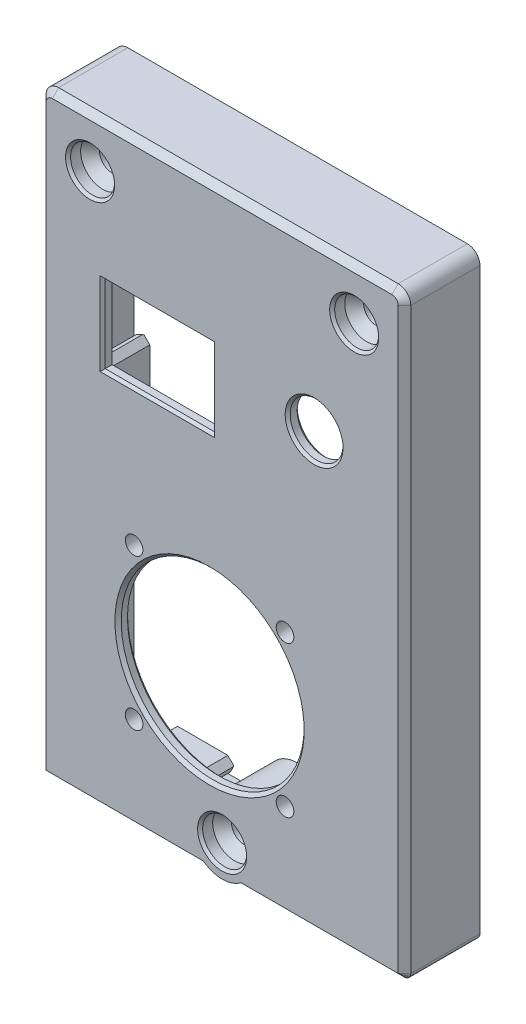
ISO-10303-21;
HEADER;
FILE_DESCRIPTION(('STEP AP214'),'2;1');
FILE_NAME('part.step','',(''),(''),'','','');
FILE_SCHEMA(('AUTOMOTIVE_DESIGN { 1 0 10303 214 1 1 1 1 }'));
ENDSEC;
DATA;
#1=APPLICATION_CONTEXT('core data for automotive mechanical design processes');
#2=APPLICATION_PROTOCOL_DEFINITION('international standard','automotive_design',2000,#1);
#3=PRODUCT_CONTEXT('',#1,'mechanical');
#4=PRODUCT('Part','Part','',(#3));
#5=PRODUCT_RELATED_PRODUCT_CATEGORY('part','',(#4));
#6=PRODUCT_DEFINITION_FORMATION('','',#4);
#7=PRODUCT_DEFINITION_CONTEXT('part definition',#1,'design');
#8=PRODUCT_DEFINITION('design','',#6,#7);
#9=PRODUCT_DEFINITION_SHAPE('','',#8);
#10=(LENGTH_UNIT() NAMED_UNIT(*) SI_UNIT(.MILLI.,.METRE.));
#11=(NAMED_UNIT(*) PLANE_ANGLE_UNIT() SI_UNIT($,.RADIAN.));
#12=(NAMED_UNIT(*) SI_UNIT($,.STERADIAN.) SOLID_ANGLE_UNIT());
#13=UNCERTAINTY_MEASURE_WITH_UNIT(LENGTH_MEASURE(1.E-05),#10,'distance_accuracy_value','');
#14=(GEOMETRIC_REPRESENTATION_CONTEXT(3) GLOBAL_UNCERTAINTY_ASSIGNED_CONTEXT((#13)) GLOBAL_UNIT_ASSIGNED_CONTEXT((#10,
#11,#12)) REPRESENTATION_CONTEXT('',''));
#15=CARTESIAN_POINT('',(0.,0.,0.));
#16=DIRECTION('',(0.,0.,1.));
#17=DIRECTION('',(1.,0.,0.));
#18=AXIS2_PLACEMENT_3D('',#15,#16,#17);
#19=CARTESIAN_POINT('',(0.,-6.65000000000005,34.1));
#20=DIRECTION('',(0.,-0.707106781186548,-0.707106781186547));
#21=DIRECTION('',(0.,0.707106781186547,-0.707106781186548));
#22=AXIS2_PLACEMENT_3D('',#19,#20,#21);
#23=PLANE('',#22);
#24=DIRECTION('',(0.,0.707106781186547,-0.707106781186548));
#25=VECTOR('',#24,1.);
#26=CARTESIAN_POINT('',(-2.33809602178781,-7.25000000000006,34.7));
#27=LINE('',#26,#25);
#28=CARTESIAN_POINT('',(-2.33809602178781,-7.25000000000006,34.7));
#29=VERTEX_POINT('',#28);
#30=CARTESIAN_POINT('',(-2.33809602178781,-6.75000000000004,34.2));
#31=VERTEX_POINT('',#30);
#32=EDGE_CURVE('E873',#29,#31,#27,.T.);
#33=ORIENTED_EDGE('',*,*,#32,.T.);
#34=DIRECTION('',(0.577350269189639,0.577350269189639,-0.577350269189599));
#35=VECTOR('',#34,1.);
#36=CARTESIAN_POINT('',(-2.33809602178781,-6.75000000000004,34.2));
#37=LINE('',#36,#35);
#38=CARTESIAN_POINT('',(-2.23809602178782,-6.65000000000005,34.1));
#39=VERTEX_POINT('',#38);
#40=EDGE_CURVE('E1037',#31,#39,#37,.T.);
#41=ORIENTED_EDGE('',*,*,#40,.T.);
#42=DIRECTION('',(-1.,0.,0.));
#43=VECTOR('',#42,1.);
#44=CARTESIAN_POINT('',(0.,-6.65000000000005,34.1));
#45=LINE('',#44,#43);
#46=CARTESIAN_POINT('',(7.5619039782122,-6.65000000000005,34.1));
#47=VERTEX_POINT('',#46);
#48=EDGE_CURVE('E1041',#47,#39,#45,.T.);
#49=ORIENTED_EDGE('',*,*,#48,.F.);
#50=DIRECTION('',(0.577350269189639,-0.577350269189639,0.577350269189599));
#51=VECTOR('',#50,1.);
#52=CARTESIAN_POINT('',(7.5619039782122,-6.65000000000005,34.1));
#53=LINE('',#52,#51);
#54=CARTESIAN_POINT('',(7.66190397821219,-6.75000000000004,34.2));
#55=VERTEX_POINT('',#54);
#56=EDGE_CURVE('E1047',#47,#55,#53,.T.);
#57=ORIENTED_EDGE('',*,*,#56,.T.);
#58=DIRECTION('',(0.,-0.707106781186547,0.707106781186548));
#59=VECTOR('',#58,1.);
#60=CARTESIAN_POINT('',(7.66190397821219,-6.75000000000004,34.2));
#61=LINE('',#60,#59);
#62=CARTESIAN_POINT('',(7.66190397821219,-7.25000000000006,34.7));
#63=VERTEX_POINT('',#62);
#64=EDGE_CURVE('E876',#55,#63,#61,.T.);
#65=ORIENTED_EDGE('',*,*,#64,.T.);
#66=DIRECTION('',(-1.,0.,0.));
#67=VECTOR('',#66,1.);
#68=CARTESIAN_POINT('',(-2.33809602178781,-7.25000000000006,34.7));
#69=LINE('',#68,#67);
#70=EDGE_CURVE('E842',#63,#29,#69,.T.);
#71=ORIENTED_EDGE('',*,*,#70,.T.);
#72=EDGE_LOOP('',(#33,#41,#49,#57,#65,#71));
#73=FACE_BOUND('',#72,.T.);
#74=ADVANCED_FACE('F17',(#73),#23,.T.);
#75=CARTESIAN_POINT('',(-6.65000000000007,0.,34.1));
#76=DIRECTION('',(0.707106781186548,0.,0.707106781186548));
#77=DIRECTION('',(0.707106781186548,0.,-0.707106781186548));
#78=AXIS2_PLACEMENT_3D('',#75,#76,#77);
#79=PLANE('',#78);
#80=DIRECTION('',(-0.577350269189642,-0.577350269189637,0.577350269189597));
#81=VECTOR('',#80,1.);
#82=CARTESIAN_POINT('',(-6.65000000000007,20.6772357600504,34.1));
#83=LINE('',#82,#81);
#84=CARTESIAN_POINT('',(-6.65000000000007,20.6772357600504,34.1));
#85=VERTEX_POINT('',#84);
#86=CARTESIAN_POINT('',(-6.75000000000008,20.5772357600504,34.2));
#87=VERTEX_POINT('',#86);
#88=EDGE_CURVE('E1023',#85,#87,#83,.T.);
#89=ORIENTED_EDGE('',*,*,#88,.T.);
#90=DIRECTION('',(-0.707106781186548,0.,0.707106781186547));
#91=VECTOR('',#90,1.);
#92=CARTESIAN_POINT('',(-6.75000000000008,20.5772357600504,34.2));
#93=LINE('',#92,#91);
#94=CARTESIAN_POINT('',(-7.25000000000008,20.5772357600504,34.7));
#95=VERTEX_POINT('',#94);
#96=EDGE_CURVE('E993',#87,#95,#93,.T.);
#97=ORIENTED_EDGE('',*,*,#96,.T.);
#98=DIRECTION('',(0.,1.,0.));
#99=VECTOR('',#98,1.);
#100=CARTESIAN_POINT('',(-7.25000000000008,45.5772357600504,34.7));
#101=LINE('',#100,#99);
#102=CARTESIAN_POINT('',(-7.25000000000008,45.5772357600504,34.7));
#103=VERTEX_POINT('',#102);
#104=EDGE_CURVE('E813',#95,#103,#101,.T.);
#105=ORIENTED_EDGE('',*,*,#104,.T.);
#106=DIRECTION('',(0.707106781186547,0.,-0.707106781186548));
#107=VECTOR('',#106,1.);
#108=CARTESIAN_POINT('',(-7.25000000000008,45.5772357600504,34.7));
#109=LINE('',#108,#107);
#110=CARTESIAN_POINT('',(-6.75000000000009,45.5772357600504,34.2));
#111=VERTEX_POINT('',#110);
#112=EDGE_CURVE('E985',#103,#111,#109,.T.);
#113=ORIENTED_EDGE('',*,*,#112,.T.);
#114=DIRECTION('',(0.577350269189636,-0.577350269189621,-0.577350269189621));
#115=VECTOR('',#114,1.);
#116=CARTESIAN_POINT('',(-6.75000000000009,45.5772357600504,34.2));
#117=LINE('',#116,#115);
#118=CARTESIAN_POINT('',(-6.65000000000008,45.4772357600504,34.1));
#119=VERTEX_POINT('',#118);
#120=EDGE_CURVE('E1201',#111,#119,#117,.T.);
#121=ORIENTED_EDGE('',*,*,#120,.T.);
#122=DIRECTION('',(0.,1.,0.));
#123=VECTOR('',#122,1.);
#124=CARTESIAN_POINT('',(-6.65000000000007,0.,34.1));
#125=LINE('',#124,#123);
#126=EDGE_CURVE('E1026',#119,#85,#125,.F.);
#127=ORIENTED_EDGE('',*,*,#126,.T.);
#128=EDGE_LOOP('',(#89,#97,#105,#113,#121,#127));
#129=FACE_BOUND('',#128,.T.);
#130=ADVANCED_FACE('F2484',(#129),#79,.F.);
#131=CARTESIAN_POINT('',(0.,81.1499999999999,34.1));
#132=DIRECTION('',(0.,0.707106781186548,-0.707106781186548));
#133=DIRECTION('',(0.,0.707106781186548,0.707106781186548));
#134=AXIS2_PLACEMENT_3D('',#131,#132,#133);
#135=PLANE('',#134);
#136=DIRECTION('',(0.,-0.707106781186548,-0.707106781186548));
#137=VECTOR('',#136,1.);
#138=CARTESIAN_POINT('',(29.5606123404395,81.7499999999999,34.7));
#139=LINE('',#138,#137);
#140=CARTESIAN_POINT('',(29.5606123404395,81.7499999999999,34.7));
#141=VERTEX_POINT('',#140);
#142=CARTESIAN_POINT('',(29.5606123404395,81.25,34.2));
#143=VERTEX_POINT('',#142);
#144=EDGE_CURVE('E926',#141,#143,#139,.T.);
#145=ORIENTED_EDGE('',*,*,#144,.T.);
#146=DIRECTION('',(-0.577350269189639,-0.577350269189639,-0.577350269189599));
#147=VECTOR('',#146,1.);
#148=CARTESIAN_POINT('',(29.5606123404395,81.25,34.2));
#149=LINE('',#148,#147);
#150=CARTESIAN_POINT('',(29.4606123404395,81.1499999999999,34.1));
#151=VERTEX_POINT('',#150);
#152=EDGE_CURVE('E1159',#143,#151,#149,.T.);
#153=ORIENTED_EDGE('',*,*,#152,.T.);
#154=DIRECTION('',(-1.,0.,0.));
#155=VECTOR('',#154,1.);
#156=CARTESIAN_POINT('',(0.,81.1499999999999,34.1));
#157=LINE('',#156,#155);
#158=CARTESIAN_POINT('',(7.66061234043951,81.1499999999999,34.1));
#159=VERTEX_POINT('',#158);
#160=EDGE_CURVE('E1163',#159,#151,#157,.F.);
#161=ORIENTED_EDGE('',*,*,#160,.F.);
#162=DIRECTION('',(-0.577350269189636,0.577350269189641,0.577350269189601));
#163=VECTOR('',#162,1.);
#164=CARTESIAN_POINT('',(7.66061234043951,81.1499999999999,34.1));
#165=LINE('',#164,#163);
#166=CARTESIAN_POINT('',(7.56061234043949,81.25,34.2));
#167=VERTEX_POINT('',#166);
#168=EDGE_CURVE('E1169',#159,#167,#165,.T.);
#169=ORIENTED_EDGE('',*,*,#168,.T.);
#170=DIRECTION('',(0.,0.707106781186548,0.707106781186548));
#171=VECTOR('',#170,1.);
#172=CARTESIAN_POINT('',(7.56061234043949,81.25,34.2));
#173=LINE('',#172,#171);
#174=CARTESIAN_POINT('',(7.5606123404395,81.7499999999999,34.7));
#175=VERTEX_POINT('',#174);
#176=EDGE_CURVE('E929',#167,#175,#173,.T.);
#177=ORIENTED_EDGE('',*,*,#176,.T.);
#178=DIRECTION('',(1.,0.,0.));
#179=VECTOR('',#178,1.);
#180=CARTESIAN_POINT('',(29.5606123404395,81.7499999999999,34.7));
#181=LINE('',#180,#179);
#182=EDGE_CURVE('E801',#175,#141,#181,.T.);
#183=ORIENTED_EDGE('',*,*,#182,.T.);
#184=EDGE_LOOP('',(#145,#153,#161,#169,#177,#183));
#185=FACE_BOUND('',#184,.T.);
#186=ADVANCED_FACE('F1375',(#185),#135,.T.);
#187=CARTESIAN_POINT('',(44.1499999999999,0.,34.1));
#188=DIRECTION('',(-0.707106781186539,0.,0.707106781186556));
#189=DIRECTION('',(0.707106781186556,0.,0.707106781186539));
#190=AXIS2_PLACEMENT_3D('',#187,#188,#189);
#191=PLANE('',#190);
#192=DIRECTION('',(0.577350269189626,0.577350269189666,0.577350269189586));
#193=VECTOR('',#192,1.);
#194=CARTESIAN_POINT('',(44.1499999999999,44.5572398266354,34.1));
#195=LINE('',#194,#193);
#196=CARTESIAN_POINT('',(44.1499999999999,44.5572398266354,34.1));
#197=VERTEX_POINT('',#196);
#198=CARTESIAN_POINT('',(44.2499999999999,44.6572398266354,34.2));
#199=VERTEX_POINT('',#198);
#200=EDGE_CURVE('E1132',#197,#199,#195,.T.);
#201=ORIENTED_EDGE('',*,*,#200,.T.);
#202=DIRECTION('',(0.707106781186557,0.,0.707106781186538));
#203=VECTOR('',#202,1.);
#204=CARTESIAN_POINT('',(44.2499999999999,44.6572398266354,34.2));
#205=LINE('',#204,#203);
#206=CARTESIAN_POINT('',(44.7499999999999,44.6572398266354,34.7));
#207=VERTEX_POINT('',#206);
#208=EDGE_CURVE('E916',#199,#207,#205,.T.);
#209=ORIENTED_EDGE('',*,*,#208,.T.);
#210=DIRECTION('',(0.,1.,0.));
#211=VECTOR('',#210,1.);
#212=CARTESIAN_POINT('',(44.7499999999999,19.6572398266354,34.7));
#213=LINE('',#212,#211);
#214=CARTESIAN_POINT('',(44.7499999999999,19.6572398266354,34.7));
#215=VERTEX_POINT('',#214);
#216=EDGE_CURVE('E786',#207,#215,#213,.F.);
#217=ORIENTED_EDGE('',*,*,#216,.T.);
#218=DIRECTION('',(-0.707106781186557,0.,-0.707106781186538));
#219=VECTOR('',#218,1.);
#220=CARTESIAN_POINT('',(44.7499999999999,19.6572398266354,34.7));
#221=LINE('',#220,#219);
#222=CARTESIAN_POINT('',(44.2499999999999,19.6572398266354,34.2));
#223=VERTEX_POINT('',#222);
#224=EDGE_CURVE('E913',#215,#223,#221,.T.);
#225=ORIENTED_EDGE('',*,*,#224,.T.);
#226=DIRECTION('',(-0.577350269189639,0.577350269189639,-0.577350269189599));
#227=VECTOR('',#226,1.);
#228=CARTESIAN_POINT('',(44.2499999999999,19.6572398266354,34.2));
#229=LINE('',#228,#227);
#230=CARTESIAN_POINT('',(44.1499999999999,19.7572398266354,34.1));
#231=VERTEX_POINT('',#230);
#232=EDGE_CURVE('E1119',#223,#231,#229,.T.);
#233=ORIENTED_EDGE('',*,*,#232,.T.);
#234=DIRECTION('',(0.,1.,0.));
#235=VECTOR('',#234,1.);
#236=CARTESIAN_POINT('',(44.1499999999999,0.,34.1));
#237=LINE('',#236,#235);
#238=EDGE_CURVE('E1128',#231,#197,#237,.T.);
#239=ORIENTED_EDGE('',*,*,#238,.T.);
#240=EDGE_LOOP('',(#201,#209,#217,#225,#233,#239));
#241=FACE_BOUND('',#240,.T.);
#242=ADVANCED_FACE('F2467',(#241),#191,.F.);
#243=CARTESIAN_POINT('',(0.,-6.65000000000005,34.1));
#244=DIRECTION('',(0.,-0.707106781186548,-0.707106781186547));
#245=DIRECTION('',(0.,0.707106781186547,-0.707106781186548));
#246=AXIS2_PLACEMENT_3D('',#243,#244,#245);
#247=PLANE('',#246);
#248=DIRECTION('',(0.,0.707106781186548,-0.707106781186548));
#249=VECTOR('',#248,1.);
#250=CARTESIAN_POINT('',(30.7601905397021,-7.25000000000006,34.7));
#251=LINE('',#250,#249);
#252=CARTESIAN_POINT('',(30.7601905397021,-7.25000000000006,34.7));
#253=VERTEX_POINT('',#252);
#254=CARTESIAN_POINT('',(30.7601905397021,-6.75000000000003,34.2));
#255=VERTEX_POINT('',#254);
#256=EDGE_CURVE('E886',#253,#255,#251,.T.);
#257=ORIENTED_EDGE('',*,*,#256,.T.);
#258=DIRECTION('',(0.577350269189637,0.577350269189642,-0.577350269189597));
#259=VECTOR('',#258,1.);
#260=CARTESIAN_POINT('',(30.7601905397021,-6.75000000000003,34.2));
#261=LINE('',#260,#259);
#262=CARTESIAN_POINT('',(30.8601905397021,-6.65000000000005,34.1));
#263=VERTEX_POINT('',#262);
#264=EDGE_CURVE('E1078',#255,#263,#261,.T.);
#265=ORIENTED_EDGE('',*,*,#264,.T.);
#266=DIRECTION('',(-1.,0.,0.));
#267=VECTOR('',#266,1.);
#268=CARTESIAN_POINT('',(0.,-6.65000000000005,34.1));
#269=LINE('',#268,#267);
#270=CARTESIAN_POINT('',(40.6601905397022,-6.65000000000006,34.1));
#271=VERTEX_POINT('',#270);
#272=EDGE_CURVE('E1082',#271,#263,#269,.T.);
#273=ORIENTED_EDGE('',*,*,#272,.F.);
#274=DIRECTION('',(0.577350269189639,-0.577350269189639,0.577350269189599));
#275=VECTOR('',#274,1.);
#276=CARTESIAN_POINT('',(40.6601905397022,-6.65000000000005,34.1));
#277=LINE('',#276,#275);
#278=CARTESIAN_POINT('',(40.7601905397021,-6.75000000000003,34.2));
#279=VERTEX_POINT('',#278);
#280=EDGE_CURVE('E1088',#271,#279,#277,.T.);
#281=ORIENTED_EDGE('',*,*,#280,.T.);
#282=DIRECTION('',(0.,-0.707106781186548,0.707106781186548));
#283=VECTOR('',#282,1.);
#284=CARTESIAN_POINT('',(40.7601905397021,-6.75000000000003,34.2));
#285=LINE('',#284,#283);
#286=CARTESIAN_POINT('',(40.7601905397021,-7.25000000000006,34.7));
#287=VERTEX_POINT('',#286);
#288=EDGE_CURVE('E890',#279,#287,#285,.T.);
#289=ORIENTED_EDGE('',*,*,#288,.T.);
#290=DIRECTION('',(-1.,0.,0.));
#291=VECTOR('',#290,1.);
#292=CARTESIAN_POINT('',(30.7601905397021,-7.25000000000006,34.7));
#293=LINE('',#292,#291);
#294=EDGE_CURVE('E751',#287,#253,#293,.T.);
#295=ORIENTED_EDGE('',*,*,#294,.T.);
#296=EDGE_LOOP('',(#257,#265,#273,#281,#289,#295));
#297=FACE_BOUND('',#296,.T.);
#298=ADVANCED_FACE('F2458',(#297),#247,.T.);
#299=CARTESIAN_POINT('',(-5.75000000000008,44.5772357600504,34.1));
#300=DIRECTION('',(-0.707106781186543,-0.707106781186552,0.));
#301=DIRECTION('',(0.707106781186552,-0.707106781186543,0.));
#302=AXIS2_PLACEMENT_3D('',#299,#300,#301);
#303=PLANE('',#302);
#304=DIRECTION('',(0.,0.,-1.));
#305=VECTOR('',#304,1.);
#306=CARTESIAN_POINT('',(-6.75000000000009,45.5772357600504,34.1));
#307=LINE('',#306,#305);
#308=CARTESIAN_POINT('',(-6.75000000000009,45.5772357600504,45.1));
#309=VERTEX_POINT('',#308);
#310=EDGE_CURVE('E933',#111,#309,#307,.F.);
#311=ORIENTED_EDGE('',*,*,#310,.T.);
#312=DIRECTION('',(0.707106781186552,-0.707106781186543,0.));
#313=VECTOR('',#312,1.);
#314=CARTESIAN_POINT('',(-5.75000000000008,44.5772357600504,45.1));
#315=LINE('',#314,#313);
#316=CARTESIAN_POINT('',(-5.75000000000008,44.5772357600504,45.1));
#317=VERTEX_POINT('',#316);
#318=EDGE_CURVE('E1199',#317,#309,#315,.F.);
#319=ORIENTED_EDGE('',*,*,#318,.F.);
#320=DIRECTION('',(0.,0.,1.));
#321=VECTOR('',#320,1.);
#322=CARTESIAN_POINT('',(-5.75000000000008,44.5772357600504,34.1));
#323=LINE('',#322,#321);
#324=CARTESIAN_POINT('',(-5.75000000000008,44.5772357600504,34.1));
#325=VERTEX_POINT('',#324);
#326=EDGE_CURVE('E937',#317,#325,#323,.F.);
#327=ORIENTED_EDGE('',*,*,#326,.T.);
#328=DIRECTION('',(-0.70710678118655,0.707106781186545,0.));
#329=VECTOR('',#328,1.);
#330=CARTESIAN_POINT('',(-5.75000000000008,44.5772357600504,34.1));
#331=LINE('',#330,#329);
#332=EDGE_CURVE('E1205',#325,#119,#331,.T.);
#333=ORIENTED_EDGE('',*,*,#332,.T.);
#334=ORIENTED_EDGE('',*,*,#120,.F.);
#335=EDGE_LOOP('',(#311,#319,#327,#333,#334));
#336=FACE_BOUND('',#335,.T.);
#337=ADVANCED_FACE('F2449',(#336),#303,.F.);
#338=CARTESIAN_POINT('',(0.,0.,34.1));
#339=DIRECTION('',(0.,0.,1.));
#340=DIRECTION('',(1.,0.,0.));
#341=AXIS2_PLACEMENT_3D('',#338,#339,#340);
#342=PLANE('',#341);
#343=DIRECTION('',(-0.707106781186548,-0.707106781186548,0.));
#344=VECTOR('',#343,1.);
#345=CARTESIAN_POINT('',(-6.75000000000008,20.5772357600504,34.1));
#346=LINE('',#345,#344);
#347=CARTESIAN_POINT('',(-5.75000000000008,21.5772357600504,34.1));
#348=VERTEX_POINT('',#347);
#349=EDGE_CURVE('E987',#348,#85,#346,.T.);
#350=ORIENTED_EDGE('',*,*,#349,.T.);
#351=ORIENTED_EDGE('',*,*,#126,.F.);
#352=ORIENTED_EDGE('',*,*,#332,.F.);
#353=DIRECTION('',(0.,-1.,0.));
#354=VECTOR('',#353,1.);
#355=CARTESIAN_POINT('',(-5.75000000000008,45.5772357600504,34.1));
#356=LINE('',#355,#354);
#357=EDGE_CURVE('E1210',#325,#348,#356,.T.);
#358=ORIENTED_EDGE('',*,*,#357,.T.);
#359=EDGE_LOOP('',(#350,#351,#352,#358));
#360=FACE_BOUND('',#359,.T.);
#361=ADVANCED_FACE('F2440',(#360),#342,.F.);
#362=CARTESIAN_POINT('',(-6.75000000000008,20.5772357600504,34.1));
#363=DIRECTION('',(-0.707106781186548,0.707106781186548,0.));
#364=DIRECTION('',(-0.707106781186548,-0.707106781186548,0.));
#365=AXIS2_PLACEMENT_3D('',#362,#363,#364);
#366=PLANE('',#365);
#367=DIRECTION('',(0.,0.,1.));
#368=VECTOR('',#367,1.);
#369=CARTESIAN_POINT('',(-5.75000000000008,21.5772357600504,34.1));
#370=LINE('',#369,#368);
#371=CARTESIAN_POINT('',(-5.75000000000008,21.5772357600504,45.1));
#372=VERTEX_POINT('',#371);
#373=EDGE_CURVE('E583',#348,#372,#370,.T.);
#374=ORIENTED_EDGE('',*,*,#373,.T.);
#375=DIRECTION('',(-0.707106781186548,-0.707106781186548,0.));
#376=VECTOR('',#375,1.);
#377=CARTESIAN_POINT('',(-6.75000000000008,20.5772357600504,45.1));
#378=LINE('',#377,#376);
#379=CARTESIAN_POINT('',(-6.75000000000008,20.5772357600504,45.1));
#380=VERTEX_POINT('',#379);
#381=EDGE_CURVE('E1025',#380,#372,#378,.F.);
#382=ORIENTED_EDGE('',*,*,#381,.F.);
#383=DIRECTION('',(0.,0.,1.));
#384=VECTOR('',#383,1.);
#385=CARTESIAN_POINT('',(-6.75000000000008,20.5772357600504,34.1));
#386=LINE('',#385,#384);
#387=EDGE_CURVE('E850',#380,#87,#386,.F.);
#388=ORIENTED_EDGE('',*,*,#387,.T.);
#389=ORIENTED_EDGE('',*,*,#88,.F.);
#390=ORIENTED_EDGE('',*,*,#349,.F.);
#391=EDGE_LOOP('',(#374,#382,#388,#389,#390));
#392=FACE_BOUND('',#391,.T.);
#393=ADVANCED_FACE('F2431',(#392),#366,.F.);
#394=CARTESIAN_POINT('',(-7.25000000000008,45.5772357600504,34.1));
#395=DIRECTION('',(0.,-1.,0.));
#396=DIRECTION('',(0.,0.,-1.));
#397=AXIS2_PLACEMENT_3D('',#394,#395,#396);
#398=PLANE('',#397);
#399=ORIENTED_EDGE('',*,*,#310,.F.);
#400=ORIENTED_EDGE('',*,*,#112,.F.);
#401=DIRECTION('',(0.,0.,-1.));
#402=VECTOR('',#401,1.);
#403=CARTESIAN_POINT('',(-7.25000000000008,45.5772357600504,34.1));
#404=LINE('',#403,#402);
#405=CARTESIAN_POINT('',(-7.25000000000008,45.5772357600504,35.1));
#406=VERTEX_POINT('',#405);
#407=EDGE_CURVE('E807',#103,#406,#404,.F.);
#408=ORIENTED_EDGE('',*,*,#407,.T.);
#409=DIRECTION('',(0.,0.,1.));
#410=VECTOR('',#409,1.);
#411=CARTESIAN_POINT('',(-7.25000000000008,45.5772357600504,45.1));
#412=LINE('',#411,#410);
#413=CARTESIAN_POINT('',(-7.25000000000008,45.5772357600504,45.1));
#414=VERTEX_POINT('',#413);
#415=EDGE_CURVE('E582',#406,#414,#412,.T.);
#416=ORIENTED_EDGE('',*,*,#415,.T.);
#417=DIRECTION('',(1.,0.,0.));
#418=VECTOR('',#417,1.);
#419=CARTESIAN_POINT('',(-7.25000000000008,45.5772357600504,45.1));
#420=LINE('',#419,#418);
#421=EDGE_CURVE('E473',#309,#414,#420,.F.);
#422=ORIENTED_EDGE('',*,*,#421,.F.);
#423=EDGE_LOOP('',(#399,#400,#408,#416,#422));
#424=FACE_BOUND('',#423,.T.);
#425=ADVANCED_FACE('F1402',(#424),#398,.F.);
#426=CARTESIAN_POINT('',(-6.75000000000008,73.5877223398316,20.9578643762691));
#427=DIRECTION('',(0.,0.,1.));
#428=DIRECTION('',(1.,0.,0.));
#429=AXIS2_PLACEMENT_3D('',#426,#427,#428);
#430=CYLINDRICAL_SURFACE('',#429,0.5);
#431=DIRECTION('',(0.,0.,1.));
#432=VECTOR('',#431,1.);
#433=CARTESIAN_POINT('',(-6.34090909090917,73.8752021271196,20.9578643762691));
#434=LINE('',#433,#432);
#435=CARTESIAN_POINT('',(-6.34090909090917,73.8752021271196,45.1));
#436=VERTEX_POINT('',#435);
#437=CARTESIAN_POINT('',(-6.34090909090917,73.8752021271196,35.1));
#438=VERTEX_POINT('',#437);
#439=EDGE_CURVE('E475',#436,#438,#434,.F.);
#440=ORIENTED_EDGE('',*,*,#439,.F.);
#441=CARTESIAN_POINT('',(-6.75000000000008,73.5877223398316,45.1));
#442=DIRECTION('',(0.,0.,1.));
#443=DIRECTION('',(1.,0.,0.));
#444=AXIS2_PLACEMENT_3D('',#441,#442,#443);
#445=CIRCLE('',#444,0.5);
#446=CARTESIAN_POINT('',(-7.25000000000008,73.5877223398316,45.1));
#447=VERTEX_POINT('',#446);
#448=EDGE_CURVE('E20',#447,#436,#445,.F.);
#449=ORIENTED_EDGE('',*,*,#448,.F.);
#450=DIRECTION('',(0.,0.,1.));
#451=VECTOR('',#450,1.);
#452=CARTESIAN_POINT('',(-7.25000000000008,73.5877223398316,45.1));
#453=LINE('',#452,#451);
#454=CARTESIAN_POINT('',(-7.25000000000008,73.5877223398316,35.1));
#455=VERTEX_POINT('',#454);
#456=EDGE_CURVE('E580',#447,#455,#453,.F.);
#457=ORIENTED_EDGE('',*,*,#456,.T.);
#458=CARTESIAN_POINT('',(-6.75000000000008,73.5877223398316,35.1));
#459=DIRECTION('',(0.,0.,1.));
#460=DIRECTION('',(1.,0.,0.));
#461=AXIS2_PLACEMENT_3D('',#458,#459,#460);
#462=CIRCLE('',#461,0.5);
#463=EDGE_CURVE('E472',#438,#455,#462,.T.);
#464=ORIENTED_EDGE('',*,*,#463,.F.);
#465=EDGE_LOOP('',(#440,#449,#457,#464));
#466=FACE_BOUND('',#465,.T.);
#467=ADVANCED_FACE('F476',(#466),#430,.F.);
#468=CARTESIAN_POINT('',(0.912277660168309,81.2499999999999,20.9578643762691));
#469=DIRECTION('',(0.,0.,1.));
#470=DIRECTION('',(1.,0.,0.));
#471=AXIS2_PLACEMENT_3D('',#468,#469,#470);
#472=CYLINDRICAL_SURFACE('',#471,0.5);
#473=DIRECTION('',(0.,0.,1.));
#474=VECTOR('',#473,1.);
#475=CARTESIAN_POINT('',(0.912277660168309,81.7499999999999,45.1));
#476=LINE('',#475,#474);
#477=CARTESIAN_POINT('',(0.91227766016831,81.7499999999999,35.1));
#478=VERTEX_POINT('',#477);
#479=CARTESIAN_POINT('',(0.912277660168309,81.7499999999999,45.1));
#480=VERTEX_POINT('',#479);
#481=EDGE_CURVE('E480',#478,#480,#476,.T.);
#482=ORIENTED_EDGE('',*,*,#481,.T.);
#483=CARTESIAN_POINT('',(0.912277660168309,81.2499999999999,45.1));
#484=DIRECTION('',(0.,0.,1.));
#485=DIRECTION('',(1.,0.,0.));
#486=AXIS2_PLACEMENT_3D('',#483,#484,#485);
#487=CIRCLE('',#486,0.5);
#488=CARTESIAN_POINT('',(0.624797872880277,80.840909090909,45.1));
#489=VERTEX_POINT('',#488);
#490=EDGE_CURVE('E573',#489,#480,#487,.F.);
#491=ORIENTED_EDGE('',*,*,#490,.F.);
#492=DIRECTION('',(0.,0.,1.));
#493=VECTOR('',#492,1.);
#494=CARTESIAN_POINT('',(0.62479787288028,80.840909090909,20.9578643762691));
#495=LINE('',#494,#493);
#496=CARTESIAN_POINT('',(0.624797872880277,80.840909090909,35.1));
#497=VERTEX_POINT('',#496);
#498=EDGE_CURVE('E481',#497,#489,#495,.T.);
#499=ORIENTED_EDGE('',*,*,#498,.F.);
#500=CARTESIAN_POINT('',(0.912277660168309,81.2499999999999,35.1));
#501=DIRECTION('',(0.,0.,1.));
#502=DIRECTION('',(1.,0.,0.));
#503=AXIS2_PLACEMENT_3D('',#500,#501,#502);
#504=CIRCLE('',#503,0.5);
#505=EDGE_CURVE('E570',#478,#497,#504,.T.);
#506=ORIENTED_EDGE('',*,*,#505,.F.);
#507=EDGE_LOOP('',(#482,#491,#499,#506));
#508=FACE_BOUND('',#507,.T.);
#509=ADVANCED_FACE('F1393',(#508),#472,.F.);
#510=CARTESIAN_POINT('',(7.56061234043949,81.7499999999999,34.1));
#511=DIRECTION('',(1.,0.,0.));
#512=DIRECTION('',(0.,0.,-1.));
#513=AXIS2_PLACEMENT_3D('',#510,#511,#512);
#514=PLANE('',#513);
#515=DIRECTION('',(0.,0.,1.));
#516=VECTOR('',#515,1.);
#517=CARTESIAN_POINT('',(7.56061234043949,81.25,34.1));
#518=LINE('',#517,#516);
#519=CARTESIAN_POINT('',(7.56061234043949,81.25,45.1));
#520=VERTEX_POINT('',#519);
#521=EDGE_CURVE('E1185',#167,#520,#518,.T.);
#522=ORIENTED_EDGE('',*,*,#521,.T.);
#523=DIRECTION('',(0.,1.,0.));
#524=VECTOR('',#523,1.);
#525=CARTESIAN_POINT('',(7.56061234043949,81.7499999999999,45.1));
#526=LINE('',#525,#524);
#527=CARTESIAN_POINT('',(7.56061234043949,81.7499999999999,45.1));
#528=VERTEX_POINT('',#527);
#529=EDGE_CURVE('E572',#528,#520,#526,.F.);
#530=ORIENTED_EDGE('',*,*,#529,.F.);
#531=DIRECTION('',(0.,0.,1.));
#532=VECTOR('',#531,1.);
#533=CARTESIAN_POINT('',(7.56061234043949,81.7499999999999,45.1));
#534=LINE('',#533,#532);
#535=CARTESIAN_POINT('',(7.5606123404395,81.7499999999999,35.1));
#536=VERTEX_POINT('',#535);
#537=EDGE_CURVE('E730',#528,#536,#534,.F.);
#538=ORIENTED_EDGE('',*,*,#537,.T.);
#539=DIRECTION('',(0.,0.,-1.));
#540=VECTOR('',#539,1.);
#541=CARTESIAN_POINT('',(7.5606123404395,81.7499999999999,34.1));
#542=LINE('',#541,#540);
#543=EDGE_CURVE('E804',#536,#175,#542,.T.);
#544=ORIENTED_EDGE('',*,*,#543,.T.);
#545=ORIENTED_EDGE('',*,*,#176,.F.);
#546=EDGE_LOOP('',(#522,#530,#538,#544,#545));
#547=FACE_BOUND('',#546,.T.);
#548=ADVANCED_FACE('F1387',(#547),#514,.F.);
#549=CARTESIAN_POINT('',(28.5606123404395,80.2499999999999,34.1));
#550=DIRECTION('',(-0.707106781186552,0.707106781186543,0.));
#551=DIRECTION('',(-0.707106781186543,-0.707106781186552,0.));
#552=AXIS2_PLACEMENT_3D('',#549,#550,#551);
#553=PLANE('',#552);
#554=DIRECTION('',(0.,0.,1.));
#555=VECTOR('',#554,1.);
#556=CARTESIAN_POINT('',(29.5606123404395,81.25,34.1));
#557=LINE('',#556,#555);
#558=CARTESIAN_POINT('',(29.5606123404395,81.25,45.1));
#559=VERTEX_POINT('',#558);
#560=EDGE_CURVE('E920',#143,#559,#557,.T.);
#561=ORIENTED_EDGE('',*,*,#560,.T.);
#562=DIRECTION('',(-0.707106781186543,-0.707106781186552,0.));
#563=VECTOR('',#562,1.);
#564=CARTESIAN_POINT('',(28.5606123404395,80.2499999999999,45.1));
#565=LINE('',#564,#563);
#566=CARTESIAN_POINT('',(28.5606123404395,80.2499999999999,45.1));
#567=VERTEX_POINT('',#566);
#568=EDGE_CURVE('E982',#567,#559,#565,.F.);
#569=ORIENTED_EDGE('',*,*,#568,.F.);
#570=DIRECTION('',(0.,0.,1.));
#571=VECTOR('',#570,1.);
#572=CARTESIAN_POINT('',(28.5606123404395,80.2499999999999,34.1));
#573=LINE('',#572,#571);
#574=CARTESIAN_POINT('',(28.5606123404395,80.25,34.1));
#575=VERTEX_POINT('',#574);
#576=EDGE_CURVE('E727',#567,#575,#573,.F.);
#577=ORIENTED_EDGE('',*,*,#576,.T.);
#578=DIRECTION('',(-0.707106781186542,-0.707106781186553,0.));
#579=VECTOR('',#578,1.);
#580=CARTESIAN_POINT('',(29.4606123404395,81.1499999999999,34.1));
#581=LINE('',#580,#579);
#582=EDGE_CURVE('E1166',#151,#575,#581,.T.);
#583=ORIENTED_EDGE('',*,*,#582,.F.);
#584=ORIENTED_EDGE('',*,*,#152,.F.);
#585=EDGE_LOOP('',(#561,#569,#577,#583,#584));
#586=FACE_BOUND('',#585,.T.);
#587=ADVANCED_FACE('F1378',(#586),#553,.F.);
#588=CARTESIAN_POINT('',(0.,0.,34.1));
#589=DIRECTION('',(0.,0.,-1.));
#590=DIRECTION('',(-1.,0.,0.));
#591=AXIS2_PLACEMENT_3D('',#588,#589,#590);
#592=PLANE('',#591);
#593=ORIENTED_EDGE('',*,*,#160,.T.);
#594=ORIENTED_EDGE('',*,*,#582,.T.);
#595=DIRECTION('',(1.,0.,0.));
#596=VECTOR('',#595,1.);
#597=CARTESIAN_POINT('',(29.5606123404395,80.2499999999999,34.1));
#598=LINE('',#597,#596);
#599=CARTESIAN_POINT('',(8.5606123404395,80.2499999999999,34.1));
#600=VERTEX_POINT('',#599);
#601=EDGE_CURVE('E725',#575,#600,#598,.F.);
#602=ORIENTED_EDGE('',*,*,#601,.T.);
#603=DIRECTION('',(-0.707106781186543,0.707106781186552,0.));
#604=VECTOR('',#603,1.);
#605=CARTESIAN_POINT('',(7.56061234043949,81.25,34.1));
#606=LINE('',#605,#604);
#607=EDGE_CURVE('E923',#600,#159,#606,.T.);
#608=ORIENTED_EDGE('',*,*,#607,.T.);
#609=EDGE_LOOP('',(#593,#594,#602,#608));
#610=FACE_BOUND('',#609,.T.);
#611=ADVANCED_FACE('F1382',(#610),#592,.T.);
#612=CARTESIAN_POINT('',(7.56061234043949,81.25,34.1));
#613=DIRECTION('',(0.707106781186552,0.707106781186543,0.));
#614=DIRECTION('',(-0.707106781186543,0.707106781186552,0.));
#615=AXIS2_PLACEMENT_3D('',#612,#613,#614);
#616=PLANE('',#615);
#617=DIRECTION('',(0.,0.,1.));
#618=VECTOR('',#617,1.);
#619=CARTESIAN_POINT('',(8.56061234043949,80.2499999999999,34.1));
#620=LINE('',#619,#618);
#621=CARTESIAN_POINT('',(8.56061234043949,80.2499999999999,45.1));
#622=VERTEX_POINT('',#621);
#623=EDGE_CURVE('E718',#600,#622,#620,.T.);
#624=ORIENTED_EDGE('',*,*,#623,.T.);
#625=DIRECTION('',(-0.707106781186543,0.707106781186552,0.));
#626=VECTOR('',#625,1.);
#627=CARTESIAN_POINT('',(7.56061234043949,81.25,45.1));
#628=LINE('',#627,#626);
#629=EDGE_CURVE('E927',#520,#622,#628,.F.);
#630=ORIENTED_EDGE('',*,*,#629,.F.);
#631=ORIENTED_EDGE('',*,*,#521,.F.);
#632=ORIENTED_EDGE('',*,*,#168,.F.);
#633=ORIENTED_EDGE('',*,*,#607,.F.);
#634=EDGE_LOOP('',(#624,#630,#631,#632,#633));
#635=FACE_BOUND('',#634,.T.);
#636=ADVANCED_FACE('F1389',(#635),#616,.F.);
#637=CARTESIAN_POINT('',(29.5606123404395,81.7499999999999,34.1));
#638=DIRECTION('',(-1.,0.,0.));
#639=DIRECTION('',(0.,-1.,0.));
#640=AXIS2_PLACEMENT_3D('',#637,#638,#639);
#641=PLANE('',#640);
#642=ORIENTED_EDGE('',*,*,#560,.F.);
#643=ORIENTED_EDGE('',*,*,#144,.F.);
#644=DIRECTION('',(0.,0.,-1.));
#645=VECTOR('',#644,1.);
#646=CARTESIAN_POINT('',(29.5606123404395,81.7499999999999,34.1));
#647=LINE('',#646,#645);
#648=CARTESIAN_POINT('',(29.5606123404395,81.7499999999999,35.1));
#649=VERTEX_POINT('',#648);
#650=EDGE_CURVE('E792',#141,#649,#647,.F.);
#651=ORIENTED_EDGE('',*,*,#650,.T.);
#652=DIRECTION('',(0.,0.,1.));
#653=VECTOR('',#652,1.);
#654=CARTESIAN_POINT('',(29.5606123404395,81.7499999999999,45.1));
#655=LINE('',#654,#653);
#656=CARTESIAN_POINT('',(29.5606123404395,81.7499999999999,45.1));
#657=VERTEX_POINT('',#656);
#658=EDGE_CURVE('E714',#649,#657,#655,.T.);
#659=ORIENTED_EDGE('',*,*,#658,.T.);
#660=DIRECTION('',(0.,-1.,0.));
#661=VECTOR('',#660,1.);
#662=CARTESIAN_POINT('',(29.5606123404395,81.7499999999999,45.1));
#663=LINE('',#662,#661);
#664=EDGE_CURVE('E569',#559,#657,#663,.F.);
#665=ORIENTED_EDGE('',*,*,#664,.F.);
#666=EDGE_LOOP('',(#642,#643,#651,#659,#665));
#667=FACE_BOUND('',#666,.T.);
#668=ADVANCED_FACE('F1371',(#667),#641,.F.);
#669=CARTESIAN_POINT('',(36.5877223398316,81.2499999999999,20.9578643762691));
#670=DIRECTION('',(0.,0.,1.));
#671=DIRECTION('',(1.,0.,0.));
#672=AXIS2_PLACEMENT_3D('',#669,#670,#671);
#673=CYLINDRICAL_SURFACE('',#672,0.5);
#674=DIRECTION('',(0.,0.,1.));
#675=VECTOR('',#674,1.);
#676=CARTESIAN_POINT('',(36.8752021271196,80.840909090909,20.9578643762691));
#677=LINE('',#676,#675);
#678=CARTESIAN_POINT('',(36.8752021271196,80.840909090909,45.1));
#679=VERTEX_POINT('',#678);
#680=CARTESIAN_POINT('',(36.8752021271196,80.840909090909,35.1));
#681=VERTEX_POINT('',#680);
#682=EDGE_CURVE('E711',#679,#681,#677,.F.);
#683=ORIENTED_EDGE('',*,*,#682,.F.);
#684=CARTESIAN_POINT('',(36.5877223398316,81.2499999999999,45.1));
#685=DIRECTION('',(0.,0.,1.));
#686=DIRECTION('',(1.,0.,0.));
#687=AXIS2_PLACEMENT_3D('',#684,#685,#686);
#688=CIRCLE('',#687,0.5);
#689=CARTESIAN_POINT('',(36.5877223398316,81.7499999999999,45.1));
#690=VERTEX_POINT('',#689);
#691=EDGE_CURVE('E567',#690,#679,#688,.F.);
#692=ORIENTED_EDGE('',*,*,#691,.F.);
#693=DIRECTION('',(0.,0.,1.));
#694=VECTOR('',#693,1.);
#695=CARTESIAN_POINT('',(36.5877223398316,81.7499999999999,45.1));
#696=LINE('',#695,#694);
#697=CARTESIAN_POINT('',(36.5877223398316,81.7499999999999,35.1));
#698=VERTEX_POINT('',#697);
#699=EDGE_CURVE('E715',#690,#698,#696,.F.);
#700=ORIENTED_EDGE('',*,*,#699,.T.);
#701=CARTESIAN_POINT('',(36.5877223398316,81.2499999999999,35.1));
#702=DIRECTION('',(0.,0.,1.));
#703=DIRECTION('',(1.,0.,0.));
#704=AXIS2_PLACEMENT_3D('',#701,#702,#703);
#705=CIRCLE('',#704,0.5);
#706=EDGE_CURVE('E565',#681,#698,#705,.T.);
#707=ORIENTED_EDGE('',*,*,#706,.F.);
#708=EDGE_LOOP('',(#683,#692,#700,#707));
#709=FACE_BOUND('',#708,.T.);
#710=ADVANCED_FACE('F1781',(#709),#673,.F.);
#711=CARTESIAN_POINT('',(44.2499999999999,73.5877223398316,20.9578643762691));
#712=DIRECTION('',(0.,0.,1.));
#713=DIRECTION('',(1.,0.,0.));
#714=AXIS2_PLACEMENT_3D('',#711,#712,#713);
#715=CYLINDRICAL_SURFACE('',#714,0.5);
#716=DIRECTION('',(0.,0.,-1.));
#717=VECTOR('',#716,1.);
#718=CARTESIAN_POINT('',(44.7499999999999,73.5877223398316,45.1));
#719=LINE('',#718,#717);
#720=CARTESIAN_POINT('',(44.7499999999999,73.5877223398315,35.1));
#721=VERTEX_POINT('',#720);
#722=CARTESIAN_POINT('',(44.7499999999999,73.5877223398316,45.1));
#723=VERTEX_POINT('',#722);
#724=EDGE_CURVE('E701',#721,#723,#719,.F.);
#725=ORIENTED_EDGE('',*,*,#724,.T.);
#726=CARTESIAN_POINT('',(44.2499999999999,73.5877223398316,45.1));
#727=DIRECTION('',(0.,0.,1.));
#728=DIRECTION('',(1.,0.,0.));
#729=AXIS2_PLACEMENT_3D('',#726,#727,#728);
#730=CIRCLE('',#729,0.5);
#731=CARTESIAN_POINT('',(43.840909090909,73.8752021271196,45.1));
#732=VERTEX_POINT('',#731);
#733=EDGE_CURVE('E563',#732,#723,#730,.F.);
#734=ORIENTED_EDGE('',*,*,#733,.F.);
#735=DIRECTION('',(0.,0.,1.));
#736=VECTOR('',#735,1.);
#737=CARTESIAN_POINT('',(43.840909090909,73.8752021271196,20.9578643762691));
#738=LINE('',#737,#736);
#739=CARTESIAN_POINT('',(43.840909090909,73.8752021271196,35.1));
#740=VERTEX_POINT('',#739);
#741=EDGE_CURVE('E705',#740,#732,#738,.T.);
#742=ORIENTED_EDGE('',*,*,#741,.F.);
#743=CARTESIAN_POINT('',(44.2499999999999,73.5877223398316,35.1));
#744=DIRECTION('',(0.,0.,1.));
#745=DIRECTION('',(1.,0.,0.));
#746=AXIS2_PLACEMENT_3D('',#743,#744,#745);
#747=CIRCLE('',#746,0.5);
#748=EDGE_CURVE('E560',#721,#740,#747,.T.);
#749=ORIENTED_EDGE('',*,*,#748,.F.);
#750=EDGE_LOOP('',(#725,#734,#742,#749));
#751=FACE_BOUND('',#750,.T.);
#752=ADVANCED_FACE('F1777',(#751),#715,.F.);
#753=CARTESIAN_POINT('',(44.7499999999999,44.6572398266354,34.1));
#754=DIRECTION('',(0.,-1.,0.));
#755=DIRECTION('',(0.,0.,-1.));
#756=AXIS2_PLACEMENT_3D('',#753,#754,#755);
#757=PLANE('',#756);
#758=DIRECTION('',(0.,0.,1.));
#759=VECTOR('',#758,1.);
#760=CARTESIAN_POINT('',(44.2499999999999,44.6572398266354,34.1));
#761=LINE('',#760,#759);
#762=CARTESIAN_POINT('',(44.2499999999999,44.6572398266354,45.1));
#763=VERTEX_POINT('',#762);
#764=EDGE_CURVE('E1144',#199,#763,#761,.T.);
#765=ORIENTED_EDGE('',*,*,#764,.T.);
#766=DIRECTION('',(1.,0.,0.));
#767=VECTOR('',#766,1.);
#768=CARTESIAN_POINT('',(44.7499999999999,44.6572398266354,45.1));
#769=LINE('',#768,#767);
#770=CARTESIAN_POINT('',(44.7499999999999,44.6572398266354,45.1));
#771=VERTEX_POINT('',#770);
#772=EDGE_CURVE('E562',#771,#763,#769,.F.);
#773=ORIENTED_EDGE('',*,*,#772,.F.);
#774=DIRECTION('',(0.,0.,-1.));
#775=VECTOR('',#774,1.);
#776=CARTESIAN_POINT('',(44.7499999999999,44.6572398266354,45.1));
#777=LINE('',#776,#775);
#778=CARTESIAN_POINT('',(44.7499999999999,44.6572398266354,35.1));
#779=VERTEX_POINT('',#778);
#780=EDGE_CURVE('E704',#771,#779,#777,.T.);
#781=ORIENTED_EDGE('',*,*,#780,.T.);
#782=DIRECTION('',(0.,0.,1.));
#783=VECTOR('',#782,1.);
#784=CARTESIAN_POINT('',(44.7499999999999,44.6572398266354,34.1));
#785=LINE('',#784,#783);
#786=EDGE_CURVE('E789',#779,#207,#785,.F.);
#787=ORIENTED_EDGE('',*,*,#786,.T.);
#788=ORIENTED_EDGE('',*,*,#208,.F.);
#789=EDGE_LOOP('',(#765,#773,#781,#787,#788));
#790=FACE_BOUND('',#789,.T.);
#791=ADVANCED_FACE('F1773',(#790),#757,.F.);
#792=CARTESIAN_POINT('',(43.2499999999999,20.6572398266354,34.1));
#793=DIRECTION('',(0.707106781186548,0.707106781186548,0.));
#794=DIRECTION('',(-0.707106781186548,0.707106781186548,0.));
#795=AXIS2_PLACEMENT_3D('',#792,#793,#794);
#796=PLANE('',#795);
#797=DIRECTION('',(0.,0.,1.));
#798=VECTOR('',#797,1.);
#799=CARTESIAN_POINT('',(44.2499999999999,19.6572398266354,34.1));
#800=LINE('',#799,#798);
#801=CARTESIAN_POINT('',(44.2499999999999,19.6572398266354,45.1));
#802=VERTEX_POINT('',#801);
#803=EDGE_CURVE('E907',#223,#802,#800,.T.);
#804=ORIENTED_EDGE('',*,*,#803,.T.);
#805=DIRECTION('',(-0.707106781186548,0.707106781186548,0.));
#806=VECTOR('',#805,1.);
#807=CARTESIAN_POINT('',(43.2499999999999,20.6572398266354,45.1));
#808=LINE('',#807,#806);
#809=CARTESIAN_POINT('',(43.2499999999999,20.6572398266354,45.1));
#810=VERTEX_POINT('',#809);
#811=EDGE_CURVE('E972',#810,#802,#808,.F.);
#812=ORIENTED_EDGE('',*,*,#811,.F.);
#813=DIRECTION('',(0.,0.,-1.));
#814=VECTOR('',#813,1.);
#815=CARTESIAN_POINT('',(43.2499999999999,20.6572398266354,34.1));
#816=LINE('',#815,#814);
#817=CARTESIAN_POINT('',(43.2499999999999,20.6572398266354,34.1));
#818=VERTEX_POINT('',#817);
#819=EDGE_CURVE('E700',#810,#818,#816,.T.);
#820=ORIENTED_EDGE('',*,*,#819,.T.);
#821=DIRECTION('',(0.707106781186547,-0.707106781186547,0.));
#822=VECTOR('',#821,1.);
#823=CARTESIAN_POINT('',(43.2499999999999,20.6572398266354,34.1));
#824=LINE('',#823,#822);
#825=EDGE_CURVE('E1123',#818,#231,#824,.T.);
#826=ORIENTED_EDGE('',*,*,#825,.T.);
#827=ORIENTED_EDGE('',*,*,#232,.F.);
#828=EDGE_LOOP('',(#804,#812,#820,#826,#827));
#829=FACE_BOUND('',#828,.T.);
#830=ADVANCED_FACE('F1769',(#829),#796,.F.);
#831=CARTESIAN_POINT('',(0.,0.,34.1));
#832=DIRECTION('',(0.,0.,1.));
#833=DIRECTION('',(1.,0.,0.));
#834=AXIS2_PLACEMENT_3D('',#831,#832,#833);
#835=PLANE('',#834);
#836=DIRECTION('',(0.707106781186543,0.707106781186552,0.));
#837=VECTOR('',#836,1.);
#838=CARTESIAN_POINT('',(44.2499999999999,44.6572398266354,34.1));
#839=LINE('',#838,#837);
#840=CARTESIAN_POINT('',(43.2499999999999,43.6572398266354,34.1));
#841=VERTEX_POINT('',#840);
#842=EDGE_CURVE('E910',#841,#197,#839,.T.);
#843=ORIENTED_EDGE('',*,*,#842,.T.);
#844=ORIENTED_EDGE('',*,*,#238,.F.);
#845=ORIENTED_EDGE('',*,*,#825,.F.);
#846=DIRECTION('',(0.,1.,0.));
#847=VECTOR('',#846,1.);
#848=CARTESIAN_POINT('',(43.2499999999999,19.6572398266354,34.1));
#849=LINE('',#848,#847);
#850=EDGE_CURVE('E698',#818,#841,#849,.T.);
#851=ORIENTED_EDGE('',*,*,#850,.T.);
#852=EDGE_LOOP('',(#843,#844,#845,#851));
#853=FACE_BOUND('',#852,.T.);
#854=ADVANCED_FACE('F1765',(#853),#835,.F.);
#855=CARTESIAN_POINT('',(44.2499999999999,44.6572398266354,34.1));
#856=DIRECTION('',(0.707106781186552,-0.707106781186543,0.));
#857=DIRECTION('',(0.707106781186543,0.707106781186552,0.));
#858=AXIS2_PLACEMENT_3D('',#855,#856,#857);
#859=PLANE('',#858);
#860=DIRECTION('',(0.,0.,-1.));
#861=VECTOR('',#860,1.);
#862=CARTESIAN_POINT('',(43.2499999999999,43.6572398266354,34.1));
#863=LINE('',#862,#861);
#864=CARTESIAN_POINT('',(43.2499999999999,43.6572398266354,45.1));
#865=VERTEX_POINT('',#864);
#866=EDGE_CURVE('E694',#841,#865,#863,.F.);
#867=ORIENTED_EDGE('',*,*,#866,.T.);
#868=DIRECTION('',(0.707106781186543,0.707106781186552,0.));
#869=VECTOR('',#868,1.);
#870=CARTESIAN_POINT('',(44.2499999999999,44.6572398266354,45.1));
#871=LINE('',#870,#869);
#872=EDGE_CURVE('E914',#763,#865,#871,.F.);
#873=ORIENTED_EDGE('',*,*,#872,.F.);
#874=ORIENTED_EDGE('',*,*,#764,.F.);
#875=ORIENTED_EDGE('',*,*,#200,.F.);
#876=ORIENTED_EDGE('',*,*,#842,.F.);
#877=EDGE_LOOP('',(#867,#873,#874,#875,#876));
#878=FACE_BOUND('',#877,.T.);
#879=ADVANCED_FACE('F1761',(#878),#859,.F.);
#880=CARTESIAN_POINT('',(44.7499999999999,19.6572398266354,34.1));
#881=DIRECTION('',(0.,1.,0.));
#882=DIRECTION('',(0.,0.,1.));
#883=AXIS2_PLACEMENT_3D('',#880,#881,#882);
#884=PLANE('',#883);
#885=ORIENTED_EDGE('',*,*,#803,.F.);
#886=ORIENTED_EDGE('',*,*,#224,.F.);
#887=DIRECTION('',(0.,0.,1.));
#888=VECTOR('',#887,1.);
#889=CARTESIAN_POINT('',(44.7499999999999,19.6572398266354,34.1));
#890=LINE('',#889,#888);
#891=CARTESIAN_POINT('',(44.7499999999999,19.6572398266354,35.1));
#892=VERTEX_POINT('',#891);
#893=EDGE_CURVE('E757',#215,#892,#890,.T.);
#894=ORIENTED_EDGE('',*,*,#893,.T.);
#895=DIRECTION('',(0.,0.,-1.));
#896=VECTOR('',#895,1.);
#897=CARTESIAN_POINT('',(44.7499999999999,19.6572398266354,45.1));
#898=LINE('',#897,#896);
#899=CARTESIAN_POINT('',(44.7499999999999,19.6572398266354,45.1));
#900=VERTEX_POINT('',#899);
#901=EDGE_CURVE('E697',#892,#900,#898,.F.);
#902=ORIENTED_EDGE('',*,*,#901,.T.);
#903=DIRECTION('',(1.,0.,0.));
#904=VECTOR('',#903,1.);
#905=CARTESIAN_POINT('',(44.7499999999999,19.6572398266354,45.1));
#906=LINE('',#905,#904);
#907=EDGE_CURVE('E891',#802,#900,#906,.T.);
#908=ORIENTED_EDGE('',*,*,#907,.F.);
#909=EDGE_LOOP('',(#885,#886,#894,#902,#908));
#910=FACE_BOUND('',#909,.T.);
#911=ADVANCED_FACE('F1757',(#910),#884,.F.);
#912=CARTESIAN_POINT('',(40.7601905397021,-7.25000000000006,34.1));
#913=DIRECTION('',(-1.,0.,0.));
#914=DIRECTION('',(0.,0.,1.));
#915=AXIS2_PLACEMENT_3D('',#912,#913,#914);
#916=PLANE('',#915);
#917=DIRECTION('',(0.,0.,1.));
#918=VECTOR('',#917,1.);
#919=CARTESIAN_POINT('',(40.7601905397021,-6.75000000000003,34.1));
#920=LINE('',#919,#918);
#921=CARTESIAN_POINT('',(40.7601905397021,-6.75000000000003,45.1));
#922=VERTEX_POINT('',#921);
#923=EDGE_CURVE('E1104',#279,#922,#920,.T.);
#924=ORIENTED_EDGE('',*,*,#923,.T.);
#925=DIRECTION('',(0.,1.,0.));
#926=VECTOR('',#925,1.);
#927=CARTESIAN_POINT('',(40.7601905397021,-7.25000000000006,45.1));
#928=LINE('',#927,#926);
#929=CARTESIAN_POINT('',(40.7601905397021,-7.25000000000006,45.1));
#930=VERTEX_POINT('',#929);
#931=EDGE_CURVE('E888',#930,#922,#928,.T.);
#932=ORIENTED_EDGE('',*,*,#931,.F.);
#933=DIRECTION('',(0.,0.,-1.));
#934=VECTOR('',#933,1.);
#935=CARTESIAN_POINT('',(40.7601905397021,-7.25000000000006,45.1));
#936=LINE('',#935,#934);
#937=CARTESIAN_POINT('',(40.7601905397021,-7.25000000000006,35.1));
#938=VERTEX_POINT('',#937);
#939=EDGE_CURVE('E765',#930,#938,#936,.T.);
#940=ORIENTED_EDGE('',*,*,#939,.T.);
#941=DIRECTION('',(0.,0.,1.));
#942=VECTOR('',#941,1.);
#943=CARTESIAN_POINT('',(40.7601905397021,-7.25000000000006,34.1));
#944=LINE('',#943,#942);
#945=EDGE_CURVE('E754',#938,#287,#944,.F.);
#946=ORIENTED_EDGE('',*,*,#945,.T.);
#947=ORIENTED_EDGE('',*,*,#288,.F.);
#948=EDGE_LOOP('',(#924,#932,#940,#946,#947));
#949=FACE_BOUND('',#948,.T.);
#950=ADVANCED_FACE('F1753',(#949),#916,.F.);
#951=CARTESIAN_POINT('',(31.7601905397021,-5.75000000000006,34.1));
#952=DIRECTION('',(0.707106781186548,-0.707106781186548,0.));
#953=DIRECTION('',(0.707106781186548,0.707106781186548,0.));
#954=AXIS2_PLACEMENT_3D('',#951,#952,#953);
#955=PLANE('',#954);
#956=DIRECTION('',(0.,0.,-1.));
#957=VECTOR('',#956,1.);
#958=CARTESIAN_POINT('',(30.7601905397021,-6.75000000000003,34.1));
#959=LINE('',#958,#957);
#960=CARTESIAN_POINT('',(30.7601905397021,-6.75000000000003,45.1));
#961=VERTEX_POINT('',#960);
#962=EDGE_CURVE('E880',#255,#961,#959,.F.);
#963=ORIENTED_EDGE('',*,*,#962,.T.);
#964=DIRECTION('',(0.707106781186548,0.707106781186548,0.));
#965=VECTOR('',#964,1.);
#966=CARTESIAN_POINT('',(31.7601905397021,-5.75000000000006,45.1));
#967=LINE('',#966,#965);
#968=CARTESIAN_POINT('',(31.7601905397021,-5.75000000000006,45.1));
#969=VERTEX_POINT('',#968);
#970=EDGE_CURVE('E962',#969,#961,#967,.F.);
#971=ORIENTED_EDGE('',*,*,#970,.F.);
#972=DIRECTION('',(0.,0.,1.));
#973=VECTOR('',#972,1.);
#974=CARTESIAN_POINT('',(31.7601905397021,-5.75000000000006,34.1));
#975=LINE('',#974,#973);
#976=CARTESIAN_POINT('',(31.7601905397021,-5.75000000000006,34.1));
#977=VERTEX_POINT('',#976);
#978=EDGE_CURVE('E693',#969,#977,#975,.F.);
#979=ORIENTED_EDGE('',*,*,#978,.T.);
#980=DIRECTION('',(0.707106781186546,0.707106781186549,0.));
#981=VECTOR('',#980,1.);
#982=CARTESIAN_POINT('',(30.8601905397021,-6.65000000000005,34.1));
#983=LINE('',#982,#981);
#984=EDGE_CURVE('E1085',#263,#977,#983,.T.);
#985=ORIENTED_EDGE('',*,*,#984,.F.);
#986=ORIENTED_EDGE('',*,*,#264,.F.);
#987=EDGE_LOOP('',(#963,#971,#979,#985,#986));
#988=FACE_BOUND('',#987,.T.);
#989=ADVANCED_FACE('F1749',(#988),#955,.F.);
#990=CARTESIAN_POINT('',(0.,0.,34.1));
#991=DIRECTION('',(0.,0.,-1.));
#992=DIRECTION('',(-1.,0.,0.));
#993=AXIS2_PLACEMENT_3D('',#990,#991,#992);
#994=PLANE('',#993);
#995=ORIENTED_EDGE('',*,*,#272,.T.);
#996=ORIENTED_EDGE('',*,*,#984,.T.);
#997=DIRECTION('',(1.,0.,0.));
#998=VECTOR('',#997,1.);
#999=CARTESIAN_POINT('',(30.7601905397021,-5.75000000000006,34.1));
#1000=LINE('',#999,#998);
#1001=CARTESIAN_POINT('',(39.7601905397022,-5.75000000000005,34.1));
#1002=VERTEX_POINT('',#1001);
#1003=EDGE_CURVE('E691',#977,#1002,#1000,.T.);
#1004=ORIENTED_EDGE('',*,*,#1003,.T.);
#1005=DIRECTION('',(0.707106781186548,-0.707106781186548,0.));
#1006=VECTOR('',#1005,1.);
#1007=CARTESIAN_POINT('',(40.7601905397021,-6.75000000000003,34.1));
#1008=LINE('',#1007,#1006);
#1009=EDGE_CURVE('E883',#1002,#271,#1008,.T.);
#1010=ORIENTED_EDGE('',*,*,#1009,.T.);
#1011=EDGE_LOOP('',(#995,#996,#1004,#1010));
#1012=FACE_BOUND('',#1011,.T.);
#1013=ADVANCED_FACE('F1745',(#1012),#994,.T.);
#1014=CARTESIAN_POINT('',(40.7601905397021,-6.75000000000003,34.1));
#1015=DIRECTION('',(-0.707106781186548,-0.707106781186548,0.));
#1016=DIRECTION('',(0.707106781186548,-0.707106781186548,0.));
#1017=AXIS2_PLACEMENT_3D('',#1014,#1015,#1016);
#1018=PLANE('',#1017);
#1019=DIRECTION('',(0.,0.,1.));
#1020=VECTOR('',#1019,1.);
#1021=CARTESIAN_POINT('',(39.7601905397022,-5.75000000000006,34.1));
#1022=LINE('',#1021,#1020);
#1023=CARTESIAN_POINT('',(39.7601905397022,-5.75000000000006,45.1));
#1024=VERTEX_POINT('',#1023);
#1025=EDGE_CURVE('E684',#1002,#1024,#1022,.T.);
#1026=ORIENTED_EDGE('',*,*,#1025,.T.);
#1027=DIRECTION('',(0.707106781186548,-0.707106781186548,0.));
#1028=VECTOR('',#1027,1.);
#1029=CARTESIAN_POINT('',(40.7601905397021,-6.75000000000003,45.1));
#1030=LINE('',#1029,#1028);
#1031=EDGE_CURVE('E887',#922,#1024,#1030,.F.);
#1032=ORIENTED_EDGE('',*,*,#1031,.F.);
#1033=ORIENTED_EDGE('',*,*,#923,.F.);
#1034=ORIENTED_EDGE('',*,*,#280,.F.);
#1035=ORIENTED_EDGE('',*,*,#1009,.F.);
#1036=EDGE_LOOP('',(#1026,#1032,#1033,#1034,#1035));
#1037=FACE_BOUND('',#1036,.T.);
#1038=ADVANCED_FACE('F1741',(#1037),#1018,.F.);
#1039=CARTESIAN_POINT('',(30.7601905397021,-7.25000000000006,34.1));
#1040=DIRECTION('',(1.,0.,0.));
#1041=DIRECTION('',(0.,0.,-1.));
#1042=AXIS2_PLACEMENT_3D('',#1039,#1040,#1041);
#1043=PLANE('',#1042);
#1044=ORIENTED_EDGE('',*,*,#962,.F.);
#1045=ORIENTED_EDGE('',*,*,#256,.F.);
#1046=DIRECTION('',(0.,0.,1.));
#1047=VECTOR('',#1046,1.);
#1048=CARTESIAN_POINT('',(30.7601905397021,-7.25000000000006,34.1));
#1049=LINE('',#1048,#1047);
#1050=CARTESIAN_POINT('',(30.7601905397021,-7.25000000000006,35.1));
#1051=VERTEX_POINT('',#1050);
#1052=EDGE_CURVE('E749',#253,#1051,#1049,.T.);
#1053=ORIENTED_EDGE('',*,*,#1052,.T.);
#1054=DIRECTION('',(0.,0.,-1.));
#1055=VECTOR('',#1054,1.);
#1056=CARTESIAN_POINT('',(30.7601905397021,-7.25000000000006,45.1));
#1057=LINE('',#1056,#1055);
#1058=CARTESIAN_POINT('',(30.7601905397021,-7.25000000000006,45.1));
#1059=VERTEX_POINT('',#1058);
#1060=EDGE_CURVE('E678',#1051,#1059,#1057,.F.);
#1061=ORIENTED_EDGE('',*,*,#1060,.T.);
#1062=DIRECTION('',(0.,1.,0.));
#1063=VECTOR('',#1062,1.);
#1064=CARTESIAN_POINT('',(30.7601905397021,-7.25000000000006,45.1));
#1065=LINE('',#1064,#1063);
#1066=EDGE_CURVE('E559',#961,#1059,#1065,.F.);
#1067=ORIENTED_EDGE('',*,*,#1066,.F.);
#1068=EDGE_LOOP('',(#1044,#1045,#1053,#1061,#1067));
#1069=FACE_BOUND('',#1068,.T.);
#1070=ADVANCED_FACE('F1737',(#1069),#1043,.F.);
#1071=CARTESIAN_POINT('',(24.0415026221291,-6.75000000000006,35.1));
#1072=DIRECTION('',(0.,0.,1.));
#1073=DIRECTION('',(1.,0.,0.));
#1074=AXIS2_PLACEMENT_3D('',#1071,#1072,#1073);
#1075=CYLINDRICAL_SURFACE('',#1074,0.5);
#1076=DIRECTION('',(0.,0.,1.));
#1077=VECTOR('',#1076,1.);
#1078=CARTESIAN_POINT('',(23.5604569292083,-6.61363636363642,35.1));
#1079=LINE('',#1078,#1077);
#1080=CARTESIAN_POINT('',(23.5604569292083,-6.61363636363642,45.1));
#1081=VERTEX_POINT('',#1080);
#1082=CARTESIAN_POINT('',(23.5604569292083,-6.61363636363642,35.1));
#1083=VERTEX_POINT('',#1082);
#1084=EDGE_CURVE('E671',#1081,#1083,#1079,.F.);
#1085=ORIENTED_EDGE('',*,*,#1084,.F.);
#1086=CARTESIAN_POINT('',(24.0415026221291,-6.75000000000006,45.1));
#1087=DIRECTION('',(0.,0.,1.));
#1088=DIRECTION('',(1.,0.,0.));
#1089=AXIS2_PLACEMENT_3D('',#1086,#1087,#1088);
#1090=CIRCLE('',#1089,0.5);
#1091=CARTESIAN_POINT('',(24.0415026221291,-7.25000000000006,45.1));
#1092=VERTEX_POINT('',#1091);
#1093=EDGE_CURVE('E557',#1092,#1081,#1090,.F.);
#1094=ORIENTED_EDGE('',*,*,#1093,.F.);
#1095=DIRECTION('',(0.,0.,-1.));
#1096=VECTOR('',#1095,1.);
#1097=CARTESIAN_POINT('',(24.0415026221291,-7.25000000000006,45.1));
#1098=LINE('',#1097,#1096);
#1099=CARTESIAN_POINT('',(24.0415026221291,-7.25000000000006,35.1));
#1100=VERTEX_POINT('',#1099);
#1101=EDGE_CURVE('E681',#1092,#1100,#1098,.T.);
#1102=ORIENTED_EDGE('',*,*,#1101,.T.);
#1103=CARTESIAN_POINT('',(24.0415026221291,-6.75000000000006,35.1));
#1104=DIRECTION('',(0.,0.,1.));
#1105=DIRECTION('',(1.,0.,0.));
#1106=AXIS2_PLACEMENT_3D('',#1103,#1104,#1105);
#1107=CIRCLE('',#1106,0.5);
#1108=EDGE_CURVE('E555',#1083,#1100,#1107,.T.);
#1109=ORIENTED_EDGE('',*,*,#1108,.F.);
#1110=EDGE_LOOP('',(#1085,#1094,#1102,#1109));
#1111=FACE_BOUND('',#1110,.T.);
#1112=ADVANCED_FACE('F1733',(#1111),#1075,.F.);
#1113=CARTESIAN_POINT('',(13.4584973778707,-6.75000000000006,35.1));
#1114=DIRECTION('',(0.,0.,1.));
#1115=DIRECTION('',(1.,0.,0.));
#1116=AXIS2_PLACEMENT_3D('',#1113,#1114,#1115);
#1117=CYLINDRICAL_SURFACE('',#1116,0.5);
#1118=DIRECTION('',(0.,0.,1.));
#1119=VECTOR('',#1118,1.);
#1120=CARTESIAN_POINT('',(13.9395430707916,-6.61363636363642,35.1));
#1121=LINE('',#1120,#1119);
#1122=CARTESIAN_POINT('',(13.9395430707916,-6.61363636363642,35.1));
#1123=VERTEX_POINT('',#1122);
#1124=CARTESIAN_POINT('',(13.9395430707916,-6.61363636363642,45.1));
#1125=VERTEX_POINT('',#1124);
#1126=EDGE_CURVE('E675',#1123,#1125,#1121,.T.);
#1127=ORIENTED_EDGE('',*,*,#1126,.F.);
#1128=CARTESIAN_POINT('',(13.4584973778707,-6.75000000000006,35.1));
#1129=DIRECTION('',(0.,0.,1.));
#1130=DIRECTION('',(1.,0.,0.));
#1131=AXIS2_PLACEMENT_3D('',#1128,#1129,#1130);
#1132=CIRCLE('',#1131,0.5);
#1133=CARTESIAN_POINT('',(13.4584973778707,-7.25000000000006,35.1));
#1134=VERTEX_POINT('',#1133);
#1135=EDGE_CURVE('E553',#1134,#1123,#1132,.T.);
#1136=ORIENTED_EDGE('',*,*,#1135,.F.);
#1137=DIRECTION('',(0.,0.,-1.));
#1138=VECTOR('',#1137,1.);
#1139=CARTESIAN_POINT('',(13.4584973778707,-7.25000000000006,45.1));
#1140=LINE('',#1139,#1138);
#1141=CARTESIAN_POINT('',(13.4584973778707,-7.25000000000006,45.1));
#1142=VERTEX_POINT('',#1141);
#1143=EDGE_CURVE('E667',#1134,#1142,#1140,.F.);
#1144=ORIENTED_EDGE('',*,*,#1143,.T.);
#1145=CARTESIAN_POINT('',(13.4584973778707,-6.75000000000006,45.1));
#1146=DIRECTION('',(0.,0.,1.));
#1147=DIRECTION('',(1.,0.,0.));
#1148=AXIS2_PLACEMENT_3D('',#1145,#1146,#1147);
#1149=CIRCLE('',#1148,0.5);
#1150=EDGE_CURVE('E550',#1125,#1142,#1149,.F.);
#1151=ORIENTED_EDGE('',*,*,#1150,.F.);
#1152=EDGE_LOOP('',(#1127,#1136,#1144,#1151));
#1153=FACE_BOUND('',#1152,.T.);
#1154=ADVANCED_FACE('F1729',(#1153),#1117,.F.);
#1155=CARTESIAN_POINT('',(7.66190397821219,-7.25000000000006,34.1));
#1156=DIRECTION('',(-1.,0.,0.));
#1157=DIRECTION('',(0.,0.,1.));
#1158=AXIS2_PLACEMENT_3D('',#1155,#1156,#1157);
#1159=PLANE('',#1158);
#1160=DIRECTION('',(0.,0.,1.));
#1161=VECTOR('',#1160,1.);
#1162=CARTESIAN_POINT('',(7.66190397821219,-6.75000000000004,34.1));
#1163=LINE('',#1162,#1161);
#1164=CARTESIAN_POINT('',(7.66190397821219,-6.75000000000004,45.1));
#1165=VERTEX_POINT('',#1164);
#1166=EDGE_CURVE('E1063',#55,#1165,#1163,.T.);
#1167=ORIENTED_EDGE('',*,*,#1166,.T.);
#1168=DIRECTION('',(0.,1.,0.));
#1169=VECTOR('',#1168,1.);
#1170=CARTESIAN_POINT('',(7.66190397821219,-7.25000000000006,45.1));
#1171=LINE('',#1170,#1169);
#1172=CARTESIAN_POINT('',(7.66190397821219,-7.25000000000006,45.1));
#1173=VERTEX_POINT('',#1172);
#1174=EDGE_CURVE('E552',#1173,#1165,#1171,.T.);
#1175=ORIENTED_EDGE('',*,*,#1174,.F.);
#1176=DIRECTION('',(0.,0.,-1.));
#1177=VECTOR('',#1176,1.);
#1178=CARTESIAN_POINT('',(7.66190397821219,-7.25000000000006,45.1));
#1179=LINE('',#1178,#1177);
#1180=CARTESIAN_POINT('',(7.66190397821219,-7.25000000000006,35.1));
#1181=VERTEX_POINT('',#1180);
#1182=EDGE_CURVE('E670',#1173,#1181,#1179,.T.);
#1183=ORIENTED_EDGE('',*,*,#1182,.T.);
#1184=DIRECTION('',(0.,0.,1.));
#1185=VECTOR('',#1184,1.);
#1186=CARTESIAN_POINT('',(7.66190397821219,-7.25000000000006,34.1));
#1187=LINE('',#1186,#1185);
#1188=EDGE_CURVE('E548',#1181,#63,#1187,.F.);
#1189=ORIENTED_EDGE('',*,*,#1188,.T.);
#1190=ORIENTED_EDGE('',*,*,#64,.F.);
#1191=EDGE_LOOP('',(#1167,#1175,#1183,#1189,#1190));
#1192=FACE_BOUND('',#1191,.T.);
#1193=ADVANCED_FACE('F1725',(#1192),#1159,.F.);
#1194=CARTESIAN_POINT('',(-1.33809602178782,-5.75000000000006,34.1));
#1195=DIRECTION('',(0.707106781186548,-0.707106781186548,0.));
#1196=DIRECTION('',(0.707106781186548,0.707106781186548,0.));
#1197=AXIS2_PLACEMENT_3D('',#1194,#1195,#1196);
#1198=PLANE('',#1197);
#1199=DIRECTION('',(0.,0.,-1.));
#1200=VECTOR('',#1199,1.);
#1201=CARTESIAN_POINT('',(-2.33809602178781,-6.75000000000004,34.1));
#1202=LINE('',#1201,#1200);
#1203=CARTESIAN_POINT('',(-2.33809602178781,-6.75000000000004,45.1));
#1204=VERTEX_POINT('',#1203);
#1205=EDGE_CURVE('E867',#31,#1204,#1202,.F.);
#1206=ORIENTED_EDGE('',*,*,#1205,.T.);
#1207=DIRECTION('',(0.707106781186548,0.707106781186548,0.));
#1208=VECTOR('',#1207,1.);
#1209=CARTESIAN_POINT('',(-1.33809602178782,-5.75000000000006,45.1));
#1210=LINE('',#1209,#1208);
#1211=CARTESIAN_POINT('',(-1.33809602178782,-5.75000000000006,45.1));
#1212=VERTEX_POINT('',#1211);
#1213=EDGE_CURVE('E1005',#1212,#1204,#1210,.F.);
#1214=ORIENTED_EDGE('',*,*,#1213,.F.);
#1215=DIRECTION('',(0.,0.,1.));
#1216=VECTOR('',#1215,1.);
#1217=CARTESIAN_POINT('',(-1.33809602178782,-5.75000000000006,34.1));
#1218=LINE('',#1217,#1216);
#1219=CARTESIAN_POINT('',(-1.33809602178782,-5.75000000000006,34.1));
#1220=VERTEX_POINT('',#1219);
#1221=EDGE_CURVE('E666',#1212,#1220,#1218,.F.);
#1222=ORIENTED_EDGE('',*,*,#1221,.T.);
#1223=DIRECTION('',(0.707106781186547,0.707106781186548,0.));
#1224=VECTOR('',#1223,1.);
#1225=CARTESIAN_POINT('',(-2.23809602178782,-6.65000000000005,34.1));
#1226=LINE('',#1225,#1224);
#1227=EDGE_CURVE('E1044',#39,#1220,#1226,.T.);
#1228=ORIENTED_EDGE('',*,*,#1227,.F.);
#1229=ORIENTED_EDGE('',*,*,#40,.F.);
#1230=EDGE_LOOP('',(#1206,#1214,#1222,#1228,#1229));
#1231=FACE_BOUND('',#1230,.T.);
#1232=ADVANCED_FACE('F1721',(#1231),#1198,.F.);
#1233=CARTESIAN_POINT('',(0.,0.,34.1));
#1234=DIRECTION('',(0.,0.,-1.));
#1235=DIRECTION('',(-1.,0.,0.));
#1236=AXIS2_PLACEMENT_3D('',#1233,#1234,#1235);
#1237=PLANE('',#1236);
#1238=ORIENTED_EDGE('',*,*,#48,.T.);
#1239=ORIENTED_EDGE('',*,*,#1227,.T.);
#1240=DIRECTION('',(1.,0.,0.));
#1241=VECTOR('',#1240,1.);
#1242=CARTESIAN_POINT('',(-2.33809602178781,-5.75000000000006,34.1));
#1243=LINE('',#1242,#1241);
#1244=CARTESIAN_POINT('',(6.6619039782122,-5.75000000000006,34.1));
#1245=VERTEX_POINT('',#1244);
#1246=EDGE_CURVE('E664',#1220,#1245,#1243,.T.);
#1247=ORIENTED_EDGE('',*,*,#1246,.T.);
#1248=DIRECTION('',(0.707106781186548,-0.707106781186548,0.));
#1249=VECTOR('',#1248,1.);
#1250=CARTESIAN_POINT('',(7.66190397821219,-6.75000000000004,34.1));
#1251=LINE('',#1250,#1249);
#1252=EDGE_CURVE('E870',#1245,#47,#1251,.T.);
#1253=ORIENTED_EDGE('',*,*,#1252,.T.);
#1254=EDGE_LOOP('',(#1238,#1239,#1247,#1253));
#1255=FACE_BOUND('',#1254,.T.);
#1256=ADVANCED_FACE('F1717',(#1255),#1237,.T.);
#1257=CARTESIAN_POINT('',(7.66190397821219,-6.75000000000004,34.1));
#1258=DIRECTION('',(-0.707106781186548,-0.707106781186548,0.));
#1259=DIRECTION('',(0.707106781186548,-0.707106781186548,0.));
#1260=AXIS2_PLACEMENT_3D('',#1257,#1258,#1259);
#1261=PLANE('',#1260);
#1262=DIRECTION('',(0.,0.,1.));
#1263=VECTOR('',#1262,1.);
#1264=CARTESIAN_POINT('',(6.66190397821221,-5.75000000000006,34.1));
#1265=LINE('',#1264,#1263);
#1266=CARTESIAN_POINT('',(6.66190397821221,-5.75000000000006,45.1));
#1267=VERTEX_POINT('',#1266);
#1268=EDGE_CURVE('E660',#1245,#1267,#1265,.T.);
#1269=ORIENTED_EDGE('',*,*,#1268,.T.);
#1270=DIRECTION('',(0.707106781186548,-0.707106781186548,0.));
#1271=VECTOR('',#1270,1.);
#1272=CARTESIAN_POINT('',(7.66190397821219,-6.75000000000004,45.1));
#1273=LINE('',#1272,#1271);
#1274=EDGE_CURVE('E874',#1165,#1267,#1273,.F.);
#1275=ORIENTED_EDGE('',*,*,#1274,.F.);
#1276=ORIENTED_EDGE('',*,*,#1166,.F.);
#1277=ORIENTED_EDGE('',*,*,#56,.F.);
#1278=ORIENTED_EDGE('',*,*,#1252,.F.);
#1279=EDGE_LOOP('',(#1269,#1275,#1276,#1277,#1278));
#1280=FACE_BOUND('',#1279,.T.);
#1281=ADVANCED_FACE('F1713',(#1280),#1261,.F.);
#1282=CARTESIAN_POINT('',(-2.33809602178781,-7.25000000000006,34.1));
#1283=DIRECTION('',(1.,0.,0.));
#1284=DIRECTION('',(0.,0.,-1.));
#1285=AXIS2_PLACEMENT_3D('',#1282,#1283,#1284);
#1286=PLANE('',#1285);
#1287=ORIENTED_EDGE('',*,*,#1205,.F.);
#1288=ORIENTED_EDGE('',*,*,#32,.F.);
#1289=DIRECTION('',(0.,0.,1.));
#1290=VECTOR('',#1289,1.);
#1291=CARTESIAN_POINT('',(-2.33809602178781,-7.25000000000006,34.1));
#1292=LINE('',#1291,#1290);
#1293=CARTESIAN_POINT('',(-2.33809602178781,-7.25000000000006,35.1));
#1294=VERTEX_POINT('',#1293);
#1295=EDGE_CURVE('E819',#29,#1294,#1292,.T.);
#1296=ORIENTED_EDGE('',*,*,#1295,.T.);
#1297=DIRECTION('',(0.,0.,-1.));
#1298=VECTOR('',#1297,1.);
#1299=CARTESIAN_POINT('',(-2.33809602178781,-7.25000000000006,45.1));
#1300=LINE('',#1299,#1298);
#1301=CARTESIAN_POINT('',(-2.33809602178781,-7.25000000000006,45.1));
#1302=VERTEX_POINT('',#1301);
#1303=EDGE_CURVE('E663',#1294,#1302,#1300,.F.);
#1304=ORIENTED_EDGE('',*,*,#1303,.T.);
#1305=DIRECTION('',(0.,1.,0.));
#1306=VECTOR('',#1305,1.);
#1307=CARTESIAN_POINT('',(-2.33809602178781,-7.25000000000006,45.1));
#1308=LINE('',#1307,#1306);
#1309=EDGE_CURVE('E851',#1204,#1302,#1308,.F.);
#1310=ORIENTED_EDGE('',*,*,#1309,.F.);
#1311=EDGE_LOOP('',(#1287,#1288,#1296,#1304,#1310));
#1312=FACE_BOUND('',#1311,.T.);
#1313=ADVANCED_FACE('F1709',(#1312),#1286,.F.);
#1314=CARTESIAN_POINT('',(-7.25000000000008,20.5772357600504,34.1));
#1315=DIRECTION('',(0.,1.,0.));
#1316=DIRECTION('',(0.,0.,1.));
#1317=AXIS2_PLACEMENT_3D('',#1314,#1315,#1316);
#1318=PLANE('',#1317);
#1319=ORIENTED_EDGE('',*,*,#387,.F.);
#1320=DIRECTION('',(1.,0.,0.));
#1321=VECTOR('',#1320,1.);
#1322=CARTESIAN_POINT('',(-7.25000000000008,20.5772357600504,45.1));
#1323=LINE('',#1322,#1321);
#1324=CARTESIAN_POINT('',(-7.25000000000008,20.5772357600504,45.1));
#1325=VERTEX_POINT('',#1324);
#1326=EDGE_CURVE('E848',#1325,#380,#1323,.T.);
#1327=ORIENTED_EDGE('',*,*,#1326,.F.);
#1328=DIRECTION('',(0.,0.,1.));
#1329=VECTOR('',#1328,1.);
#1330=CARTESIAN_POINT('',(-7.25000000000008,20.5772357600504,45.1));
#1331=LINE('',#1330,#1329);
#1332=CARTESIAN_POINT('',(-7.25000000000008,20.5772357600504,35.1));
#1333=VERTEX_POINT('',#1332);
#1334=EDGE_CURVE('E659',#1325,#1333,#1331,.F.);
#1335=ORIENTED_EDGE('',*,*,#1334,.T.);
#1336=DIRECTION('',(0.,0.,-1.));
#1337=VECTOR('',#1336,1.);
#1338=CARTESIAN_POINT('',(-7.25000000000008,20.5772357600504,34.1));
#1339=LINE('',#1338,#1337);
#1340=EDGE_CURVE('E816',#1333,#95,#1339,.T.);
#1341=ORIENTED_EDGE('',*,*,#1340,.T.);
#1342=ORIENTED_EDGE('',*,*,#96,.F.);
#1343=EDGE_LOOP('',(#1319,#1327,#1335,#1341,#1342));
#1344=FACE_BOUND('',#1343,.T.);
#1345=ADVANCED_FACE('F1705',(#1344),#1318,.F.);
#1346=CARTESIAN_POINT('',(45.7499999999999,82.7499999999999,46.100000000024));
#1347=DIRECTION('',(0.,0.,-1.));
#1348=DIRECTION('',(-1.,0.,0.));
#1349=AXIS2_PLACEMENT_3D('',#1346,#1347,#1348);
#1350=CONICAL_SURFACE('',#1349,1.99999999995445,0.785398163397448);
#1351=DIRECTION('',(0.,-0.707106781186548,0.707106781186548));
#1352=VECTOR('',#1351,1.);
#1353=CARTESIAN_POINT('',(45.7499999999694,499128.5,-498997.65));
#1354=LINE('',#1353,#1352);
#1355=CARTESIAN_POINT('',(45.7499999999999,84.7499999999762,46.100000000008));
#1356=VERTEX_POINT('',#1355);
#1357=CARTESIAN_POINT('',(45.7499999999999,83.7499999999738,47.1000000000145));
#1358=VERTEX_POINT('',#1357);
#1359=EDGE_CURVE('E549',#1356,#1358,#1354,.T.);
#1360=ORIENTED_EDGE('',*,*,#1359,.T.);
#1361=CARTESIAN_POINT('',(45.7499999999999,82.7499999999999,47.1000000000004));
#1362=DIRECTION('',(0.,0.,-1.));
#1363=DIRECTION('',(-1.,0.,0.));
#1364=AXIS2_PLACEMENT_3D('',#1361,#1362,#1363);
#1365=CIRCLE('',#1364,0.999999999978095);
#1366=CARTESIAN_POINT('',(46.7499999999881,82.7499999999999,47.1000000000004));
#1367=VERTEX_POINT('',#1366);
#1368=EDGE_CURVE('E545',#1358,#1367,#1365,.T.);
#1369=ORIENTED_EDGE('',*,*,#1368,.T.);
#1370=DIRECTION('',(-0.707106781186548,0.,0.707106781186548));
#1371=VECTOR('',#1370,1.);
#1372=CARTESIAN_POINT('',(499091.5,82.7499999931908,-498997.65));
#1373=LINE('',#1372,#1371);
#1374=CARTESIAN_POINT('',(47.7499999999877,82.7499999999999,46.100000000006));
#1375=VERTEX_POINT('',#1374);
#1376=EDGE_CURVE('E995',#1367,#1375,#1373,.F.);
#1377=ORIENTED_EDGE('',*,*,#1376,.T.);
#1378=CARTESIAN_POINT('',(45.7499999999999,82.7499999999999,46.1));
#1379=DIRECTION('',(0.,0.,-1.));
#1380=DIRECTION('',(-1.,0.,0.));
#1381=AXIS2_PLACEMENT_3D('',#1378,#1379,#1380);
#1382=CIRCLE('',#1381,2.);
#1383=EDGE_CURVE('E539',#1356,#1375,#1382,.T.);
#1384=ORIENTED_EDGE('',*,*,#1383,.F.);
#1385=EDGE_LOOP('',(#1360,#1369,#1377,#1384));
#1386=FACE_BOUND('',#1385,.T.);
#1387=ADVANCED_FACE('F1701',(#1386),#1350,.T.);
#1388=CARTESIAN_POINT('',(18.7499999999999,-5.25000000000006,35.1));
#1389=DIRECTION('',(0.,0.,1.));
#1390=DIRECTION('',(1.,0.,0.));
#1391=AXIS2_PLACEMENT_3D('',#1388,#1389,#1390);
#1392=CYLINDRICAL_SURFACE('',#1391,2.);
#1393=CARTESIAN_POINT('',(18.7499999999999,-5.25000000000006,35.1));
#1394=DIRECTION('',(0.,0.,1.));
#1395=DIRECTION('',(1.,0.,0.));
#1396=AXIS2_PLACEMENT_3D('',#1393,#1394,#1395);
#1397=CIRCLE('',#1396,2.);
#1398=CARTESIAN_POINT('',(20.7499999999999,-5.25000000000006,35.1));
#1399=VERTEX_POINT('',#1398);
#1400=EDGE_CURVE('E536',#1399,#1399,#1397,.F.);
#1401=ORIENTED_EDGE('',*,*,#1400,.T.);
#1402=EDGE_LOOP('',(#1401));
#1403=FACE_BOUND('',#1402,.T.);
#1404=CARTESIAN_POINT('',(18.7499999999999,-5.25000000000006,43.5999999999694));
#1405=DIRECTION('',(0.,0.,1.));
#1406=DIRECTION('',(1.,0.,0.));
#1407=AXIS2_PLACEMENT_3D('',#1404,#1405,#1406);
#1408=CIRCLE('',#1407,1.99999999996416);
#1409=CARTESIAN_POINT('',(20.7499999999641,-5.25000000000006,43.5999999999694));
#1410=VERTEX_POINT('',#1409);
#1411=EDGE_CURVE('E634',#1410,#1410,#1408,.T.);
#1412=ORIENTED_EDGE('',*,*,#1411,.T.);
#1413=EDGE_LOOP('',(#1412));
#1414=FACE_BOUND('',#1413,.T.);
#1415=ADVANCED_FACE('F1697',(#1403,#1414),#1392,.F.);
#1416=CARTESIAN_POINT('',(-2.33809602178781,-7.25000000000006,34.1));
#1417=DIRECTION('',(0.,1.,0.));
#1418=DIRECTION('',(-1.,0.,0.));
#1419=AXIS2_PLACEMENT_3D('',#1416,#1417,#1418);
#1420=PLANE('',#1419);
#1421=ORIENTED_EDGE('',*,*,#70,.F.);
#1422=ORIENTED_EDGE('',*,*,#1188,.F.);
#1423=DIRECTION('',(1.,0.,0.));
#1424=VECTOR('',#1423,1.);
#1425=CARTESIAN_POINT('',(46.7499999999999,-7.25000000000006,35.1));
#1426=LINE('',#1425,#1424);
#1427=EDGE_CURVE('E533',#1181,#1294,#1426,.F.);
#1428=ORIENTED_EDGE('',*,*,#1427,.T.);
#1429=ORIENTED_EDGE('',*,*,#1295,.F.);
#1430=EDGE_LOOP('',(#1421,#1422,#1428,#1429));
#1431=FACE_BOUND('',#1430,.T.);
#1432=ADVANCED_FACE('F1693',(#1431),#1420,.F.);
#1433=CARTESIAN_POINT('',(-7.25000000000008,45.5772357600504,34.1));
#1434=DIRECTION('',(1.,0.,0.));
#1435=DIRECTION('',(0.,0.,-1.));
#1436=AXIS2_PLACEMENT_3D('',#1433,#1434,#1435);
#1437=PLANE('',#1436);
#1438=ORIENTED_EDGE('',*,*,#104,.F.);
#1439=ORIENTED_EDGE('',*,*,#1340,.F.);
#1440=DIRECTION('',(0.,1.,0.));
#1441=VECTOR('',#1440,1.);
#1442=CARTESIAN_POINT('',(-7.25000000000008,-9.25000000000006,35.1));
#1443=LINE('',#1442,#1441);
#1444=EDGE_CURVE('E588',#1333,#406,#1443,.T.);
#1445=ORIENTED_EDGE('',*,*,#1444,.T.);
#1446=ORIENTED_EDGE('',*,*,#407,.F.);
#1447=EDGE_LOOP('',(#1438,#1439,#1445,#1446));
#1448=FACE_BOUND('',#1447,.T.);
#1449=ADVANCED_FACE('F1690',(#1448),#1437,.F.);
#1450=CARTESIAN_POINT('',(29.5606123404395,81.7499999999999,34.1));
#1451=DIRECTION('',(0.,-1.,0.));
#1452=DIRECTION('',(0.,0.,-1.));
#1453=AXIS2_PLACEMENT_3D('',#1450,#1451,#1452);
#1454=PLANE('',#1453);
#1455=ORIENTED_EDGE('',*,*,#182,.F.);
#1456=ORIENTED_EDGE('',*,*,#543,.F.);
#1457=DIRECTION('',(1.,0.,0.));
#1458=VECTOR('',#1457,1.);
#1459=CARTESIAN_POINT('',(46.7499999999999,81.7499999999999,35.1));
#1460=LINE('',#1459,#1458);
#1461=EDGE_CURVE('E795',#536,#649,#1460,.T.);
#1462=ORIENTED_EDGE('',*,*,#1461,.T.);
#1463=ORIENTED_EDGE('',*,*,#650,.F.);
#1464=EDGE_LOOP('',(#1455,#1456,#1462,#1463));
#1465=FACE_BOUND('',#1464,.T.);
#1466=ADVANCED_FACE('F1357',(#1465),#1454,.F.);
#1467=CARTESIAN_POINT('',(44.7499999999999,19.6572398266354,34.1));
#1468=DIRECTION('',(-1.,0.,0.));
#1469=DIRECTION('',(0.,0.,1.));
#1470=AXIS2_PLACEMENT_3D('',#1467,#1468,#1469);
#1471=PLANE('',#1470);
#1472=ORIENTED_EDGE('',*,*,#216,.F.);
#1473=ORIENTED_EDGE('',*,*,#786,.F.);
#1474=DIRECTION('',(0.,1.,0.));
#1475=VECTOR('',#1474,1.);
#1476=CARTESIAN_POINT('',(44.7499999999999,-9.25000000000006,35.1));
#1477=LINE('',#1476,#1475);
#1478=EDGE_CURVE('E774',#779,#892,#1477,.F.);
#1479=ORIENTED_EDGE('',*,*,#1478,.T.);
#1480=ORIENTED_EDGE('',*,*,#893,.F.);
#1481=EDGE_LOOP('',(#1472,#1473,#1479,#1480));
#1482=FACE_BOUND('',#1481,.T.);
#1483=ADVANCED_FACE('F1683',(#1482),#1471,.F.);
#1484=CARTESIAN_POINT('',(30.7601905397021,-7.25000000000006,34.1));
#1485=DIRECTION('',(0.,1.,0.));
#1486=DIRECTION('',(-1.,0.,0.));
#1487=AXIS2_PLACEMENT_3D('',#1484,#1485,#1486);
#1488=PLANE('',#1487);
#1489=ORIENTED_EDGE('',*,*,#294,.F.);
#1490=ORIENTED_EDGE('',*,*,#945,.F.);
#1491=DIRECTION('',(1.,0.,0.));
#1492=VECTOR('',#1491,1.);
#1493=CARTESIAN_POINT('',(46.7499999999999,-7.25000000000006,35.1));
#1494=LINE('',#1493,#1492);
#1495=EDGE_CURVE('E743',#938,#1051,#1494,.F.);
#1496=ORIENTED_EDGE('',*,*,#1495,.T.);
#1497=ORIENTED_EDGE('',*,*,#1052,.F.);
#1498=EDGE_LOOP('',(#1489,#1490,#1496,#1497));
#1499=FACE_BOUND('',#1498,.T.);
#1500=ADVANCED_FACE('F1679',(#1499),#1488,.F.);
#1501=CARTESIAN_POINT('',(-2.25000000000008,76.75,20.9578643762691));
#1502=DIRECTION('',(0.,0.,1.));
#1503=DIRECTION('',(1.,0.,0.));
#1504=AXIS2_PLACEMENT_3D('',#1501,#1502,#1503);
#1505=CYLINDRICAL_SURFACE('',#1504,2.);
#1506=CARTESIAN_POINT('',(-2.25000000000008,76.75,35.1));
#1507=DIRECTION('',(0.,0.,1.));
#1508=DIRECTION('',(1.,0.,0.));
#1509=AXIS2_PLACEMENT_3D('',#1506,#1507,#1508);
#1510=CIRCLE('',#1509,2.);
#1511=CARTESIAN_POINT('',(-0.25000000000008,76.75,35.1));
#1512=VERTEX_POINT('',#1511);
#1513=EDGE_CURVE('E514',#1512,#1512,#1510,.F.);
#1514=ORIENTED_EDGE('',*,*,#1513,.T.);
#1515=EDGE_LOOP('',(#1514));
#1516=FACE_BOUND('',#1515,.T.);
#1517=CARTESIAN_POINT('',(-2.25000000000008,76.75,43.5999999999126));
#1518=DIRECTION('',(0.,0.,1.));
#1519=DIRECTION('',(1.,0.,0.));
#1520=AXIS2_PLACEMENT_3D('',#1517,#1518,#1519);
#1521=CIRCLE('',#1520,2.00000000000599);
#1522=CARTESIAN_POINT('',(-0.249999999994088,76.75,43.5999999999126));
#1523=VERTEX_POINT('',#1522);
#1524=EDGE_CURVE('E642',#1523,#1523,#1521,.T.);
#1525=ORIENTED_EDGE('',*,*,#1524,.T.);
#1526=EDGE_LOOP('',(#1525));
#1527=FACE_BOUND('',#1526,.T.);
#1528=ADVANCED_FACE('F1675',(#1516,#1527),#1505,.F.);
#1529=CARTESIAN_POINT('',(39.7499999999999,76.7499999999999,20.9578643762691));
#1530=DIRECTION('',(0.,0.,1.));
#1531=DIRECTION('',(1.,0.,0.));
#1532=AXIS2_PLACEMENT_3D('',#1529,#1530,#1531);
#1533=CYLINDRICAL_SURFACE('',#1532,2.);
#1534=CARTESIAN_POINT('',(39.7499999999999,76.7499999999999,35.1));
#1535=DIRECTION('',(0.,0.,1.));
#1536=DIRECTION('',(1.,0.,0.));
#1537=AXIS2_PLACEMENT_3D('',#1534,#1535,#1536);
#1538=CIRCLE('',#1537,2.);
#1539=CARTESIAN_POINT('',(41.7499999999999,76.7499999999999,35.1));
#1540=VERTEX_POINT('',#1539);
#1541=EDGE_CURVE('E511',#1540,#1540,#1538,.F.);
#1542=ORIENTED_EDGE('',*,*,#1541,.T.);
#1543=EDGE_LOOP('',(#1542));
#1544=FACE_BOUND('',#1543,.T.);
#1545=CARTESIAN_POINT('',(39.7499999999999,76.7499999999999,43.6000000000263));
#1546=DIRECTION('',(0.,0.,1.));
#1547=DIRECTION('',(1.,0.,0.));
#1548=AXIS2_PLACEMENT_3D('',#1545,#1546,#1547);
#1549=CIRCLE('',#1548,1.99999999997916);
#1550=CARTESIAN_POINT('',(41.7499999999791,76.7499999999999,43.6000000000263));
#1551=VERTEX_POINT('',#1550);
#1552=EDGE_CURVE('E637',#1551,#1551,#1549,.T.);
#1553=ORIENTED_EDGE('',*,*,#1552,.T.);
#1554=EDGE_LOOP('',(#1553));
#1555=FACE_BOUND('',#1554,.T.);
#1556=ADVANCED_FACE('F1671',(#1544,#1555),#1533,.F.);
#1557=CARTESIAN_POINT('',(-8.25000000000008,82.7499999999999,46.1000000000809));
#1558=DIRECTION('',(0.,0.,-1.));
#1559=DIRECTION('',(-1.,0.,0.));
#1560=AXIS2_PLACEMENT_3D('',#1557,#1558,#1559);
#1561=CONICAL_SURFACE('',#1560,1.99999999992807,0.785398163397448);
#1562=DIRECTION('',(0.,-0.707106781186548,0.707106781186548));
#1563=VECTOR('',#1562,1.);
#1564=CARTESIAN_POINT('',(-8.24999999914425,499074.5,-498943.65));
#1565=LINE('',#1564,#1563);
#1566=CARTESIAN_POINT('',(-8.25000000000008,83.7499999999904,47.1000000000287));
#1567=VERTEX_POINT('',#1566);
#1568=CARTESIAN_POINT('',(-8.25000000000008,84.7499999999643,46.1000000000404));
#1569=VERTEX_POINT('',#1568);
#1570=EDGE_CURVE('E543',#1567,#1569,#1565,.F.);
#1571=ORIENTED_EDGE('',*,*,#1570,.T.);
#1572=CARTESIAN_POINT('',(-8.25000000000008,82.7499999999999,46.1));
#1573=DIRECTION('',(0.,0.,-1.));
#1574=DIRECTION('',(-1.,0.,0.));
#1575=AXIS2_PLACEMENT_3D('',#1572,#1573,#1574);
#1576=CIRCLE('',#1575,2.);
#1577=CARTESIAN_POINT('',(-10.2499999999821,82.7499999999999,46.1000000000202));
#1578=VERTEX_POINT('',#1577);
#1579=EDGE_CURVE('E510',#1578,#1569,#1576,.T.);
#1580=ORIENTED_EDGE('',*,*,#1579,.F.);
#1581=DIRECTION('',(0.707106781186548,0.,0.707106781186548));
#1582=VECTOR('',#1581,1.);
#1583=CARTESIAN_POINT('',(-499000.,82.7499999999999,-498943.65));
#1584=LINE('',#1583,#1582);
#1585=CARTESIAN_POINT('',(-9.24999999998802,82.7499999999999,47.1000000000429));
#1586=VERTEX_POINT('',#1585);
#1587=EDGE_CURVE('E544',#1578,#1586,#1584,.T.);
#1588=ORIENTED_EDGE('',*,*,#1587,.T.);
#1589=CARTESIAN_POINT('',(-8.25000000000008,82.7499999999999,47.1000000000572));
#1590=DIRECTION('',(0.,0.,-1.));
#1591=DIRECTION('',(-1.,0.,0.));
#1592=AXIS2_PLACEMENT_3D('',#1589,#1590,#1591);
#1593=CIRCLE('',#1592,0.999999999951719);
#1594=EDGE_CURVE('E540',#1586,#1567,#1593,.T.);
#1595=ORIENTED_EDGE('',*,*,#1594,.T.);
#1596=EDGE_LOOP('',(#1571,#1580,#1588,#1595));
#1597=FACE_BOUND('',#1596,.T.);
#1598=ADVANCED_FACE('F1667',(#1597),#1561,.T.);
#1599=CARTESIAN_POINT('',(16.7499999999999,16.7499999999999,45.1));
#1600=DIRECTION('',(0.,0.,-1.));
#1601=DIRECTION('',(-1.,0.,0.));
#1602=AXIS2_PLACEMENT_3D('',#1599,#1600,#1601);
#1603=CONICAL_SURFACE('',#1602,15.0500000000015,0.785398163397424);
#1604=CARTESIAN_POINT('',(16.7499999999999,16.7499999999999,45.6));
#1605=DIRECTION('',(0.,0.,1.));
#1606=DIRECTION('',(1.,0.,0.));
#1607=AXIS2_PLACEMENT_3D('',#1604,#1605,#1606);
#1608=CIRCLE('',#1607,14.5500000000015);
#1609=CARTESIAN_POINT('',(31.3000000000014,16.7499999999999,45.6));
#1610=VERTEX_POINT('',#1609);
#1611=EDGE_CURVE('E504',#1610,#1610,#1608,.T.);
#1612=ORIENTED_EDGE('',*,*,#1611,.T.);
#1613=EDGE_LOOP('',(#1612));
#1614=FACE_BOUND('',#1613,.T.);
#1615=CARTESIAN_POINT('',(16.7499999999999,16.7499999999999,45.1));
#1616=DIRECTION('',(0.,0.,-1.));
#1617=DIRECTION('',(-1.,0.,0.));
#1618=AXIS2_PLACEMENT_3D('',#1615,#1616,#1617);
#1619=CIRCLE('',#1618,15.0500000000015);
#1620=CARTESIAN_POINT('',(1.69999999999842,16.7499999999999,45.1));
#1621=VERTEX_POINT('',#1620);
#1622=EDGE_CURVE('E501',#1621,#1621,#1619,.F.);
#1623=ORIENTED_EDGE('',*,*,#1622,.F.);
#1624=EDGE_LOOP('',(#1623));
#1625=FACE_BOUND('',#1624,.T.);
#1626=ADVANCED_FACE('F1663',(#1614,#1625),#1603,.F.);
#1627=CARTESIAN_POINT('',(-5.75000000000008,45.5772357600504,34.1));
#1628=DIRECTION('',(-1.,0.,0.));
#1629=DIRECTION('',(0.,-1.,0.));
#1630=AXIS2_PLACEMENT_3D('',#1627,#1628,#1629);
#1631=PLANE('',#1630);
#1632=ORIENTED_EDGE('',*,*,#373,.F.);
#1633=ORIENTED_EDGE('',*,*,#357,.F.);
#1634=ORIENTED_EDGE('',*,*,#326,.F.);
#1635=DIRECTION('',(0.,1.,0.));
#1636=VECTOR('',#1635,1.);
#1637=CARTESIAN_POINT('',(-5.75000000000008,0.,45.1));
#1638=LINE('',#1637,#1636);
#1639=EDGE_CURVE('E491',#372,#317,#1638,.T.);
#1640=ORIENTED_EDGE('',*,*,#1639,.F.);
#1641=EDGE_LOOP('',(#1632,#1633,#1634,#1640));
#1642=FACE_BOUND('',#1641,.T.);
#1643=ADVANCED_FACE('F1660',(#1642),#1631,.F.);
#1644=CARTESIAN_POINT('',(-7.25000000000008,0.,45.1));
#1645=DIRECTION('',(-1.,0.,0.));
#1646=DIRECTION('',(0.,0.,1.));
#1647=AXIS2_PLACEMENT_3D('',#1644,#1645,#1646);
#1648=PLANE('',#1647);
#1649=DIRECTION('',(0.,1.,0.));
#1650=VECTOR('',#1649,1.);
#1651=CARTESIAN_POINT('',(-7.25000000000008,-9.25000000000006,35.1));
#1652=LINE('',#1651,#1650);
#1653=EDGE_CURVE('E530',#406,#455,#1652,.T.);
#1654=ORIENTED_EDGE('',*,*,#1653,.T.);
#1655=ORIENTED_EDGE('',*,*,#456,.F.);
#1656=DIRECTION('',(0.,1.,0.));
#1657=VECTOR('',#1656,1.);
#1658=CARTESIAN_POINT('',(-7.25000000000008,0.,45.1));
#1659=LINE('',#1658,#1657);
#1660=EDGE_CURVE('E471',#414,#447,#1659,.T.);
#1661=ORIENTED_EDGE('',*,*,#1660,.F.);
#1662=ORIENTED_EDGE('',*,*,#415,.F.);
#1663=EDGE_LOOP('',(#1654,#1655,#1661,#1662));
#1664=FACE_BOUND('',#1663,.T.);
#1665=ADVANCED_FACE('F586',(#1664),#1648,.F.);
#1666=CARTESIAN_POINT('',(-2.25000000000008,76.75,20.9578643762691));
#1667=DIRECTION('',(0.,0.,1.));
#1668=DIRECTION('',(1.,0.,0.));
#1669=AXIS2_PLACEMENT_3D('',#1666,#1667,#1668);
#1670=CYLINDRICAL_SURFACE('',#1669,5.);
#1671=CARTESIAN_POINT('',(-2.25000000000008,76.75,45.1));
#1672=DIRECTION('',(0.,0.,1.));
#1673=DIRECTION('',(1.,0.,0.));
#1674=AXIS2_PLACEMENT_3D('',#1671,#1672,#1673);
#1675=CIRCLE('',#1674,5.);
#1676=EDGE_CURVE('E469',#436,#489,#1675,.T.);
#1677=ORIENTED_EDGE('',*,*,#1676,.F.);
#1678=ORIENTED_EDGE('',*,*,#439,.T.);
#1679=CARTESIAN_POINT('',(-2.25000000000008,76.75,35.1));
#1680=DIRECTION('',(0.,0.,1.));
#1681=DIRECTION('',(1.,0.,0.));
#1682=AXIS2_PLACEMENT_3D('',#1679,#1680,#1681);
#1683=CIRCLE('',#1682,5.);
#1684=EDGE_CURVE('E527',#438,#497,#1683,.T.);
#1685=ORIENTED_EDGE('',*,*,#1684,.T.);
#1686=ORIENTED_EDGE('',*,*,#498,.T.);
#1687=EDGE_LOOP('',(#1677,#1678,#1685,#1686));
#1688=FACE_BOUND('',#1687,.T.);
#1689=ADVANCED_FACE('F484',(#1688),#1670,.T.);
#1690=CARTESIAN_POINT('',(0.,81.7499999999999,45.1));
#1691=DIRECTION('',(0.,1.,0.));
#1692=DIRECTION('',(0.,0.,1.));
#1693=AXIS2_PLACEMENT_3D('',#1690,#1691,#1692);
#1694=PLANE('',#1693);
#1695=DIRECTION('',(-1.,0.,0.));
#1696=VECTOR('',#1695,1.);
#1697=CARTESIAN_POINT('',(0.,81.7499999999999,45.1));
#1698=LINE('',#1697,#1696);
#1699=EDGE_CURVE('E486',#480,#528,#1698,.F.);
#1700=ORIENTED_EDGE('',*,*,#1699,.F.);
#1701=ORIENTED_EDGE('',*,*,#481,.F.);
#1702=DIRECTION('',(1.,0.,0.));
#1703=VECTOR('',#1702,1.);
#1704=CARTESIAN_POINT('',(46.7499999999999,81.7499999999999,35.1));
#1705=LINE('',#1704,#1703);
#1706=EDGE_CURVE('E529',#478,#536,#1705,.T.);
#1707=ORIENTED_EDGE('',*,*,#1706,.T.);
#1708=ORIENTED_EDGE('',*,*,#537,.F.);
#1709=EDGE_LOOP('',(#1700,#1701,#1707,#1708));
#1710=FACE_BOUND('',#1709,.T.);
#1711=ADVANCED_FACE('F1353',(#1710),#1694,.F.);
#1712=CARTESIAN_POINT('',(29.5606123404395,80.2499999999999,34.1));
#1713=DIRECTION('',(0.,1.,0.));
#1714=DIRECTION('',(0.,0.,1.));
#1715=AXIS2_PLACEMENT_3D('',#1712,#1713,#1714);
#1716=PLANE('',#1715);
#1717=ORIENTED_EDGE('',*,*,#623,.F.);
#1718=ORIENTED_EDGE('',*,*,#601,.F.);
#1719=ORIENTED_EDGE('',*,*,#576,.F.);
#1720=DIRECTION('',(-1.,0.,0.));
#1721=VECTOR('',#1720,1.);
#1722=CARTESIAN_POINT('',(0.,80.2499999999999,45.1));
#1723=LINE('',#1722,#1721);
#1724=EDGE_CURVE('E489',#622,#567,#1723,.F.);
#1725=ORIENTED_EDGE('',*,*,#1724,.F.);
#1726=EDGE_LOOP('',(#1717,#1718,#1719,#1725));
#1727=FACE_BOUND('',#1726,.T.);
#1728=ADVANCED_FACE('F1650',(#1727),#1716,.F.);
#1729=CARTESIAN_POINT('',(0.,81.7499999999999,45.1));
#1730=DIRECTION('',(0.,1.,0.));
#1731=DIRECTION('',(0.,0.,1.));
#1732=AXIS2_PLACEMENT_3D('',#1729,#1730,#1731);
#1733=PLANE('',#1732);
#1734=DIRECTION('',(1.,0.,0.));
#1735=VECTOR('',#1734,1.);
#1736=CARTESIAN_POINT('',(46.7499999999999,81.7499999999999,35.1));
#1737=LINE('',#1736,#1735);
#1738=EDGE_CURVE('E526',#649,#698,#1737,.T.);
#1739=ORIENTED_EDGE('',*,*,#1738,.T.);
#1740=ORIENTED_EDGE('',*,*,#699,.F.);
#1741=DIRECTION('',(-1.,0.,0.));
#1742=VECTOR('',#1741,1.);
#1743=CARTESIAN_POINT('',(0.,81.7499999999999,45.1));
#1744=LINE('',#1743,#1742);
#1745=EDGE_CURVE('E1181',#657,#690,#1744,.F.);
#1746=ORIENTED_EDGE('',*,*,#1745,.F.);
#1747=ORIENTED_EDGE('',*,*,#658,.F.);
#1748=EDGE_LOOP('',(#1739,#1740,#1746,#1747));
#1749=FACE_BOUND('',#1748,.T.);
#1750=ADVANCED_FACE('F1366',(#1749),#1733,.F.);
#1751=CARTESIAN_POINT('',(39.7499999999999,76.7499999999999,20.9578643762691));
#1752=DIRECTION('',(0.,0.,1.));
#1753=DIRECTION('',(1.,0.,0.));
#1754=AXIS2_PLACEMENT_3D('',#1751,#1752,#1753);
#1755=CYLINDRICAL_SURFACE('',#1754,5.);
#1756=CARTESIAN_POINT('',(39.7499999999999,76.7499999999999,35.1));
#1757=DIRECTION('',(0.,0.,1.));
#1758=DIRECTION('',(1.,0.,0.));
#1759=AXIS2_PLACEMENT_3D('',#1756,#1757,#1758);
#1760=CIRCLE('',#1759,5.);
#1761=EDGE_CURVE('E522',#681,#740,#1760,.T.);
#1762=ORIENTED_EDGE('',*,*,#1761,.T.);
#1763=ORIENTED_EDGE('',*,*,#741,.T.);
#1764=CARTESIAN_POINT('',(39.7499999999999,76.7499999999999,45.1));
#1765=DIRECTION('',(0.,0.,1.));
#1766=DIRECTION('',(1.,0.,0.));
#1767=AXIS2_PLACEMENT_3D('',#1764,#1765,#1766);
#1768=CIRCLE('',#1767,5.);
#1769=EDGE_CURVE('E495',#679,#732,#1768,.T.);
#1770=ORIENTED_EDGE('',*,*,#1769,.F.);
#1771=ORIENTED_EDGE('',*,*,#682,.T.);
#1772=EDGE_LOOP('',(#1762,#1763,#1770,#1771));
#1773=FACE_BOUND('',#1772,.T.);
#1774=ADVANCED_FACE('F1643',(#1773),#1755,.T.);
#1775=CARTESIAN_POINT('',(44.7499999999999,0.,45.1));
#1776=DIRECTION('',(1.,0.,0.));
#1777=DIRECTION('',(0.,0.,-1.));
#1778=AXIS2_PLACEMENT_3D('',#1775,#1776,#1777);
#1779=PLANE('',#1778);
#1780=DIRECTION('',(0.,1.,0.));
#1781=VECTOR('',#1780,1.);
#1782=CARTESIAN_POINT('',(44.7499999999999,0.,45.1));
#1783=LINE('',#1782,#1781);
#1784=EDGE_CURVE('E1140',#723,#771,#1783,.F.);
#1785=ORIENTED_EDGE('',*,*,#1784,.F.);
#1786=ORIENTED_EDGE('',*,*,#724,.F.);
#1787=DIRECTION('',(0.,1.,0.));
#1788=VECTOR('',#1787,1.);
#1789=CARTESIAN_POINT('',(44.7499999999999,-9.25000000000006,35.1));
#1790=LINE('',#1789,#1788);
#1791=EDGE_CURVE('E525',#721,#779,#1790,.F.);
#1792=ORIENTED_EDGE('',*,*,#1791,.T.);
#1793=ORIENTED_EDGE('',*,*,#780,.F.);
#1794=EDGE_LOOP('',(#1785,#1786,#1792,#1793));
#1795=FACE_BOUND('',#1794,.T.);
#1796=ADVANCED_FACE('F1639',(#1795),#1779,.F.);
#1797=CARTESIAN_POINT('',(43.2499999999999,19.6572398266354,34.1));
#1798=DIRECTION('',(1.,0.,0.));
#1799=DIRECTION('',(0.,0.,-1.));
#1800=AXIS2_PLACEMENT_3D('',#1797,#1798,#1799);
#1801=PLANE('',#1800);
#1802=ORIENTED_EDGE('',*,*,#866,.F.);
#1803=ORIENTED_EDGE('',*,*,#850,.F.);
#1804=ORIENTED_EDGE('',*,*,#819,.F.);
#1805=DIRECTION('',(0.,1.,0.));
#1806=VECTOR('',#1805,1.);
#1807=CARTESIAN_POINT('',(43.2499999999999,0.,45.1));
#1808=LINE('',#1807,#1806);
#1809=EDGE_CURVE('E903',#865,#810,#1808,.F.);
#1810=ORIENTED_EDGE('',*,*,#1809,.F.);
#1811=EDGE_LOOP('',(#1802,#1803,#1804,#1810));
#1812=FACE_BOUND('',#1811,.T.);
#1813=ADVANCED_FACE('F1635',(#1812),#1801,.F.);
#1814=CARTESIAN_POINT('',(44.7499999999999,0.,45.1));
#1815=DIRECTION('',(1.,0.,0.));
#1816=DIRECTION('',(0.,0.,-1.));
#1817=AXIS2_PLACEMENT_3D('',#1814,#1815,#1816);
#1818=PLANE('',#1817);
#1819=DIRECTION('',(0.,1.,0.));
#1820=VECTOR('',#1819,1.);
#1821=CARTESIAN_POINT('',(44.7499999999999,-9.25000000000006,35.1));
#1822=LINE('',#1821,#1820);
#1823=CARTESIAN_POINT('',(44.7499999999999,-7.25000000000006,35.1));
#1824=VERTEX_POINT('',#1823);
#1825=EDGE_CURVE('E762',#892,#1824,#1822,.F.);
#1826=ORIENTED_EDGE('',*,*,#1825,.T.);
#1827=DIRECTION('',(0.,0.,-1.));
#1828=VECTOR('',#1827,1.);
#1829=CARTESIAN_POINT('',(44.7499999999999,-7.25000000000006,45.1));
#1830=LINE('',#1829,#1828);
#1831=CARTESIAN_POINT('',(44.7499999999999,-7.25000000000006,45.1));
#1832=VERTEX_POINT('',#1831);
#1833=EDGE_CURVE('E767',#1824,#1832,#1830,.F.);
#1834=ORIENTED_EDGE('',*,*,#1833,.T.);
#1835=DIRECTION('',(0.,1.,0.));
#1836=VECTOR('',#1835,1.);
#1837=CARTESIAN_POINT('',(44.7499999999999,0.,45.1));
#1838=LINE('',#1837,#1836);
#1839=EDGE_CURVE('E898',#900,#1832,#1838,.F.);
#1840=ORIENTED_EDGE('',*,*,#1839,.F.);
#1841=ORIENTED_EDGE('',*,*,#901,.F.);
#1842=EDGE_LOOP('',(#1826,#1834,#1840,#1841));
#1843=FACE_BOUND('',#1842,.T.);
#1844=ADVANCED_FACE('F1631',(#1843),#1818,.F.);
#1845=CARTESIAN_POINT('',(0.,-7.25000000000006,45.1));
#1846=DIRECTION('',(0.,-1.,0.));
#1847=DIRECTION('',(0.,0.,-1.));
#1848=AXIS2_PLACEMENT_3D('',#1845,#1846,#1847);
#1849=PLANE('',#1848);
#1850=DIRECTION('',(-1.,0.,0.));
#1851=VECTOR('',#1850,1.);
#1852=CARTESIAN_POINT('',(0.,-7.25000000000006,45.1));
#1853=LINE('',#1852,#1851);
#1854=EDGE_CURVE('E894',#1832,#930,#1853,.T.);
#1855=ORIENTED_EDGE('',*,*,#1854,.F.);
#1856=ORIENTED_EDGE('',*,*,#1833,.F.);
#1857=DIRECTION('',(1.,0.,0.));
#1858=VECTOR('',#1857,1.);
#1859=CARTESIAN_POINT('',(46.7499999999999,-7.25000000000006,35.1));
#1860=LINE('',#1859,#1858);
#1861=EDGE_CURVE('E746',#1824,#938,#1860,.F.);
#1862=ORIENTED_EDGE('',*,*,#1861,.T.);
#1863=ORIENTED_EDGE('',*,*,#939,.F.);
#1864=EDGE_LOOP('',(#1855,#1856,#1862,#1863));
#1865=FACE_BOUND('',#1864,.T.);
#1866=ADVANCED_FACE('F1627',(#1865),#1849,.F.);
#1867=CARTESIAN_POINT('',(30.7601905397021,-5.75000000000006,34.1));
#1868=DIRECTION('',(0.,-1.,0.));
#1869=DIRECTION('',(1.,0.,0.));
#1870=AXIS2_PLACEMENT_3D('',#1867,#1868,#1869);
#1871=PLANE('',#1870);
#1872=ORIENTED_EDGE('',*,*,#1025,.F.);
#1873=ORIENTED_EDGE('',*,*,#1003,.F.);
#1874=ORIENTED_EDGE('',*,*,#978,.F.);
#1875=DIRECTION('',(-1.,0.,0.));
#1876=VECTOR('',#1875,1.);
#1877=CARTESIAN_POINT('',(0.,-5.75000000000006,45.1));
#1878=LINE('',#1877,#1876);
#1879=EDGE_CURVE('E897',#1024,#969,#1878,.T.);
#1880=ORIENTED_EDGE('',*,*,#1879,.F.);
#1881=EDGE_LOOP('',(#1872,#1873,#1874,#1880));
#1882=FACE_BOUND('',#1881,.T.);
#1883=ADVANCED_FACE('F1623',(#1882),#1871,.F.);
#1884=CARTESIAN_POINT('',(0.,-7.25000000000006,45.1));
#1885=DIRECTION('',(0.,-1.,0.));
#1886=DIRECTION('',(0.,0.,-1.));
#1887=AXIS2_PLACEMENT_3D('',#1884,#1885,#1886);
#1888=PLANE('',#1887);
#1889=DIRECTION('',(1.,0.,0.));
#1890=VECTOR('',#1889,1.);
#1891=CARTESIAN_POINT('',(46.7499999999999,-7.25000000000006,35.1));
#1892=LINE('',#1891,#1890);
#1893=EDGE_CURVE('E521',#1051,#1100,#1892,.F.);
#1894=ORIENTED_EDGE('',*,*,#1893,.T.);
#1895=ORIENTED_EDGE('',*,*,#1101,.F.);
#1896=DIRECTION('',(-1.,0.,0.));
#1897=VECTOR('',#1896,1.);
#1898=CARTESIAN_POINT('',(0.,-7.25000000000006,45.1));
#1899=LINE('',#1898,#1897);
#1900=EDGE_CURVE('E1100',#1059,#1092,#1899,.T.);
#1901=ORIENTED_EDGE('',*,*,#1900,.F.);
#1902=ORIENTED_EDGE('',*,*,#1060,.F.);
#1903=EDGE_LOOP('',(#1894,#1895,#1901,#1902));
#1904=FACE_BOUND('',#1903,.T.);
#1905=ADVANCED_FACE('F1619',(#1904),#1888,.F.);
#1906=CARTESIAN_POINT('',(18.7499999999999,-5.25000000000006,35.1));
#1907=DIRECTION('',(0.,0.,1.));
#1908=DIRECTION('',(1.,0.,0.));
#1909=AXIS2_PLACEMENT_3D('',#1906,#1907,#1908);
#1910=CYLINDRICAL_SURFACE('',#1909,5.);
#1911=CARTESIAN_POINT('',(18.7499999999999,-5.25000000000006,45.1));
#1912=DIRECTION('',(0.,0.,1.));
#1913=DIRECTION('',(1.,0.,0.));
#1914=AXIS2_PLACEMENT_3D('',#1911,#1912,#1913);
#1915=CIRCLE('',#1914,5.);
#1916=EDGE_CURVE('E1291',#1081,#1125,#1915,.T.);
#1917=ORIENTED_EDGE('',*,*,#1916,.F.);
#1918=ORIENTED_EDGE('',*,*,#1084,.T.);
#1919=CARTESIAN_POINT('',(18.7499999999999,-5.25000000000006,35.1));
#1920=DIRECTION('',(0.,0.,1.));
#1921=DIRECTION('',(1.,0.,0.));
#1922=AXIS2_PLACEMENT_3D('',#1919,#1920,#1921);
#1923=CIRCLE('',#1922,5.);
#1924=EDGE_CURVE('E518',#1083,#1123,#1923,.T.);
#1925=ORIENTED_EDGE('',*,*,#1924,.T.);
#1926=ORIENTED_EDGE('',*,*,#1126,.T.);
#1927=EDGE_LOOP('',(#1917,#1918,#1925,#1926));
#1928=FACE_BOUND('',#1927,.T.);
#1929=ADVANCED_FACE('F1615',(#1928),#1910,.T.);
#1930=CARTESIAN_POINT('',(0.,-7.25000000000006,45.1));
#1931=DIRECTION('',(0.,-1.,0.));
#1932=DIRECTION('',(0.,0.,-1.));
#1933=AXIS2_PLACEMENT_3D('',#1930,#1931,#1932);
#1934=PLANE('',#1933);
#1935=DIRECTION('',(-1.,0.,0.));
#1936=VECTOR('',#1935,1.);
#1937=CARTESIAN_POINT('',(0.,-7.25000000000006,45.1));
#1938=LINE('',#1937,#1936);
#1939=EDGE_CURVE('E1059',#1142,#1173,#1938,.T.);
#1940=ORIENTED_EDGE('',*,*,#1939,.F.);
#1941=ORIENTED_EDGE('',*,*,#1143,.F.);
#1942=DIRECTION('',(1.,0.,0.));
#1943=VECTOR('',#1942,1.);
#1944=CARTESIAN_POINT('',(46.7499999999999,-7.25000000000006,35.1));
#1945=LINE('',#1944,#1943);
#1946=EDGE_CURVE('E517',#1134,#1181,#1945,.F.);
#1947=ORIENTED_EDGE('',*,*,#1946,.T.);
#1948=ORIENTED_EDGE('',*,*,#1182,.F.);
#1949=EDGE_LOOP('',(#1940,#1941,#1947,#1948));
#1950=FACE_BOUND('',#1949,.T.);
#1951=ADVANCED_FACE('F1611',(#1950),#1934,.F.);
#1952=CARTESIAN_POINT('',(-2.33809602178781,-5.75000000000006,34.1));
#1953=DIRECTION('',(0.,-1.,0.));
#1954=DIRECTION('',(1.,0.,0.));
#1955=AXIS2_PLACEMENT_3D('',#1952,#1953,#1954);
#1956=PLANE('',#1955);
#1957=ORIENTED_EDGE('',*,*,#1268,.F.);
#1958=ORIENTED_EDGE('',*,*,#1246,.F.);
#1959=ORIENTED_EDGE('',*,*,#1221,.F.);
#1960=DIRECTION('',(-1.,0.,0.));
#1961=VECTOR('',#1960,1.);
#1962=CARTESIAN_POINT('',(0.,-5.75000000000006,45.1));
#1963=LINE('',#1962,#1961);
#1964=EDGE_CURVE('E863',#1267,#1212,#1963,.T.);
#1965=ORIENTED_EDGE('',*,*,#1964,.F.);
#1966=EDGE_LOOP('',(#1957,#1958,#1959,#1965));
#1967=FACE_BOUND('',#1966,.T.);
#1968=ADVANCED_FACE('F1607',(#1967),#1956,.F.);
#1969=CARTESIAN_POINT('',(0.,-7.25000000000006,45.1));
#1970=DIRECTION('',(0.,-1.,0.));
#1971=DIRECTION('',(0.,0.,-1.));
#1972=AXIS2_PLACEMENT_3D('',#1969,#1970,#1971);
#1973=PLANE('',#1972);
#1974=DIRECTION('',(1.,0.,0.));
#1975=VECTOR('',#1974,1.);
#1976=CARTESIAN_POINT('',(46.7499999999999,-7.25000000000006,35.1));
#1977=LINE('',#1976,#1975);
#1978=CARTESIAN_POINT('',(-7.25000000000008,-7.25000000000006,35.1));
#1979=VERTEX_POINT('',#1978);
#1980=EDGE_CURVE('E740',#1294,#1979,#1977,.F.);
#1981=ORIENTED_EDGE('',*,*,#1980,.T.);
#1982=DIRECTION('',(0.,0.,1.));
#1983=VECTOR('',#1982,1.);
#1984=CARTESIAN_POINT('',(-7.25000000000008,-7.25000000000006,45.1));
#1985=LINE('',#1984,#1983);
#1986=CARTESIAN_POINT('',(-7.25000000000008,-7.25000000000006,45.1));
#1987=VERTEX_POINT('',#1986);
#1988=EDGE_CURVE('E827',#1979,#1987,#1985,.T.);
#1989=ORIENTED_EDGE('',*,*,#1988,.T.);
#1990=DIRECTION('',(-1.,0.,0.));
#1991=VECTOR('',#1990,1.);
#1992=CARTESIAN_POINT('',(0.,-7.25000000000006,45.1));
#1993=LINE('',#1992,#1991);
#1994=EDGE_CURVE('E858',#1302,#1987,#1993,.T.);
#1995=ORIENTED_EDGE('',*,*,#1994,.F.);
#1996=ORIENTED_EDGE('',*,*,#1303,.F.);
#1997=EDGE_LOOP('',(#1981,#1989,#1995,#1996));
#1998=FACE_BOUND('',#1997,.T.);
#1999=ADVANCED_FACE('F1603',(#1998),#1973,.F.);
#2000=CARTESIAN_POINT('',(-7.25000000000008,0.,45.1));
#2001=DIRECTION('',(-1.,0.,0.));
#2002=DIRECTION('',(0.,0.,1.));
#2003=AXIS2_PLACEMENT_3D('',#2000,#2001,#2002);
#2004=PLANE('',#2003);
#2005=DIRECTION('',(0.,1.,0.));
#2006=VECTOR('',#2005,1.);
#2007=CARTESIAN_POINT('',(-7.25000000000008,0.,45.1));
#2008=LINE('',#2007,#2006);
#2009=EDGE_CURVE('E854',#1987,#1325,#2008,.T.);
#2010=ORIENTED_EDGE('',*,*,#2009,.F.);
#2011=ORIENTED_EDGE('',*,*,#1988,.F.);
#2012=DIRECTION('',(0.,1.,0.));
#2013=VECTOR('',#2012,1.);
#2014=CARTESIAN_POINT('',(-7.25000000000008,-9.25000000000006,35.1));
#2015=LINE('',#2014,#2013);
#2016=EDGE_CURVE('E591',#1979,#1333,#2015,.T.);
#2017=ORIENTED_EDGE('',*,*,#2016,.T.);
#2018=ORIENTED_EDGE('',*,*,#1334,.F.);
#2019=EDGE_LOOP('',(#2010,#2011,#2017,#2018));
#2020=FACE_BOUND('',#2019,.T.);
#2021=ADVANCED_FACE('F1599',(#2020),#2004,.F.);
#2022=CARTESIAN_POINT('',(17.1499999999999,50.3499999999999,45.6));
#2023=DIRECTION('',(-0.707106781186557,0.,-0.707106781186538));
#2024=DIRECTION('',(-0.707106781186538,0.,0.707106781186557));
#2025=AXIS2_PLACEMENT_3D('',#2022,#2023,#2024);
#2026=PLANE('',#2025);
#2027=DIRECTION('',(-0.577350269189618,-0.577350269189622,0.577350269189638));
#2028=VECTOR('',#2027,1.);
#2029=CARTESIAN_POINT('',(17.6499999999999,63.2499999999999,45.1));
#2030=LINE('',#2029,#2028);
#2031=CARTESIAN_POINT('',(17.6499999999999,63.2499999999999,45.1));
#2032=VERTEX_POINT('',#2031);
#2033=CARTESIAN_POINT('',(17.1499999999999,62.7499999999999,45.6));
#2034=VERTEX_POINT('',#2033);
#2035=EDGE_CURVE('E647',#2032,#2034,#2030,.T.);
#2036=ORIENTED_EDGE('',*,*,#2035,.F.);
#2037=DIRECTION('',(0.,1.,0.));
#2038=VECTOR('',#2037,1.);
#2039=CARTESIAN_POINT('',(17.6499999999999,0.,45.1));
#2040=LINE('',#2039,#2038);
#2041=CARTESIAN_POINT('',(17.6499999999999,49.85,45.1));
#2042=VERTEX_POINT('',#2041);
#2043=EDGE_CURVE('E500',#2042,#2032,#2040,.T.);
#2044=ORIENTED_EDGE('',*,*,#2043,.F.);
#2045=DIRECTION('',(0.577350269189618,-0.577350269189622,-0.577350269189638));
#2046=VECTOR('',#2045,1.);
#2047=CARTESIAN_POINT('',(17.1499999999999,50.3499999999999,45.6));
#2048=LINE('',#2047,#2046);
#2049=CARTESIAN_POINT('',(17.1499999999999,50.3499999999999,45.6));
#2050=VERTEX_POINT('',#2049);
#2051=EDGE_CURVE('E656',#2050,#2042,#2048,.T.);
#2052=ORIENTED_EDGE('',*,*,#2051,.F.);
#2053=DIRECTION('',(0.,1.,0.));
#2054=VECTOR('',#2053,1.);
#2055=CARTESIAN_POINT('',(17.1499999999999,50.3499999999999,45.6));
#2056=LINE('',#2055,#2054);
#2057=EDGE_CURVE('E857',#2050,#2034,#2056,.T.);
#2058=ORIENTED_EDGE('',*,*,#2057,.T.);
#2059=EDGE_LOOP('',(#2036,#2044,#2052,#2058));
#2060=FACE_BOUND('',#2059,.T.);
#2061=ADVANCED_FACE('F1595',(#2060),#2026,.T.);
#2062=CARTESIAN_POINT('',(-0.250000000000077,50.3499999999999,45.6));
#2063=DIRECTION('',(0.,0.707106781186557,-0.707106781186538));
#2064=DIRECTION('',(0.,0.707106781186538,0.707106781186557));
#2065=AXIS2_PLACEMENT_3D('',#2062,#2063,#2064);
#2066=PLANE('',#2065);
#2067=DIRECTION('',(-0.577350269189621,-0.57735026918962,-0.577350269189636));
#2068=VECTOR('',#2067,1.);
#2069=CARTESIAN_POINT('',(-0.250000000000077,50.3499999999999,45.6));
#2070=LINE('',#2069,#2068);
#2071=CARTESIAN_POINT('',(-0.250000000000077,50.3499999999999,45.6));
#2072=VERTEX_POINT('',#2071);
#2073=CARTESIAN_POINT('',(-0.750000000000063,49.85,45.1));
#2074=VERTEX_POINT('',#2073);
#2075=EDGE_CURVE('E654',#2072,#2074,#2070,.T.);
#2076=ORIENTED_EDGE('',*,*,#2075,.F.);
#2077=DIRECTION('',(1.,0.,0.));
#2078=VECTOR('',#2077,1.);
#2079=CARTESIAN_POINT('',(-0.250000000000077,50.3499999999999,45.6));
#2080=LINE('',#2079,#2078);
#2081=EDGE_CURVE('E2788',#2072,#2050,#2080,.T.);
#2082=ORIENTED_EDGE('',*,*,#2081,.T.);
#2083=ORIENTED_EDGE('',*,*,#2051,.T.);
#2084=DIRECTION('',(-1.,0.,0.));
#2085=VECTOR('',#2084,1.);
#2086=CARTESIAN_POINT('',(0.,49.85,45.1));
#2087=LINE('',#2086,#2085);
#2088=EDGE_CURVE('E1215',#2074,#2042,#2087,.F.);
#2089=ORIENTED_EDGE('',*,*,#2088,.F.);
#2090=EDGE_LOOP('',(#2076,#2082,#2083,#2089));
#2091=FACE_BOUND('',#2090,.T.);
#2092=ADVANCED_FACE('F1591',(#2091),#2066,.T.);
#2093=CARTESIAN_POINT('',(-0.250000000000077,50.3499999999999,45.6));
#2094=DIRECTION('',(0.707106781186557,0.,-0.707106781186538));
#2095=DIRECTION('',(-0.707106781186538,0.,-0.707106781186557));
#2096=AXIS2_PLACEMENT_3D('',#2093,#2094,#2095);
#2097=PLANE('',#2096);
#2098=DIRECTION('',(-0.577350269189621,0.57735026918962,-0.577350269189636));
#2099=VECTOR('',#2098,1.);
#2100=CARTESIAN_POINT('',(-0.250000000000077,62.7499999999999,45.6));
#2101=LINE('',#2100,#2099);
#2102=CARTESIAN_POINT('',(-0.250000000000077,62.7499999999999,45.6));
#2103=VERTEX_POINT('',#2102);
#2104=CARTESIAN_POINT('',(-0.750000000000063,63.2499999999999,45.1));
#2105=VERTEX_POINT('',#2104);
#2106=EDGE_CURVE('E652',#2103,#2105,#2101,.T.);
#2107=ORIENTED_EDGE('',*,*,#2106,.F.);
#2108=DIRECTION('',(0.,1.,0.));
#2109=VECTOR('',#2108,1.);
#2110=CARTESIAN_POINT('',(-0.250000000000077,50.3499999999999,45.6));
#2111=LINE('',#2110,#2109);
#2112=EDGE_CURVE('E2782',#2103,#2072,#2111,.F.);
#2113=ORIENTED_EDGE('',*,*,#2112,.T.);
#2114=ORIENTED_EDGE('',*,*,#2075,.T.);
#2115=DIRECTION('',(0.,1.,0.));
#2116=VECTOR('',#2115,1.);
#2117=CARTESIAN_POINT('',(-0.750000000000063,0.,45.1));
#2118=LINE('',#2117,#2116);
#2119=EDGE_CURVE('E1318',#2105,#2074,#2118,.F.);
#2120=ORIENTED_EDGE('',*,*,#2119,.F.);
#2121=EDGE_LOOP('',(#2107,#2113,#2114,#2120));
#2122=FACE_BOUND('',#2121,.T.);
#2123=ADVANCED_FACE('F1587',(#2122),#2097,.T.);
#2124=CARTESIAN_POINT('',(-0.250000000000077,62.7499999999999,45.6));
#2125=DIRECTION('',(0.,-0.707106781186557,-0.707106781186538));
#2126=DIRECTION('',(0.,0.707106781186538,-0.707106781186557));
#2127=AXIS2_PLACEMENT_3D('',#2124,#2125,#2126);
#2128=PLANE('',#2127);
#2129=ORIENTED_EDGE('',*,*,#2035,.T.);
#2130=DIRECTION('',(1.,0.,0.));
#2131=VECTOR('',#2130,1.);
#2132=CARTESIAN_POINT('',(-0.250000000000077,62.7499999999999,45.6));
#2133=LINE('',#2132,#2131);
#2134=EDGE_CURVE('E2773',#2034,#2103,#2133,.F.);
#2135=ORIENTED_EDGE('',*,*,#2134,.T.);
#2136=ORIENTED_EDGE('',*,*,#2106,.T.);
#2137=DIRECTION('',(-1.,0.,0.));
#2138=VECTOR('',#2137,1.);
#2139=CARTESIAN_POINT('',(0.,63.2499999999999,45.1));
#2140=LINE('',#2139,#2138);
#2141=EDGE_CURVE('E1321',#2032,#2105,#2140,.T.);
#2142=ORIENTED_EDGE('',*,*,#2141,.F.);
#2143=EDGE_LOOP('',(#2129,#2135,#2136,#2142));
#2144=FACE_BOUND('',#2143,.T.);
#2145=ADVANCED_FACE('F1583',(#2144),#2128,.T.);
#2146=CARTESIAN_POINT('',(-2.25000000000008,76.75,45.0999999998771));
#2147=DIRECTION('',(0.,0.,1.));
#2148=DIRECTION('',(1.,0.,0.));
#2149=AXIS2_PLACEMENT_3D('',#2146,#2147,#2148);
#2150=CONICAL_SURFACE('',#2149,3.49999999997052,0.785398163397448);
#2151=CARTESIAN_POINT('',(-2.25000000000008,76.75,45.1));
#2152=DIRECTION('',(0.,0.,1.));
#2153=DIRECTION('',(1.,0.,0.));
#2154=AXIS2_PLACEMENT_3D('',#2151,#2152,#2153);
#2155=CIRCLE('',#2154,3.5);
#2156=CARTESIAN_POINT('',(1.24999999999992,76.75,45.1));
#2157=VERTEX_POINT('',#2156);
#2158=EDGE_CURVE('E2763',#2157,#2157,#2155,.T.);
#2159=ORIENTED_EDGE('',*,*,#2158,.T.);
#2160=EDGE_LOOP('',(#2159));
#2161=FACE_BOUND('',#2160,.T.);
#2162=ORIENTED_EDGE('',*,*,#1524,.F.);
#2163=EDGE_LOOP('',(#2162));
#2164=FACE_BOUND('',#2163,.T.);
#2165=ADVANCED_FACE('F1579',(#2161,#2164),#2150,.F.);
#2166=CARTESIAN_POINT('',(39.7499999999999,76.7499999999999,45.0999999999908));
#2167=DIRECTION('',(0.,0.,1.));
#2168=DIRECTION('',(1.,0.,0.));
#2169=AXIS2_PLACEMENT_3D('',#2166,#2167,#2168);
#2170=CONICAL_SURFACE('',#2169,3.50000000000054,0.785398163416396);
#2171=CARTESIAN_POINT('',(39.7499999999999,76.7499999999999,45.1));
#2172=DIRECTION('',(0.,0.,1.));
#2173=DIRECTION('',(1.,0.,0.));
#2174=AXIS2_PLACEMENT_3D('',#2171,#2172,#2173);
#2175=CIRCLE('',#2174,3.5);
#2176=CARTESIAN_POINT('',(43.2499999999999,76.7499999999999,45.1));
#2177=VERTEX_POINT('',#2176);
#2178=EDGE_CURVE('E2758',#2177,#2177,#2175,.T.);
#2179=ORIENTED_EDGE('',*,*,#2178,.T.);
#2180=EDGE_LOOP('',(#2179));
#2181=FACE_BOUND('',#2180,.T.);
#2182=ORIENTED_EDGE('',*,*,#1552,.F.);
#2183=EDGE_LOOP('',(#2182));
#2184=FACE_BOUND('',#2183,.T.);
#2185=ADVANCED_FACE('F1575',(#2181,#2184),#2170,.F.);
#2186=CARTESIAN_POINT('',(33.3786735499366,58.7635283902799,45.1000000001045));
#2187=DIRECTION('',(0.,0.,-1.));
#2188=DIRECTION('',(-1.,0.,0.));
#2189=AXIS2_PLACEMENT_3D('',#2186,#2187,#2188);
#2190=CONICAL_SURFACE('',#2189,4.69999999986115,0.785398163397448);
#2191=CARTESIAN_POINT('',(33.3786735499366,58.7635283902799,45.6));
#2192=DIRECTION('',(0.,0.,1.));
#2193=DIRECTION('',(1.,0.,0.));
#2194=AXIS2_PLACEMENT_3D('',#2191,#2192,#2193);
#2195=CIRCLE('',#2194,4.2);
#2196=CARTESIAN_POINT('',(37.5786735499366,58.7635283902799,45.6));
#2197=VERTEX_POINT('',#2196);
#2198=EDGE_CURVE('E2753',#2197,#2197,#2195,.T.);
#2199=ORIENTED_EDGE('',*,*,#2198,.T.);
#2200=EDGE_LOOP('',(#2199));
#2201=FACE_BOUND('',#2200,.T.);
#2202=CARTESIAN_POINT('',(33.3786735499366,58.7635283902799,45.0999999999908));
#2203=DIRECTION('',(0.,0.,-1.));
#2204=DIRECTION('',(-1.,0.,0.));
#2205=AXIS2_PLACEMENT_3D('',#2202,#2203,#2204);
#2206=CIRCLE('',#2205,4.69999999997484);
#2207=CARTESIAN_POINT('',(28.6786735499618,58.7635283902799,45.0999999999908));
#2208=VERTEX_POINT('',#2207);
#2209=EDGE_CURVE('E497',#2208,#2208,#2206,.F.);
#2210=ORIENTED_EDGE('',*,*,#2209,.F.);
#2211=EDGE_LOOP('',(#2210));
#2212=FACE_BOUND('',#2211,.T.);
#2213=ADVANCED_FACE('F1571',(#2201,#2212),#2190,.F.);
#2214=CARTESIAN_POINT('',(18.7499999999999,-5.25000000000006,45.1000000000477));
#2215=DIRECTION('',(0.,0.,1.));
#2216=DIRECTION('',(1.,0.,0.));
#2217=AXIS2_PLACEMENT_3D('',#2214,#2215,#2216);
#2218=CONICAL_SURFACE('',#2217,3.50000000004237,0.785398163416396);
#2219=CARTESIAN_POINT('',(18.7499999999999,-5.25000000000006,45.1));
#2220=DIRECTION('',(0.,0.,1.));
#2221=DIRECTION('',(1.,0.,0.));
#2222=AXIS2_PLACEMENT_3D('',#2219,#2220,#2221);
#2223=CIRCLE('',#2222,3.5);
#2224=CARTESIAN_POINT('',(22.2499999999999,-5.25000000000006,45.1));
#2225=VERTEX_POINT('',#2224);
#2226=EDGE_CURVE('E2748',#2225,#2225,#2223,.T.);
#2227=ORIENTED_EDGE('',*,*,#2226,.T.);
#2228=EDGE_LOOP('',(#2227));
#2229=FACE_BOUND('',#2228,.T.);
#2230=ORIENTED_EDGE('',*,*,#1411,.F.);
#2231=EDGE_LOOP('',(#2230));
#2232=FACE_BOUND('',#2231,.T.);
#2233=ADVANCED_FACE('F1567',(#2229,#2232),#2218,.F.);
#2234=CARTESIAN_POINT('',(46.7499999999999,-9.25000000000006,47.1));
#2235=DIRECTION('',(0.,0.,-1.));
#2236=DIRECTION('',(-1.,0.,0.));
#2237=AXIS2_PLACEMENT_3D('',#2234,#2235,#2236);
#2238=CYLINDRICAL_SURFACE('',#2237,1.);
#2239=DIRECTION('',(0.,0.,1.));
#2240=VECTOR('',#2239,1.);
#2241=CARTESIAN_POINT('',(46.7499999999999,-10.2500000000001,47.1));
#2242=LINE('',#2241,#2240);
#2243=CARTESIAN_POINT('',(46.7499999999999,-10.2500000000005,46.100000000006));
#2244=VERTEX_POINT('',#2243);
#2245=CARTESIAN_POINT('',(46.7499999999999,-10.2500000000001,35.1));
#2246=VERTEX_POINT('',#2245);
#2247=EDGE_CURVE('E633',#2244,#2246,#2242,.F.);
#2248=ORIENTED_EDGE('',*,*,#2247,.T.);
#2249=CARTESIAN_POINT('',(46.7499999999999,-9.25000000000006,35.1));
#2250=DIRECTION('',(0.,0.,-1.));
#2251=DIRECTION('',(-1.,0.,0.));
#2252=AXIS2_PLACEMENT_3D('',#2249,#2250,#2251);
#2253=CIRCLE('',#2252,1.);
#2254=CARTESIAN_POINT('',(47.7499999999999,-9.25000000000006,35.1));
#2255=VERTEX_POINT('',#2254);
#2256=EDGE_CURVE('E531',#2246,#2255,#2253,.F.);
#2257=ORIENTED_EDGE('',*,*,#2256,.T.);
#2258=DIRECTION('',(0.,0.,1.));
#2259=VECTOR('',#2258,1.);
#2260=CARTESIAN_POINT('',(47.7499999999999,-9.25000000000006,47.1));
#2261=LINE('',#2260,#2259);
#2262=CARTESIAN_POINT('',(47.7500000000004,-9.25000000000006,46.100000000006));
#2263=VERTEX_POINT('',#2262);
#2264=EDGE_CURVE('E624',#2255,#2263,#2261,.T.);
#2265=ORIENTED_EDGE('',*,*,#2264,.T.);
#2266=CARTESIAN_POINT('',(46.7499999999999,-9.25000000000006,46.100000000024));
#2267=DIRECTION('',(0.,0.,-1.));
#2268=DIRECTION('',(-1.,0.,0.));
#2269=AXIS2_PLACEMENT_3D('',#2266,#2267,#2268);
#2270=CIRCLE('',#2269,1.00000000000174);
#2271=EDGE_CURVE('E625',#2244,#2263,#2270,.F.);
#2272=ORIENTED_EDGE('',*,*,#2271,.F.);
#2273=EDGE_LOOP('',(#2248,#2257,#2265,#2272));
#2274=FACE_BOUND('',#2273,.T.);
#2275=ADVANCED_FACE('F1563',(#2274),#2238,.T.);
#2276=CARTESIAN_POINT('',(45.7499999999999,82.7499999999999,47.1));
#2277=DIRECTION('',(0.,0.,-1.));
#2278=DIRECTION('',(-1.,0.,0.));
#2279=AXIS2_PLACEMENT_3D('',#2276,#2277,#2278);
#2280=CYLINDRICAL_SURFACE('',#2279,2.);
#2281=DIRECTION('',(0.,0.,1.));
#2282=VECTOR('',#2281,1.);
#2283=CARTESIAN_POINT('',(47.7499999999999,82.7499999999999,47.1));
#2284=LINE('',#2283,#2282);
#2285=CARTESIAN_POINT('',(47.7499999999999,82.7499999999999,35.1));
#2286=VERTEX_POINT('',#2285);
#2287=EDGE_CURVE('E616',#1375,#2286,#2284,.F.);
#2288=ORIENTED_EDGE('',*,*,#2287,.T.);
#2289=CARTESIAN_POINT('',(45.7499999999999,82.7499999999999,35.1));
#2290=DIRECTION('',(0.,0.,-1.));
#2291=DIRECTION('',(-1.,0.,0.));
#2292=AXIS2_PLACEMENT_3D('',#2289,#2290,#2291);
#2293=CIRCLE('',#2292,2.);
#2294=CARTESIAN_POINT('',(45.7499999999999,84.75,35.1));
#2295=VERTEX_POINT('',#2294);
#2296=EDGE_CURVE('E534',#2286,#2295,#2293,.F.);
#2297=ORIENTED_EDGE('',*,*,#2296,.T.);
#2298=DIRECTION('',(0.,0.,-1.));
#2299=VECTOR('',#2298,1.);
#2300=CARTESIAN_POINT('',(45.7499999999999,84.75,47.1));
#2301=LINE('',#2300,#2299);
#2302=EDGE_CURVE('E610',#2295,#1356,#2301,.F.);
#2303=ORIENTED_EDGE('',*,*,#2302,.T.);
#2304=ORIENTED_EDGE('',*,*,#1383,.T.);
#2305=EDGE_LOOP('',(#2288,#2297,#2303,#2304));
#2306=FACE_BOUND('',#2305,.T.);
#2307=ADVANCED_FACE('F1559',(#2306),#2280,.T.);
#2308=CARTESIAN_POINT('',(46.7499999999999,-9.25000000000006,35.1));
#2309=DIRECTION('',(0.,0.,1.));
#2310=DIRECTION('',(1.,0.,0.));
#2311=AXIS2_PLACEMENT_3D('',#2308,#2309,#2310);
#2312=PLANE('',#2311);
#2313=ORIENTED_EDGE('',*,*,#1541,.F.);
#2314=EDGE_LOOP('',(#2313));
#2315=FACE_BOUND('',#2314,.T.);
#2316=ORIENTED_EDGE('',*,*,#1513,.F.);
#2317=EDGE_LOOP('',(#2316));
#2318=FACE_BOUND('',#2317,.T.);
#2319=ORIENTED_EDGE('',*,*,#1135,.T.);
#2320=ORIENTED_EDGE('',*,*,#1924,.F.);
#2321=ORIENTED_EDGE('',*,*,#1108,.T.);
#2322=ORIENTED_EDGE('',*,*,#1893,.F.);
#2323=ORIENTED_EDGE('',*,*,#1495,.F.);
#2324=ORIENTED_EDGE('',*,*,#1861,.F.);
#2325=ORIENTED_EDGE('',*,*,#1825,.F.);
#2326=ORIENTED_EDGE('',*,*,#1478,.F.);
#2327=ORIENTED_EDGE('',*,*,#1791,.F.);
#2328=ORIENTED_EDGE('',*,*,#748,.T.);
#2329=ORIENTED_EDGE('',*,*,#1761,.F.);
#2330=ORIENTED_EDGE('',*,*,#706,.T.);
#2331=ORIENTED_EDGE('',*,*,#1738,.F.);
#2332=ORIENTED_EDGE('',*,*,#1461,.F.);
#2333=ORIENTED_EDGE('',*,*,#1706,.F.);
#2334=ORIENTED_EDGE('',*,*,#505,.T.);
#2335=ORIENTED_EDGE('',*,*,#1684,.F.);
#2336=ORIENTED_EDGE('',*,*,#463,.T.);
#2337=ORIENTED_EDGE('',*,*,#1653,.F.);
#2338=ORIENTED_EDGE('',*,*,#1444,.F.);
#2339=ORIENTED_EDGE('',*,*,#2016,.F.);
#2340=ORIENTED_EDGE('',*,*,#1980,.F.);
#2341=ORIENTED_EDGE('',*,*,#1427,.F.);
#2342=ORIENTED_EDGE('',*,*,#1946,.F.);
#2343=EDGE_LOOP('',(#2319,#2320,#2321,#2322,#2323,#2324,#2325,#2326,#2327,#2328,#2329,#2330,
#2331,#2332,#2333,#2334,#2335,#2336,#2337,#2338,#2339,#2340,#2341,#2342));
#2344=FACE_BOUND('',#2343,.T.);
#2345=DIRECTION('',(-1.,0.,0.));
#2346=VECTOR('',#2345,1.);
#2347=CARTESIAN_POINT('',(-9.25000000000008,-10.2500000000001,35.1));
#2348=LINE('',#2347,#2346);
#2349=CARTESIAN_POINT('',(-9.25000000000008,-10.2500000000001,35.1));
#2350=VERTEX_POINT('',#2349);
#2351=EDGE_CURVE('E630',#2246,#2350,#2348,.T.);
#2352=ORIENTED_EDGE('',*,*,#2351,.T.);
#2353=CARTESIAN_POINT('',(-9.25000000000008,-9.25000000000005,35.1));
#2354=DIRECTION('',(0.,0.,-1.));
#2355=DIRECTION('',(-1.,0.,0.));
#2356=AXIS2_PLACEMENT_3D('',#2353,#2354,#2355);
#2357=CIRCLE('',#2356,0.999999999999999);
#2358=CARTESIAN_POINT('',(-10.2500000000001,-9.25000000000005,35.1));
#2359=VERTEX_POINT('',#2358);
#2360=EDGE_CURVE('E505',#2359,#2350,#2357,.F.);
#2361=ORIENTED_EDGE('',*,*,#2360,.F.);
#2362=DIRECTION('',(0.,1.,0.));
#2363=VECTOR('',#2362,1.);
#2364=CARTESIAN_POINT('',(-10.2500000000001,84.75,35.1));
#2365=LINE('',#2364,#2363);
#2366=CARTESIAN_POINT('',(-10.2500000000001,82.7499999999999,35.1));
#2367=VERTEX_POINT('',#2366);
#2368=EDGE_CURVE('E603',#2359,#2367,#2365,.T.);
#2369=ORIENTED_EDGE('',*,*,#2368,.T.);
#2370=CARTESIAN_POINT('',(-8.25000000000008,82.7499999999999,35.1));
#2371=DIRECTION('',(0.,0.,-1.));
#2372=DIRECTION('',(-1.,0.,0.));
#2373=AXIS2_PLACEMENT_3D('',#2370,#2371,#2372);
#2374=CIRCLE('',#2373,2.);
#2375=CARTESIAN_POINT('',(-8.25000000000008,84.75,35.1));
#2376=VERTEX_POINT('',#2375);
#2377=EDGE_CURVE('E507',#2376,#2367,#2374,.F.);
#2378=ORIENTED_EDGE('',*,*,#2377,.F.);
#2379=DIRECTION('',(1.,0.,0.));
#2380=VECTOR('',#2379,1.);
#2381=CARTESIAN_POINT('',(47.7499999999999,84.75,35.1));
#2382=LINE('',#2381,#2380);
#2383=EDGE_CURVE('E613',#2376,#2295,#2382,.T.);
#2384=ORIENTED_EDGE('',*,*,#2383,.T.);
#2385=ORIENTED_EDGE('',*,*,#2296,.F.);
#2386=DIRECTION('',(0.,1.,0.));
#2387=VECTOR('',#2386,1.);
#2388=CARTESIAN_POINT('',(47.7499999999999,-9.25000000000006,35.1));
#2389=LINE('',#2388,#2387);
#2390=EDGE_CURVE('E621',#2286,#2255,#2389,.F.);
#2391=ORIENTED_EDGE('',*,*,#2390,.T.);
#2392=ORIENTED_EDGE('',*,*,#2256,.F.);
#2393=EDGE_LOOP('',(#2352,#2361,#2369,#2378,#2384,#2385,#2391,#2392));
#2394=FACE_BOUND('',#2393,.T.);
#2395=ORIENTED_EDGE('',*,*,#1400,.F.);
#2396=EDGE_LOOP('',(#2395));
#2397=FACE_BOUND('',#2396,.T.);
#2398=ADVANCED_FACE('F576',(#2315,#2318,#2344,#2394,#2397),#2312,.F.);
#2399=CARTESIAN_POINT('',(-8.25000000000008,82.7499999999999,47.1));
#2400=DIRECTION('',(0.,0.,-1.));
#2401=DIRECTION('',(-1.,0.,0.));
#2402=AXIS2_PLACEMENT_3D('',#2399,#2400,#2401);
#2403=CYLINDRICAL_SURFACE('',#2402,2.);
#2404=DIRECTION('',(0.,0.,-1.));
#2405=VECTOR('',#2404,1.);
#2406=CARTESIAN_POINT('',(-8.25000000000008,84.75,47.1));
#2407=LINE('',#2406,#2405);
#2408=EDGE_CURVE('E606',#1569,#2376,#2407,.T.);
#2409=ORIENTED_EDGE('',*,*,#2408,.T.);
#2410=ORIENTED_EDGE('',*,*,#2377,.T.);
#2411=DIRECTION('',(0.,0.,1.));
#2412=VECTOR('',#2411,1.);
#2413=CARTESIAN_POINT('',(-10.2500000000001,82.7499999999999,47.1));
#2414=LINE('',#2413,#2412);
#2415=EDGE_CURVE('E599',#2367,#1578,#2414,.T.);
#2416=ORIENTED_EDGE('',*,*,#2415,.T.);
#2417=ORIENTED_EDGE('',*,*,#1579,.T.);
#2418=EDGE_LOOP('',(#2409,#2410,#2416,#2417));
#2419=FACE_BOUND('',#2418,.T.);
#2420=ADVANCED_FACE('F1552',(#2419),#2403,.T.);
#2421=CARTESIAN_POINT('',(-9.25000000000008,-9.25000000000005,47.1));
#2422=DIRECTION('',(0.,0.,-1.));
#2423=DIRECTION('',(-1.,0.,0.));
#2424=AXIS2_PLACEMENT_3D('',#2421,#2422,#2423);
#2425=CYLINDRICAL_SURFACE('',#2424,0.999999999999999);
#2426=DIRECTION('',(0.,0.,1.));
#2427=VECTOR('',#2426,1.);
#2428=CARTESIAN_POINT('',(-10.2500000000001,-9.25000000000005,47.1));
#2429=LINE('',#2428,#2427);
#2430=CARTESIAN_POINT('',(-10.2500000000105,-9.25000000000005,46.0999999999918));
#2431=VERTEX_POINT('',#2430);
#2432=EDGE_CURVE('E602',#2431,#2359,#2429,.F.);
#2433=ORIENTED_EDGE('',*,*,#2432,.T.);
#2434=ORIENTED_EDGE('',*,*,#2360,.T.);
#2435=DIRECTION('',(0.,0.,1.));
#2436=VECTOR('',#2435,1.);
#2437=CARTESIAN_POINT('',(-9.25000000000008,-10.2500000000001,47.1));
#2438=LINE('',#2437,#2436);
#2439=CARTESIAN_POINT('',(-9.25000000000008,-10.2500000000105,46.0999999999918));
#2440=VERTEX_POINT('',#2439);
#2441=EDGE_CURVE('E2744',#2350,#2440,#2438,.T.);
#2442=ORIENTED_EDGE('',*,*,#2441,.T.);
#2443=CARTESIAN_POINT('',(-9.25000000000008,-9.25000000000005,46.0999999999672));
#2444=DIRECTION('',(0.,0.,-1.));
#2445=DIRECTION('',(-1.,0.,0.));
#2446=AXIS2_PLACEMENT_3D('',#2443,#2444,#2445);
#2447=CIRCLE('',#2446,1.00000000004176);
#2448=EDGE_CURVE('E609',#2431,#2440,#2447,.F.);
#2449=ORIENTED_EDGE('',*,*,#2448,.F.);
#2450=EDGE_LOOP('',(#2433,#2434,#2442,#2449));
#2451=FACE_BOUND('',#2450,.T.);
#2452=ADVANCED_FACE('F1548',(#2451),#2425,.T.);
#2453=CARTESIAN_POINT('',(16.7499999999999,16.7499999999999,37.1));
#2454=DIRECTION('',(0.,0.,1.));
#2455=DIRECTION('',(1.,0.,0.));
#2456=AXIS2_PLACEMENT_3D('',#2453,#2454,#2455);
#2457=CYLINDRICAL_SURFACE('',#2456,14.5500000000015);
#2458=ORIENTED_EDGE('',*,*,#1611,.F.);
#2459=EDGE_LOOP('',(#2458));
#2460=FACE_BOUND('',#2459,.T.);
#2461=CARTESIAN_POINT('',(16.7499999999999,16.7499999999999,46.6));
#2462=DIRECTION('',(0.,0.,1.));
#2463=DIRECTION('',(1.,0.,0.));
#2464=AXIS2_PLACEMENT_3D('',#2461,#2462,#2463);
#2465=CIRCLE('',#2464,14.5500000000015);
#2466=CARTESIAN_POINT('',(31.3000000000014,16.7499999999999,46.6));
#2467=VERTEX_POINT('',#2466);
#2468=EDGE_CURVE('E1290',#2467,#2467,#2465,.T.);
#2469=ORIENTED_EDGE('',*,*,#2468,.T.);
#2470=EDGE_LOOP('',(#2469));
#2471=FACE_BOUND('',#2470,.T.);
#2472=ADVANCED_FACE('F1545',(#2460,#2471),#2457,.F.);
#2473=CARTESIAN_POINT('',(0.,0.,45.1));
#2474=DIRECTION('',(0.,0.,-1.));
#2475=DIRECTION('',(-1.,0.,0.));
#2476=AXIS2_PLACEMENT_3D('',#2473,#2474,#2475);
#2477=PLANE('',#2476);
#2478=ORIENTED_EDGE('',*,*,#1326,.T.);
#2479=ORIENTED_EDGE('',*,*,#381,.T.);
#2480=ORIENTED_EDGE('',*,*,#1639,.T.);
#2481=ORIENTED_EDGE('',*,*,#318,.T.);
#2482=ORIENTED_EDGE('',*,*,#421,.T.);
#2483=ORIENTED_EDGE('',*,*,#1660,.T.);
#2484=ORIENTED_EDGE('',*,*,#448,.T.);
#2485=ORIENTED_EDGE('',*,*,#1676,.T.);
#2486=ORIENTED_EDGE('',*,*,#490,.T.);
#2487=ORIENTED_EDGE('',*,*,#1699,.T.);
#2488=ORIENTED_EDGE('',*,*,#529,.T.);
#2489=ORIENTED_EDGE('',*,*,#629,.T.);
#2490=ORIENTED_EDGE('',*,*,#1724,.T.);
#2491=ORIENTED_EDGE('',*,*,#568,.T.);
#2492=ORIENTED_EDGE('',*,*,#664,.T.);
#2493=ORIENTED_EDGE('',*,*,#1745,.T.);
#2494=ORIENTED_EDGE('',*,*,#691,.T.);
#2495=ORIENTED_EDGE('',*,*,#1769,.T.);
#2496=ORIENTED_EDGE('',*,*,#733,.T.);
#2497=ORIENTED_EDGE('',*,*,#1784,.T.);
#2498=ORIENTED_EDGE('',*,*,#772,.T.);
#2499=ORIENTED_EDGE('',*,*,#872,.T.);
#2500=ORIENTED_EDGE('',*,*,#1809,.T.);
#2501=ORIENTED_EDGE('',*,*,#811,.T.);
#2502=ORIENTED_EDGE('',*,*,#907,.T.);
#2503=ORIENTED_EDGE('',*,*,#1839,.T.);
#2504=ORIENTED_EDGE('',*,*,#1854,.T.);
#2505=ORIENTED_EDGE('',*,*,#931,.T.);
#2506=ORIENTED_EDGE('',*,*,#1031,.T.);
#2507=ORIENTED_EDGE('',*,*,#1879,.T.);
#2508=ORIENTED_EDGE('',*,*,#970,.T.);
#2509=ORIENTED_EDGE('',*,*,#1066,.T.);
#2510=ORIENTED_EDGE('',*,*,#1900,.T.);
#2511=ORIENTED_EDGE('',*,*,#1093,.T.);
#2512=ORIENTED_EDGE('',*,*,#1916,.T.);
#2513=ORIENTED_EDGE('',*,*,#1150,.T.);
#2514=ORIENTED_EDGE('',*,*,#1939,.T.);
#2515=ORIENTED_EDGE('',*,*,#1174,.T.);
#2516=ORIENTED_EDGE('',*,*,#1274,.T.);
#2517=ORIENTED_EDGE('',*,*,#1964,.T.);
#2518=ORIENTED_EDGE('',*,*,#1213,.T.);
#2519=ORIENTED_EDGE('',*,*,#1309,.T.);
#2520=ORIENTED_EDGE('',*,*,#1994,.T.);
#2521=ORIENTED_EDGE('',*,*,#2009,.T.);
#2522=EDGE_LOOP('',(#2478,#2479,#2480,#2481,#2482,#2483,#2484,#2485,#2486,#2487,#2488,#2489,
#2490,#2491,#2492,#2493,#2494,#2495,#2496,#2497,#2498,#2499,#2500,#2501,#2502,#2503,#2504,#2505,
#2506,#2507,#2508,#2509,#2510,#2511,#2512,#2513,#2514,#2515,#2516,#2517,#2518,#2519,#2520,#2521));
#2523=FACE_BOUND('',#2522,.T.);
#2524=ORIENTED_EDGE('',*,*,#2119,.T.);
#2525=ORIENTED_EDGE('',*,*,#2088,.T.);
#2526=ORIENTED_EDGE('',*,*,#2043,.T.);
#2527=ORIENTED_EDGE('',*,*,#2141,.T.);
#2528=EDGE_LOOP('',(#2524,#2525,#2526,#2527));
#2529=FACE_BOUND('',#2528,.T.);
#2530=ORIENTED_EDGE('',*,*,#2209,.T.);
#2531=EDGE_LOOP('',(#2530));
#2532=FACE_BOUND('',#2531,.T.);
#2533=ORIENTED_EDGE('',*,*,#1622,.T.);
#2534=EDGE_LOOP('',(#2533));
#2535=FACE_BOUND('',#2534,.T.);
#2536=CARTESIAN_POINT('',(4.74999999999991,4.74999999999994,45.1));
#2537=DIRECTION('',(0.,0.,1.));
#2538=DIRECTION('',(1.,0.,0.));
#2539=AXIS2_PLACEMENT_3D('',#2536,#2537,#2538);
#2540=CIRCLE('',#2539,1.4);
#2541=CARTESIAN_POINT('',(6.14999999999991,4.74999999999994,45.1));
#2542=VERTEX_POINT('',#2541);
#2543=EDGE_CURVE('E1278',#2542,#2542,#2540,.T.);
#2544=ORIENTED_EDGE('',*,*,#2543,.T.);
#2545=EDGE_LOOP('',(#2544));
#2546=FACE_BOUND('',#2545,.T.);
#2547=CARTESIAN_POINT('',(28.7499999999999,4.74999999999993,45.1));
#2548=DIRECTION('',(0.,0.,1.));
#2549=DIRECTION('',(1.,0.,0.));
#2550=AXIS2_PLACEMENT_3D('',#2547,#2548,#2549);
#2551=CIRCLE('',#2550,1.40000000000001);
#2552=CARTESIAN_POINT('',(30.1499999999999,4.74999999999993,45.1));
#2553=VERTEX_POINT('',#2552);
#2554=EDGE_CURVE('E1282',#2553,#2553,#2551,.T.);
#2555=ORIENTED_EDGE('',*,*,#2554,.T.);
#2556=EDGE_LOOP('',(#2555));
#2557=FACE_BOUND('',#2556,.T.);
#2558=CARTESIAN_POINT('',(28.7499999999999,28.7499999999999,45.1));
#2559=DIRECTION('',(0.,0.,1.));
#2560=DIRECTION('',(1.,0.,0.));
#2561=AXIS2_PLACEMENT_3D('',#2558,#2559,#2560);
#2562=CIRCLE('',#2561,1.40000000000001);
#2563=CARTESIAN_POINT('',(30.1499999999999,28.7499999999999,45.1));
#2564=VERTEX_POINT('',#2563);
#2565=EDGE_CURVE('E1285',#2564,#2564,#2562,.T.);
#2566=ORIENTED_EDGE('',*,*,#2565,.T.);
#2567=EDGE_LOOP('',(#2566));
#2568=FACE_BOUND('',#2567,.T.);
#2569=CARTESIAN_POINT('',(4.74999999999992,28.7499999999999,45.1));
#2570=DIRECTION('',(0.,0.,1.));
#2571=DIRECTION('',(1.,0.,0.));
#2572=AXIS2_PLACEMENT_3D('',#2569,#2570,#2571);
#2573=CIRCLE('',#2572,1.4);
#2574=CARTESIAN_POINT('',(6.14999999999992,28.7499999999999,45.1));
#2575=VERTEX_POINT('',#2574);
#2576=EDGE_CURVE('E1288',#2575,#2575,#2573,.T.);
#2577=ORIENTED_EDGE('',*,*,#2576,.T.);
#2578=EDGE_LOOP('',(#2577));
#2579=FACE_BOUND('',#2578,.T.);
#2580=ADVANCED_FACE('F466',(#2523,#2529,#2532,#2535,#2546,#2557,#2568,#2579),#2477,.T.);
#2581=CARTESIAN_POINT('',(17.1499999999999,50.3499999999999,41.1));
#2582=DIRECTION('',(1.,0.,0.));
#2583=DIRECTION('',(0.,0.,-1.));
#2584=AXIS2_PLACEMENT_3D('',#2581,#2582,#2583);
#2585=PLANE('',#2584);
#2586=ORIENTED_EDGE('',*,*,#2057,.F.);
#2587=DIRECTION('',(0.,0.,-1.));
#2588=VECTOR('',#2587,1.);
#2589=CARTESIAN_POINT('',(17.1499999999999,50.3499999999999,41.1));
#2590=LINE('',#2589,#2588);
#2591=CARTESIAN_POINT('',(17.1499999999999,50.3499999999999,46.7));
#2592=VERTEX_POINT('',#2591);
#2593=EDGE_CURVE('E2785',#2050,#2592,#2590,.F.);
#2594=ORIENTED_EDGE('',*,*,#2593,.T.);
#2595=DIRECTION('',(0.,1.,0.));
#2596=VECTOR('',#2595,1.);
#2597=CARTESIAN_POINT('',(17.1499999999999,50.3499999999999,46.7));
#2598=LINE('',#2597,#2596);
#2599=CARTESIAN_POINT('',(17.1499999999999,62.7499999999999,46.7));
#2600=VERTEX_POINT('',#2599);
#2601=EDGE_CURVE('E1281',#2600,#2592,#2598,.F.);
#2602=ORIENTED_EDGE('',*,*,#2601,.F.);
#2603=DIRECTION('',(0.,0.,1.));
#2604=VECTOR('',#2603,1.);
#2605=CARTESIAN_POINT('',(17.1499999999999,62.7499999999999,41.1));
#2606=LINE('',#2605,#2604);
#2607=EDGE_CURVE('E2776',#2600,#2034,#2606,.F.);
#2608=ORIENTED_EDGE('',*,*,#2607,.T.);
#2609=EDGE_LOOP('',(#2586,#2594,#2602,#2608));
#2610=FACE_BOUND('',#2609,.T.);
#2611=ADVANCED_FACE('F1538',(#2610),#2585,.F.);
#2612=CARTESIAN_POINT('',(-0.250000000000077,50.3499999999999,41.1));
#2613=DIRECTION('',(0.,-1.,0.));
#2614=DIRECTION('',(0.,0.,-1.));
#2615=AXIS2_PLACEMENT_3D('',#2612,#2613,#2614);
#2616=PLANE('',#2615);
#2617=ORIENTED_EDGE('',*,*,#2081,.F.);
#2618=DIRECTION('',(0.,0.,1.));
#2619=VECTOR('',#2618,1.);
#2620=CARTESIAN_POINT('',(-0.250000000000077,50.3499999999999,41.1));
#2621=LINE('',#2620,#2619);
#2622=CARTESIAN_POINT('',(-0.250000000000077,50.3499999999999,46.7));
#2623=VERTEX_POINT('',#2622);
#2624=EDGE_CURVE('E2779',#2072,#2623,#2621,.T.);
#2625=ORIENTED_EDGE('',*,*,#2624,.T.);
#2626=DIRECTION('',(1.,0.,0.));
#2627=VECTOR('',#2626,1.);
#2628=CARTESIAN_POINT('',(-0.250000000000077,50.3499999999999,46.7));
#2629=LINE('',#2628,#2627);
#2630=EDGE_CURVE('E2709',#2592,#2623,#2629,.F.);
#2631=ORIENTED_EDGE('',*,*,#2630,.F.);
#2632=ORIENTED_EDGE('',*,*,#2593,.F.);
#2633=EDGE_LOOP('',(#2617,#2625,#2631,#2632));
#2634=FACE_BOUND('',#2633,.T.);
#2635=ADVANCED_FACE('F1534',(#2634),#2616,.F.);
#2636=CARTESIAN_POINT('',(-0.250000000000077,50.3499999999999,41.1));
#2637=DIRECTION('',(-1.,0.,0.));
#2638=DIRECTION('',(0.,0.,1.));
#2639=AXIS2_PLACEMENT_3D('',#2636,#2637,#2638);
#2640=PLANE('',#2639);
#2641=ORIENTED_EDGE('',*,*,#2112,.F.);
#2642=DIRECTION('',(0.,0.,1.));
#2643=VECTOR('',#2642,1.);
#2644=CARTESIAN_POINT('',(-0.250000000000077,62.7499999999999,41.1));
#2645=LINE('',#2644,#2643);
#2646=CARTESIAN_POINT('',(-0.250000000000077,62.7499999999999,46.7));
#2647=VERTEX_POINT('',#2646);
#2648=EDGE_CURVE('E2768',#2103,#2647,#2645,.T.);
#2649=ORIENTED_EDGE('',*,*,#2648,.T.);
#2650=DIRECTION('',(0.,1.,0.));
#2651=VECTOR('',#2650,1.);
#2652=CARTESIAN_POINT('',(-0.250000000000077,50.3499999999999,46.7));
#2653=LINE('',#2652,#2651);
#2654=EDGE_CURVE('E2703',#2623,#2647,#2653,.T.);
#2655=ORIENTED_EDGE('',*,*,#2654,.F.);
#2656=ORIENTED_EDGE('',*,*,#2624,.F.);
#2657=EDGE_LOOP('',(#2641,#2649,#2655,#2656));
#2658=FACE_BOUND('',#2657,.T.);
#2659=ADVANCED_FACE('F1530',(#2658),#2640,.F.);
#2660=CARTESIAN_POINT('',(-0.250000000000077,62.7499999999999,41.1));
#2661=DIRECTION('',(0.,1.,0.));
#2662=DIRECTION('',(0.,0.,1.));
#2663=AXIS2_PLACEMENT_3D('',#2660,#2661,#2662);
#2664=PLANE('',#2663);
#2665=ORIENTED_EDGE('',*,*,#2134,.F.);
#2666=ORIENTED_EDGE('',*,*,#2607,.F.);
#2667=DIRECTION('',(1.,0.,0.));
#2668=VECTOR('',#2667,1.);
#2669=CARTESIAN_POINT('',(-0.250000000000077,62.7499999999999,46.7));
#2670=LINE('',#2669,#2668);
#2671=EDGE_CURVE('E2692',#2647,#2600,#2670,.T.);
#2672=ORIENTED_EDGE('',*,*,#2671,.F.);
#2673=ORIENTED_EDGE('',*,*,#2648,.F.);
#2674=EDGE_LOOP('',(#2665,#2666,#2672,#2673));
#2675=FACE_BOUND('',#2674,.T.);
#2676=ADVANCED_FACE('F1526',(#2675),#2664,.F.);
#2677=CARTESIAN_POINT('',(-2.25000000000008,76.75,45.1));
#2678=DIRECTION('',(0.,0.,1.));
#2679=DIRECTION('',(1.,0.,0.));
#2680=AXIS2_PLACEMENT_3D('',#2677,#2678,#2679);
#2681=CYLINDRICAL_SURFACE('',#2680,3.5);
#2682=ORIENTED_EDGE('',*,*,#2158,.F.);
#2683=EDGE_LOOP('',(#2682));
#2684=FACE_BOUND('',#2683,.T.);
#2685=CARTESIAN_POINT('',(-2.25000000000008,76.75,46.6999999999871));
#2686=DIRECTION('',(0.,0.,1.));
#2687=DIRECTION('',(1.,0.,0.));
#2688=AXIS2_PLACEMENT_3D('',#2685,#2686,#2687);
#2689=CIRCLE('',#2688,3.50000000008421);
#2690=CARTESIAN_POINT('',(1.25000000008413,76.75,46.6999999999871));
#2691=VERTEX_POINT('',#2690);
#2692=EDGE_CURVE('E2687',#2691,#2691,#2689,.T.);
#2693=ORIENTED_EDGE('',*,*,#2692,.T.);
#2694=EDGE_LOOP('',(#2693));
#2695=FACE_BOUND('',#2694,.T.);
#2696=ADVANCED_FACE('F1522',(#2684,#2695),#2681,.F.);
#2697=CARTESIAN_POINT('',(39.7499999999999,76.7499999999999,45.1));
#2698=DIRECTION('',(0.,0.,1.));
#2699=DIRECTION('',(1.,0.,0.));
#2700=AXIS2_PLACEMENT_3D('',#2697,#2698,#2699);
#2701=CYLINDRICAL_SURFACE('',#2700,3.5);
#2702=ORIENTED_EDGE('',*,*,#2178,.F.);
#2703=EDGE_LOOP('',(#2702));
#2704=FACE_BOUND('',#2703,.T.);
#2705=CARTESIAN_POINT('',(39.7499999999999,76.7499999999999,46.6999999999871));
#2706=DIRECTION('',(0.,0.,1.));
#2707=DIRECTION('',(1.,0.,0.));
#2708=AXIS2_PLACEMENT_3D('',#2705,#2706,#2707);
#2709=CIRCLE('',#2708,3.50000000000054);
#2710=CARTESIAN_POINT('',(43.2500000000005,76.7499999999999,46.6999999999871));
#2711=VERTEX_POINT('',#2710);
#2712=EDGE_CURVE('E2682',#2711,#2711,#2709,.T.);
#2713=ORIENTED_EDGE('',*,*,#2712,.T.);
#2714=EDGE_LOOP('',(#2713));
#2715=FACE_BOUND('',#2714,.T.);
#2716=ADVANCED_FACE('F1518',(#2704,#2715),#2701,.F.);
#2717=CARTESIAN_POINT('',(33.3786735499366,58.7635283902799,41.1));
#2718=DIRECTION('',(0.,0.,1.));
#2719=DIRECTION('',(1.,0.,0.));
#2720=AXIS2_PLACEMENT_3D('',#2717,#2718,#2719);
#2721=CYLINDRICAL_SURFACE('',#2720,4.2);
#2722=CARTESIAN_POINT('',(33.3786735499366,58.7635283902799,46.7000000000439));
#2723=DIRECTION('',(0.,0.,1.));
#2724=DIRECTION('',(1.,0.,0.));
#2725=AXIS2_PLACEMENT_3D('',#2722,#2723,#2724);
#2726=CIRCLE('',#2725,4.20000000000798);
#2727=CARTESIAN_POINT('',(37.5786735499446,58.7635283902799,46.7000000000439));
#2728=VERTEX_POINT('',#2727);
#2729=EDGE_CURVE('E2677',#2728,#2728,#2726,.T.);
#2730=ORIENTED_EDGE('',*,*,#2729,.T.);
#2731=EDGE_LOOP('',(#2730));
#2732=FACE_BOUND('',#2731,.T.);
#2733=ORIENTED_EDGE('',*,*,#2198,.F.);
#2734=EDGE_LOOP('',(#2733));
#2735=FACE_BOUND('',#2734,.T.);
#2736=ADVANCED_FACE('F1514',(#2732,#2735),#2721,.F.);
#2737=CARTESIAN_POINT('',(18.7499999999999,-5.25000000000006,45.1));
#2738=DIRECTION('',(0.,0.,1.));
#2739=DIRECTION('',(1.,0.,0.));
#2740=AXIS2_PLACEMENT_3D('',#2737,#2738,#2739);
#2741=CYLINDRICAL_SURFACE('',#2740,3.5);
#2742=ORIENTED_EDGE('',*,*,#2226,.F.);
#2743=EDGE_LOOP('',(#2742));
#2744=FACE_BOUND('',#2743,.T.);
#2745=CARTESIAN_POINT('',(18.7499999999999,-5.25000000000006,46.6999999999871));
#2746=DIRECTION('',(0.,0.,1.));
#2747=DIRECTION('',(1.,0.,0.));
#2748=AXIS2_PLACEMENT_3D('',#2745,#2746,#2747);
#2749=CIRCLE('',#2748,3.50000000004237);
#2750=CARTESIAN_POINT('',(22.2500000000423,-5.25000000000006,46.6999999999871));
#2751=VERTEX_POINT('',#2750);
#2752=EDGE_CURVE('E2672',#2751,#2751,#2749,.T.);
#2753=ORIENTED_EDGE('',*,*,#2752,.T.);
#2754=EDGE_LOOP('',(#2753));
#2755=FACE_BOUND('',#2754,.T.);
#2756=ADVANCED_FACE('F1510',(#2744,#2755),#2741,.F.);
#2757=CARTESIAN_POINT('',(-9.25000000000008,-10.2500000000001,47.1));
#2758=DIRECTION('',(0.,1.,0.));
#2759=DIRECTION('',(-1.,0.,0.));
#2760=AXIS2_PLACEMENT_3D('',#2757,#2758,#2759);
#2761=PLANE('',#2760);
#2762=ORIENTED_EDGE('',*,*,#2247,.F.);
#2763=DIRECTION('',(1.,0.,0.));
#2764=VECTOR('',#2763,1.);
#2765=CARTESIAN_POINT('',(46.7499999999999,-10.2500000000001,46.1));
#2766=LINE('',#2765,#2764);
#2767=CARTESIAN_POINT('',(18.7499999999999,-10.2500000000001,46.1));
#2768=VERTEX_POINT('',#2767);
#2769=EDGE_CURVE('E1273',#2768,#2244,#2766,.T.);
#2770=ORIENTED_EDGE('',*,*,#2769,.F.);
#2771=DIRECTION('',(1.,0.,0.));
#2772=VECTOR('',#2771,1.);
#2773=CARTESIAN_POINT('',(46.7499999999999,-10.2500000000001,46.1));
#2774=LINE('',#2773,#2772);
#2775=EDGE_CURVE('E1277',#2440,#2768,#2774,.T.);
#2776=ORIENTED_EDGE('',*,*,#2775,.F.);
#2777=ORIENTED_EDGE('',*,*,#2441,.F.);
#2778=ORIENTED_EDGE('',*,*,#2351,.F.);
#2779=EDGE_LOOP('',(#2762,#2770,#2776,#2777,#2778));
#2780=FACE_BOUND('',#2779,.T.);
#2781=ADVANCED_FACE('F1507',(#2780),#2761,.F.);
#2782=CARTESIAN_POINT('',(46.7499999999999,-9.25000000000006,46.1000000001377));
#2783=DIRECTION('',(0.,0.,-1.));
#2784=DIRECTION('',(-1.,0.,0.));
#2785=AXIS2_PLACEMENT_3D('',#2782,#2783,#2784);
#2786=CONICAL_SURFACE('',#2785,0.999999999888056,0.785398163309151);
#2787=ORIENTED_EDGE('',*,*,#2271,.T.);
#2788=DIRECTION('',(0.707106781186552,0.,-0.707106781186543));
#2789=VECTOR('',#2788,1.);
#2790=CARTESIAN_POINT('',(46.7499999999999,-9.25000000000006,47.1));
#2791=LINE('',#2790,#2789);
#2792=CARTESIAN_POINT('',(46.7499999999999,-9.25000000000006,47.1));
#2793=VERTEX_POINT('',#2792);
#2794=EDGE_CURVE('E35',#2793,#2263,#2791,.T.);
#2795=ORIENTED_EDGE('',*,*,#2794,.F.);
#2796=DIRECTION('',(0.,-0.707106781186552,-0.707106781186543));
#2797=VECTOR('',#2796,1.);
#2798=CARTESIAN_POINT('',(46.7499999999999,-9.25000000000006,47.1));
#2799=LINE('',#2798,#2797);
#2800=EDGE_CURVE('E2656',#2244,#2793,#2799,.F.);
#2801=ORIENTED_EDGE('',*,*,#2800,.F.);
#2802=EDGE_LOOP('',(#2787,#2795,#2801));
#2803=FACE_BOUND('',#2802,.T.);
#2804=ADVANCED_FACE('F1503',(#2803),#2786,.T.);
#2805=CARTESIAN_POINT('',(47.7499999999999,-9.25000000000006,47.1));
#2806=DIRECTION('',(-1.,0.,0.));
#2807=DIRECTION('',(0.,0.,1.));
#2808=AXIS2_PLACEMENT_3D('',#2805,#2806,#2807);
#2809=PLANE('',#2808);
#2810=DIRECTION('',(0.,1.,0.));
#2811=VECTOR('',#2810,1.);
#2812=CARTESIAN_POINT('',(47.7499999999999,-9.25000000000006,46.1));
#2813=LINE('',#2812,#2811);
#2814=EDGE_CURVE('E948',#2263,#1375,#2813,.T.);
#2815=ORIENTED_EDGE('',*,*,#2814,.F.);
#2816=ORIENTED_EDGE('',*,*,#2264,.F.);
#2817=ORIENTED_EDGE('',*,*,#2390,.F.);
#2818=ORIENTED_EDGE('',*,*,#2287,.F.);
#2819=EDGE_LOOP('',(#2815,#2816,#2817,#2818));
#2820=FACE_BOUND('',#2819,.T.);
#2821=ADVANCED_FACE('F1499',(#2820),#2809,.F.);
#2822=CARTESIAN_POINT('',(47.7499999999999,84.75,47.1));
#2823=DIRECTION('',(0.,-1.,0.));
#2824=DIRECTION('',(0.,0.,-1.));
#2825=AXIS2_PLACEMENT_3D('',#2822,#2823,#2824);
#2826=PLANE('',#2825);
#2827=DIRECTION('',(1.,0.,0.));
#2828=VECTOR('',#2827,1.);
#2829=CARTESIAN_POINT('',(46.7499999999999,84.75,46.1));
#2830=LINE('',#2829,#2828);
#2831=EDGE_CURVE('E944',#1356,#1569,#2830,.F.);
#2832=ORIENTED_EDGE('',*,*,#2831,.F.);
#2833=ORIENTED_EDGE('',*,*,#2302,.F.);
#2834=ORIENTED_EDGE('',*,*,#2383,.F.);
#2835=ORIENTED_EDGE('',*,*,#2408,.F.);
#2836=EDGE_LOOP('',(#2832,#2833,#2834,#2835));
#2837=FACE_BOUND('',#2836,.T.);
#2838=ADVANCED_FACE('F1495',(#2837),#2826,.F.);
#2839=CARTESIAN_POINT('',(-9.25000000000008,-9.25000000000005,46.1000000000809));
#2840=DIRECTION('',(0.,0.,-1.));
#2841=DIRECTION('',(-1.,0.,0.));
#2842=AXIS2_PLACEMENT_3D('',#2839,#2840,#2841);
#2843=CONICAL_SURFACE('',#2842,0.999999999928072,0.785398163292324);
#2844=DIRECTION('',(0.,-0.707106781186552,-0.707106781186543));
#2845=VECTOR('',#2844,1.);
#2846=CARTESIAN_POINT('',(-9.25000000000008,-9.25000000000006,47.1));
#2847=LINE('',#2846,#2845);
#2848=CARTESIAN_POINT('',(-9.25000000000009,-9.25000000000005,47.1));
#2849=VERTEX_POINT('',#2848);
#2850=EDGE_CURVE('E2667',#2849,#2440,#2847,.T.);
#2851=ORIENTED_EDGE('',*,*,#2850,.F.);
#2852=DIRECTION('',(0.707106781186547,0.,0.707106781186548));
#2853=VECTOR('',#2852,1.);
#2854=CARTESIAN_POINT('',(-9.25000000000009,-9.25000000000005,47.1));
#2855=LINE('',#2854,#2853);
#2856=EDGE_CURVE('E947',#2431,#2849,#2855,.T.);
#2857=ORIENTED_EDGE('',*,*,#2856,.F.);
#2858=ORIENTED_EDGE('',*,*,#2448,.T.);
#2859=EDGE_LOOP('',(#2851,#2857,#2858));
#2860=FACE_BOUND('',#2859,.T.);
#2861=ADVANCED_FACE('F1491',(#2860),#2843,.T.);
#2862=CARTESIAN_POINT('',(-10.2500000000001,84.75,47.1));
#2863=DIRECTION('',(1.,0.,0.));
#2864=DIRECTION('',(0.,1.,0.));
#2865=AXIS2_PLACEMENT_3D('',#2862,#2863,#2864);
#2866=PLANE('',#2865);
#2867=DIRECTION('',(0.,1.,0.));
#2868=VECTOR('',#2867,1.);
#2869=CARTESIAN_POINT('',(-10.2500000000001,-9.25000000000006,46.1));
#2870=LINE('',#2869,#2868);
#2871=EDGE_CURVE('E1269',#1578,#2431,#2870,.F.);
#2872=ORIENTED_EDGE('',*,*,#2871,.F.);
#2873=ORIENTED_EDGE('',*,*,#2415,.F.);
#2874=ORIENTED_EDGE('',*,*,#2368,.F.);
#2875=ORIENTED_EDGE('',*,*,#2432,.F.);
#2876=EDGE_LOOP('',(#2872,#2873,#2874,#2875));
#2877=FACE_BOUND('',#2876,.T.);
#2878=ADVANCED_FACE('F1487',(#2877),#2866,.F.);
#2879=CARTESIAN_POINT('',(16.7499999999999,16.7499999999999,47.1));
#2880=DIRECTION('',(0.,0.,1.));
#2881=DIRECTION('',(0.,-1.,0.));
#2882=AXIS2_PLACEMENT_3D('',#2879,#2880,#2881);
#2883=CONICAL_SURFACE('',#2882,15.0500000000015,0.785398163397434);
#2884=ORIENTED_EDGE('',*,*,#2468,.F.);
#2885=EDGE_LOOP('',(#2884));
#2886=FACE_BOUND('',#2885,.T.);
#2887=CARTESIAN_POINT('',(16.7499999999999,16.7499999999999,47.1));
#2888=DIRECTION('',(0.,0.,1.));
#2889=DIRECTION('',(0.,-1.,0.));
#2890=AXIS2_PLACEMENT_3D('',#2887,#2888,#2889);
#2891=CIRCLE('',#2890,15.0500000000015);
#2892=CARTESIAN_POINT('',(16.7499999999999,1.69999999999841,47.1));
#2893=VERTEX_POINT('',#2892);
#2894=EDGE_CURVE('E1266',#2893,#2893,#2891,.F.);
#2895=ORIENTED_EDGE('',*,*,#2894,.F.);
#2896=EDGE_LOOP('',(#2895));
#2897=FACE_BOUND('',#2896,.T.);
#2898=ADVANCED_FACE('F1483',(#2886,#2897),#2883,.F.);
#2899=CARTESIAN_POINT('',(4.74999999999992,28.7499999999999,36.1));
#2900=DIRECTION('',(0.,0.,1.));
#2901=DIRECTION('',(1.,0.,0.));
#2902=AXIS2_PLACEMENT_3D('',#2899,#2900,#2901);
#2903=CYLINDRICAL_SURFACE('',#2902,1.4);
#2904=CARTESIAN_POINT('',(4.74999999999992,28.7499999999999,47.1));
#2905=DIRECTION('',(0.,0.,1.));
#2906=DIRECTION('',(1.,0.,0.));
#2907=AXIS2_PLACEMENT_3D('',#2904,#2905,#2906);
#2908=CIRCLE('',#2907,1.4);
#2909=CARTESIAN_POINT('',(6.14999999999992,28.7499999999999,47.1));
#2910=VERTEX_POINT('',#2909);
#2911=EDGE_CURVE('E1263',#2910,#2910,#2908,.F.);
#2912=ORIENTED_EDGE('',*,*,#2911,.F.);
#2913=EDGE_LOOP('',(#2912));
#2914=FACE_BOUND('',#2913,.T.);
#2915=ORIENTED_EDGE('',*,*,#2576,.F.);
#2916=EDGE_LOOP('',(#2915));
#2917=FACE_BOUND('',#2916,.T.);
#2918=ADVANCED_FACE('F1479',(#2914,#2917),#2903,.F.);
#2919=CARTESIAN_POINT('',(28.7499999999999,28.7499999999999,36.1));
#2920=DIRECTION('',(0.,0.,1.));
#2921=DIRECTION('',(1.,0.,0.));
#2922=AXIS2_PLACEMENT_3D('',#2919,#2920,#2921);
#2923=CYLINDRICAL_SURFACE('',#2922,1.40000000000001);
#2924=CARTESIAN_POINT('',(28.7499999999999,28.7499999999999,47.1));
#2925=DIRECTION('',(0.,0.,1.));
#2926=DIRECTION('',(1.,0.,0.));
#2927=AXIS2_PLACEMENT_3D('',#2924,#2925,#2926);
#2928=CIRCLE('',#2927,1.40000000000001);
#2929=CARTESIAN_POINT('',(30.1499999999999,28.7499999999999,47.1));
#2930=VERTEX_POINT('',#2929);
#2931=EDGE_CURVE('E1260',#2930,#2930,#2928,.F.);
#2932=ORIENTED_EDGE('',*,*,#2931,.F.);
#2933=EDGE_LOOP('',(#2932));
#2934=FACE_BOUND('',#2933,.T.);
#2935=ORIENTED_EDGE('',*,*,#2565,.F.);
#2936=EDGE_LOOP('',(#2935));
#2937=FACE_BOUND('',#2936,.T.);
#2938=ADVANCED_FACE('F1475',(#2934,#2937),#2923,.F.);
#2939=CARTESIAN_POINT('',(28.7499999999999,4.74999999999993,36.1));
#2940=DIRECTION('',(0.,0.,1.));
#2941=DIRECTION('',(1.,0.,0.));
#2942=AXIS2_PLACEMENT_3D('',#2939,#2940,#2941);
#2943=CYLINDRICAL_SURFACE('',#2942,1.40000000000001);
#2944=CARTESIAN_POINT('',(28.7499999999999,4.74999999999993,47.1));
#2945=DIRECTION('',(0.,0.,1.));
#2946=DIRECTION('',(1.,0.,0.));
#2947=AXIS2_PLACEMENT_3D('',#2944,#2945,#2946);
#2948=CIRCLE('',#2947,1.40000000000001);
#2949=CARTESIAN_POINT('',(30.1499999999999,4.74999999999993,47.1));
#2950=VERTEX_POINT('',#2949);
#2951=EDGE_CURVE('E1257',#2950,#2950,#2948,.F.);
#2952=ORIENTED_EDGE('',*,*,#2951,.F.);
#2953=EDGE_LOOP('',(#2952));
#2954=FACE_BOUND('',#2953,.T.);
#2955=ORIENTED_EDGE('',*,*,#2554,.F.);
#2956=EDGE_LOOP('',(#2955));
#2957=FACE_BOUND('',#2956,.T.);
#2958=ADVANCED_FACE('F1471',(#2954,#2957),#2943,.F.);
#2959=CARTESIAN_POINT('',(4.74999999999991,4.74999999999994,36.1));
#2960=DIRECTION('',(0.,0.,1.));
#2961=DIRECTION('',(1.,0.,0.));
#2962=AXIS2_PLACEMENT_3D('',#2959,#2960,#2961);
#2963=CYLINDRICAL_SURFACE('',#2962,1.4);
#2964=CARTESIAN_POINT('',(4.74999999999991,4.74999999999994,47.1));
#2965=DIRECTION('',(0.,0.,1.));
#2966=DIRECTION('',(1.,0.,0.));
#2967=AXIS2_PLACEMENT_3D('',#2964,#2965,#2966);
#2968=CIRCLE('',#2967,1.4);
#2969=CARTESIAN_POINT('',(6.14999999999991,4.74999999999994,47.1));
#2970=VERTEX_POINT('',#2969);
#2971=EDGE_CURVE('E1253',#2970,#2970,#2968,.F.);
#2972=ORIENTED_EDGE('',*,*,#2971,.F.);
#2973=EDGE_LOOP('',(#2972));
#2974=FACE_BOUND('',#2973,.T.);
#2975=ORIENTED_EDGE('',*,*,#2543,.F.);
#2976=EDGE_LOOP('',(#2975));
#2977=FACE_BOUND('',#2976,.T.);
#2978=ADVANCED_FACE('F1467',(#2974,#2977),#2963,.F.);
#2979=CARTESIAN_POINT('',(17.1499999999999,50.3499999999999,46.7));
#2980=DIRECTION('',(-0.70710678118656,0.,0.707106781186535));
#2981=DIRECTION('',(0.707106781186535,0.,0.70710678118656));
#2982=AXIS2_PLACEMENT_3D('',#2979,#2980,#2981);
#2983=PLANE('',#2982);
#2984=DIRECTION('',(-0.577350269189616,0.577350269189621,-0.577350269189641));
#2985=VECTOR('',#2984,1.);
#2986=CARTESIAN_POINT('',(17.5499999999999,49.9499999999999,47.1));
#2987=LINE('',#2986,#2985);
#2988=CARTESIAN_POINT('',(17.5499999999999,49.9499999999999,47.1));
#2989=VERTEX_POINT('',#2988);
#2990=EDGE_CURVE('E2712',#2989,#2592,#2987,.T.);
#2991=ORIENTED_EDGE('',*,*,#2990,.F.);
#2992=DIRECTION('',(0.,1.,0.));
#2993=VECTOR('',#2992,1.);
#2994=CARTESIAN_POINT('',(17.5499999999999,-9.25000000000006,47.1));
#2995=LINE('',#2994,#2993);
#2996=CARTESIAN_POINT('',(17.5499999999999,63.1499999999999,47.1));
#2997=VERTEX_POINT('',#2996);
#2998=EDGE_CURVE('E1256',#2997,#2989,#2995,.F.);
#2999=ORIENTED_EDGE('',*,*,#2998,.F.);
#3000=DIRECTION('',(0.577350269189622,0.577350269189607,0.577350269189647));
#3001=VECTOR('',#3000,1.);
#3002=CARTESIAN_POINT('',(17.1499999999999,62.7499999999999,46.7));
#3003=LINE('',#3002,#3001);
#3004=EDGE_CURVE('E2700',#2600,#2997,#3003,.T.);
#3005=ORIENTED_EDGE('',*,*,#3004,.F.);
#3006=ORIENTED_EDGE('',*,*,#2601,.T.);
#3007=EDGE_LOOP('',(#2991,#2999,#3005,#3006));
#3008=FACE_BOUND('',#3007,.T.);
#3009=ADVANCED_FACE('F1463',(#3008),#2983,.T.);
#3010=CARTESIAN_POINT('',(-0.250000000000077,50.3499999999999,46.7));
#3011=DIRECTION('',(0.,0.70710678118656,0.707106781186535));
#3012=DIRECTION('',(0.,-0.707106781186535,0.70710678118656));
#3013=AXIS2_PLACEMENT_3D('',#3010,#3011,#3012);
#3014=PLANE('',#3013);
#3015=ORIENTED_EDGE('',*,*,#2990,.T.);
#3016=ORIENTED_EDGE('',*,*,#2630,.T.);
#3017=DIRECTION('',(0.577350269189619,0.577350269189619,-0.577350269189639));
#3018=VECTOR('',#3017,1.);
#3019=CARTESIAN_POINT('',(-0.650000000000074,49.9499999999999,47.1));
#3020=LINE('',#3019,#3018);
#3021=CARTESIAN_POINT('',(-0.650000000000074,49.9499999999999,47.1));
#3022=VERTEX_POINT('',#3021);
#3023=EDGE_CURVE('E2706',#3022,#2623,#3020,.T.);
#3024=ORIENTED_EDGE('',*,*,#3023,.F.);
#3025=DIRECTION('',(1.,0.,0.));
#3026=VECTOR('',#3025,1.);
#3027=CARTESIAN_POINT('',(46.7499999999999,49.9499999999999,47.1));
#3028=LINE('',#3027,#3026);
#3029=EDGE_CURVE('E2646',#2989,#3022,#3028,.F.);
#3030=ORIENTED_EDGE('',*,*,#3029,.F.);
#3031=EDGE_LOOP('',(#3015,#3016,#3024,#3030));
#3032=FACE_BOUND('',#3031,.T.);
#3033=ADVANCED_FACE('F1459',(#3032),#3014,.T.);
#3034=CARTESIAN_POINT('',(-0.250000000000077,50.3499999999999,46.7));
#3035=DIRECTION('',(0.70710678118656,0.,0.707106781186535));
#3036=DIRECTION('',(0.707106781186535,0.,-0.70710678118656));
#3037=AXIS2_PLACEMENT_3D('',#3034,#3035,#3036);
#3038=PLANE('',#3037);
#3039=ORIENTED_EDGE('',*,*,#3023,.T.);
#3040=ORIENTED_EDGE('',*,*,#2654,.T.);
#3041=DIRECTION('',(0.577350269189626,-0.577350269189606,-0.577350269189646));
#3042=VECTOR('',#3041,1.);
#3043=CARTESIAN_POINT('',(-0.650000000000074,63.1499999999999,47.1));
#3044=LINE('',#3043,#3042);
#3045=CARTESIAN_POINT('',(-0.650000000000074,63.1499999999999,47.1));
#3046=VERTEX_POINT('',#3045);
#3047=EDGE_CURVE('E2697',#3046,#2647,#3044,.T.);
#3048=ORIENTED_EDGE('',*,*,#3047,.F.);
#3049=DIRECTION('',(0.,1.,0.));
#3050=VECTOR('',#3049,1.);
#3051=CARTESIAN_POINT('',(-0.650000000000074,-9.25000000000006,47.1));
#3052=LINE('',#3051,#3050);
#3053=EDGE_CURVE('E2643',#3022,#3046,#3052,.T.);
#3054=ORIENTED_EDGE('',*,*,#3053,.F.);
#3055=EDGE_LOOP('',(#3039,#3040,#3048,#3054));
#3056=FACE_BOUND('',#3055,.T.);
#3057=ADVANCED_FACE('F1455',(#3056),#3038,.T.);
#3058=CARTESIAN_POINT('',(-0.250000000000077,62.7499999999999,46.7));
#3059=DIRECTION('',(0.,-0.707106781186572,0.707106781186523));
#3060=DIRECTION('',(0.,-0.707106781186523,-0.707106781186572));
#3061=AXIS2_PLACEMENT_3D('',#3058,#3059,#3060);
#3062=PLANE('',#3061);
#3063=ORIENTED_EDGE('',*,*,#3047,.T.);
#3064=ORIENTED_EDGE('',*,*,#2671,.T.);
#3065=ORIENTED_EDGE('',*,*,#3004,.T.);
#3066=DIRECTION('',(1.,0.,0.));
#3067=VECTOR('',#3066,1.);
#3068=CARTESIAN_POINT('',(46.7499999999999,63.1499999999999,47.1));
#3069=LINE('',#3068,#3067);
#3070=EDGE_CURVE('E1252',#3046,#2997,#3069,.T.);
#3071=ORIENTED_EDGE('',*,*,#3070,.F.);
#3072=EDGE_LOOP('',(#3063,#3064,#3065,#3071));
#3073=FACE_BOUND('',#3072,.T.);
#3074=ADVANCED_FACE('F1451',(#3073),#3062,.T.);
#3075=CARTESIAN_POINT('',(-2.25000000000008,76.75,47.0999999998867));
#3076=DIRECTION('',(0.,0.,1.));
#3077=DIRECTION('',(0.,-1.,0.));
#3078=AXIS2_PLACEMENT_3D('',#3075,#3076,#3077);
#3079=CONICAL_SURFACE('',#3078,3.8999999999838,0.785398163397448);
#3080=ORIENTED_EDGE('',*,*,#2692,.F.);
#3081=EDGE_LOOP('',(#3080));
#3082=FACE_BOUND('',#3081,.T.);
#3083=CARTESIAN_POINT('',(-2.25000000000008,76.75,47.1000000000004));
#3084=DIRECTION('',(0.,0.,1.));
#3085=DIRECTION('',(0.,-1.,0.));
#3086=AXIS2_PLACEMENT_3D('',#3083,#3084,#3085);
#3087=CIRCLE('',#3086,3.90000000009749);
#3088=CARTESIAN_POINT('',(-2.25000000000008,72.8499999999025,47.1000000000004));
#3089=VERTEX_POINT('',#3088);
#3090=EDGE_CURVE('E1249',#3089,#3089,#3087,.F.);
#3091=ORIENTED_EDGE('',*,*,#3090,.F.);
#3092=EDGE_LOOP('',(#3091));
#3093=FACE_BOUND('',#3092,.T.);
#3094=ADVANCED_FACE('F1447',(#3082,#3093),#3079,.F.);
#3095=CARTESIAN_POINT('',(39.7499999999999,76.7499999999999,47.1000000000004));
#3096=DIRECTION('',(0.,0.,1.));
#3097=DIRECTION('',(1.,0.,0.));
#3098=AXIS2_PLACEMENT_3D('',#3095,#3096,#3097);
#3099=CONICAL_SURFACE('',#3098,3.90000000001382,0.785398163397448);
#3100=ORIENTED_EDGE('',*,*,#2712,.F.);
#3101=EDGE_LOOP('',(#3100));
#3102=FACE_BOUND('',#3101,.T.);
#3103=CARTESIAN_POINT('',(39.7499999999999,76.7499999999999,47.1000000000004));
#3104=DIRECTION('',(0.,0.,1.));
#3105=DIRECTION('',(1.,0.,0.));
#3106=AXIS2_PLACEMENT_3D('',#3103,#3104,#3105);
#3107=CIRCLE('',#3106,3.90000000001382);
#3108=CARTESIAN_POINT('',(43.6500000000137,76.7499999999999,47.1000000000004));
#3109=VERTEX_POINT('',#3108);
#3110=EDGE_CURVE('E1246',#3109,#3109,#3107,.F.);
#3111=ORIENTED_EDGE('',*,*,#3110,.F.);
#3112=EDGE_LOOP('',(#3111));
#3113=FACE_BOUND('',#3112,.T.);
#3114=ADVANCED_FACE('F1443',(#3102,#3113),#3099,.F.);
#3115=CARTESIAN_POINT('',(33.3786735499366,58.7635283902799,47.1000000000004));
#3116=DIRECTION('',(0.,0.,1.));
#3117=DIRECTION('',(1.,0.,0.));
#3118=AXIS2_PLACEMENT_3D('',#3115,#3116,#3117);
#3119=CONICAL_SURFACE('',#3118,4.60000000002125,0.785398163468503);
#3120=ORIENTED_EDGE('',*,*,#2729,.F.);
#3121=EDGE_LOOP('',(#3120));
#3122=FACE_BOUND('',#3121,.T.);
#3123=CARTESIAN_POINT('',(33.3786735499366,58.7635283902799,47.1000000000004));
#3124=DIRECTION('',(0.,0.,1.));
#3125=DIRECTION('',(1.,0.,0.));
#3126=AXIS2_PLACEMENT_3D('',#3123,#3124,#3125);
#3127=CIRCLE('',#3126,4.60000000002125);
#3128=CARTESIAN_POINT('',(37.9786735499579,58.7635283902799,47.1000000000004));
#3129=VERTEX_POINT('',#3128);
#3130=EDGE_CURVE('E1243',#3129,#3129,#3127,.F.);
#3131=ORIENTED_EDGE('',*,*,#3130,.F.);
#3132=EDGE_LOOP('',(#3131));
#3133=FACE_BOUND('',#3132,.T.);
#3134=ADVANCED_FACE('F1439',(#3122,#3133),#3119,.F.);
#3135=CARTESIAN_POINT('',(18.7499999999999,-5.25000000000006,47.0999999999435));
#3136=DIRECTION('',(0.,0.,1.));
#3137=DIRECTION('',(1.,0.,0.));
#3138=AXIS2_PLACEMENT_3D('',#3135,#3136,#3137);
#3139=CONICAL_SURFACE('',#3138,3.89999999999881,0.785398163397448);
#3140=ORIENTED_EDGE('',*,*,#2752,.F.);
#3141=EDGE_LOOP('',(#3140));
#3142=FACE_BOUND('',#3141,.T.);
#3143=CARTESIAN_POINT('',(18.7499999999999,-5.25000000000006,47.0999999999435));
#3144=DIRECTION('',(0.,0.,1.));
#3145=DIRECTION('',(1.,0.,0.));
#3146=AXIS2_PLACEMENT_3D('',#3143,#3144,#3145);
#3147=CIRCLE('',#3146,3.89999999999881);
#3148=CARTESIAN_POINT('',(22.6499999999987,-5.25000000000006,47.0999999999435));
#3149=VERTEX_POINT('',#3148);
#3150=EDGE_CURVE('E1240',#3149,#3149,#3147,.F.);
#3151=ORIENTED_EDGE('',*,*,#3150,.F.);
#3152=EDGE_LOOP('',(#3151));
#3153=FACE_BOUND('',#3152,.T.);
#3154=ADVANCED_FACE('F1435',(#3142,#3153),#3139,.F.);
#3155=CARTESIAN_POINT('',(46.7499999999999,-9.25000000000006,47.1));
#3156=DIRECTION('',(0.,-0.707106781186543,0.707106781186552));
#3157=DIRECTION('',(0.,-0.707106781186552,-0.707106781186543));
#3158=AXIS2_PLACEMENT_3D('',#3155,#3156,#3157);
#3159=PLANE('',#3158);
#3160=ORIENTED_EDGE('',*,*,#2850,.T.);
#3161=ORIENTED_EDGE('',*,*,#2775,.T.);
#3162=CARTESIAN_POINT('',(18.7499999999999,-5.25000000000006,51.1));
#3163=DIRECTION('',(0.,-0.707106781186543,0.707106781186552));
#3164=DIRECTION('',(0.,0.707106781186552,0.707106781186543));
#3165=AXIS2_PLACEMENT_3D('',#3162,#3163,#3164);
#3166=ELLIPSE('',#3165,7.07106781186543,5.);
#3167=CARTESIAN_POINT('',(15.7499999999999,-9.25000000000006,47.1));
#3168=VERTEX_POINT('',#3167);
#3169=EDGE_CURVE('E1274',#3168,#2768,#3166,.T.);
#3170=ORIENTED_EDGE('',*,*,#3169,.F.);
#3171=DIRECTION('',(1.,0.,0.));
#3172=VECTOR('',#3171,1.);
#3173=CARTESIAN_POINT('',(46.7499999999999,-9.25000000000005,47.1));
#3174=LINE('',#3173,#3172);
#3175=EDGE_CURVE('E1239',#2849,#3168,#3174,.T.);
#3176=ORIENTED_EDGE('',*,*,#3175,.F.);
#3177=EDGE_LOOP('',(#3160,#3161,#3170,#3176));
#3178=FACE_BOUND('',#3177,.T.);
#3179=ADVANCED_FACE('F1431',(#3178),#3159,.T.);
#3180=CARTESIAN_POINT('',(18.7499999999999,-5.25000000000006,35.1));
#3181=DIRECTION('',(0.,0.,1.));
#3182=DIRECTION('',(1.,0.,0.));
#3183=AXIS2_PLACEMENT_3D('',#3180,#3181,#3182);
#3184=CYLINDRICAL_SURFACE('',#3183,5.);
#3185=ORIENTED_EDGE('',*,*,#3169,.T.);
#3186=CARTESIAN_POINT('',(18.7499999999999,-5.25000000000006,51.1));
#3187=DIRECTION('',(0.,-0.707106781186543,0.707106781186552));
#3188=DIRECTION('',(0.,0.707106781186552,0.707106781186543));
#3189=AXIS2_PLACEMENT_3D('',#3186,#3187,#3188);
#3190=ELLIPSE('',#3189,7.07106781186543,5.);
#3191=CARTESIAN_POINT('',(21.7499999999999,-9.25000000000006,47.1));
#3192=VERTEX_POINT('',#3191);
#3193=EDGE_CURVE('E1270',#3192,#2768,#3190,.F.);
#3194=ORIENTED_EDGE('',*,*,#3193,.F.);
#3195=CARTESIAN_POINT('',(18.7499999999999,-5.25000000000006,47.1));
#3196=DIRECTION('',(0.,0.,1.));
#3197=DIRECTION('',(1.,0.,0.));
#3198=AXIS2_PLACEMENT_3D('',#3195,#3196,#3197);
#3199=CIRCLE('',#3198,5.);
#3200=EDGE_CURVE('E1235',#3168,#3192,#3199,.T.);
#3201=ORIENTED_EDGE('',*,*,#3200,.F.);
#3202=EDGE_LOOP('',(#3185,#3194,#3201));
#3203=FACE_BOUND('',#3202,.T.);
#3204=ADVANCED_FACE('F1427',(#3203),#3184,.T.);
#3205=CARTESIAN_POINT('',(46.7499999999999,-9.25000000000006,47.1));
#3206=DIRECTION('',(0.,-0.707106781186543,0.707106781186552));
#3207=DIRECTION('',(0.,-0.707106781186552,-0.707106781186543));
#3208=AXIS2_PLACEMENT_3D('',#3205,#3206,#3207);
#3209=PLANE('',#3208);
#3210=ORIENTED_EDGE('',*,*,#2800,.T.);
#3211=DIRECTION('',(1.,0.,0.));
#3212=VECTOR('',#3211,1.);
#3213=CARTESIAN_POINT('',(46.7499999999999,-9.25000000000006,47.1));
#3214=LINE('',#3213,#3212);
#3215=EDGE_CURVE('E1238',#3192,#2793,#3214,.T.);
#3216=ORIENTED_EDGE('',*,*,#3215,.F.);
#3217=ORIENTED_EDGE('',*,*,#3193,.T.);
#3218=ORIENTED_EDGE('',*,*,#2769,.T.);
#3219=EDGE_LOOP('',(#3210,#3216,#3217,#3218));
#3220=FACE_BOUND('',#3219,.T.);
#3221=ADVANCED_FACE('F1423',(#3220),#3209,.T.);
#3222=CARTESIAN_POINT('',(46.7499999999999,-9.25000000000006,47.1));
#3223=DIRECTION('',(0.707106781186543,0.,0.707106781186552));
#3224=DIRECTION('',(0.707106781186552,0.,-0.707106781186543));
#3225=AXIS2_PLACEMENT_3D('',#3222,#3223,#3224);
#3226=PLANE('',#3225);
#3227=ORIENTED_EDGE('',*,*,#1376,.F.);
#3228=DIRECTION('',(0.,1.,0.));
#3229=VECTOR('',#3228,1.);
#3230=CARTESIAN_POINT('',(46.7499999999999,-9.25000000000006,47.1));
#3231=LINE('',#3230,#3229);
#3232=EDGE_CURVE('E2624',#2793,#1367,#3231,.T.);
#3233=ORIENTED_EDGE('',*,*,#3232,.F.);
#3234=ORIENTED_EDGE('',*,*,#2794,.T.);
#3235=ORIENTED_EDGE('',*,*,#2814,.T.);
#3236=EDGE_LOOP('',(#3227,#3233,#3234,#3235));
#3237=FACE_BOUND('',#3236,.T.);
#3238=ADVANCED_FACE('F1419',(#3237),#3226,.T.);
#3239=CARTESIAN_POINT('',(46.7499999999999,83.75,47.1));
#3240=DIRECTION('',(0.,0.707106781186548,0.707106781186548));
#3241=DIRECTION('',(0.,-0.707106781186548,0.707106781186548));
#3242=AXIS2_PLACEMENT_3D('',#3239,#3240,#3241);
#3243=PLANE('',#3242);
#3244=ORIENTED_EDGE('',*,*,#1570,.F.);
#3245=DIRECTION('',(1.,0.,0.));
#3246=VECTOR('',#3245,1.);
#3247=CARTESIAN_POINT('',(46.7499999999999,83.75,47.1));
#3248=LINE('',#3247,#3246);
#3249=EDGE_CURVE('E26',#1358,#1567,#3248,.F.);
#3250=ORIENTED_EDGE('',*,*,#3249,.F.);
#3251=ORIENTED_EDGE('',*,*,#1359,.F.);
#3252=ORIENTED_EDGE('',*,*,#2831,.T.);
#3253=EDGE_LOOP('',(#3244,#3250,#3251,#3252));
#3254=FACE_BOUND('',#3253,.T.);
#3255=ADVANCED_FACE('F1412',(#3254),#3243,.T.);
#3256=CARTESIAN_POINT('',(-9.25000000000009,-9.25000000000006,47.1));
#3257=DIRECTION('',(-0.707106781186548,0.,0.707106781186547));
#3258=DIRECTION('',(0.707106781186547,0.,0.707106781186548));
#3259=AXIS2_PLACEMENT_3D('',#3256,#3257,#3258);
#3260=PLANE('',#3259);
#3261=ORIENTED_EDGE('',*,*,#1587,.F.);
#3262=ORIENTED_EDGE('',*,*,#2871,.T.);
#3263=ORIENTED_EDGE('',*,*,#2856,.T.);
#3264=DIRECTION('',(0.,1.,0.));
#3265=VECTOR('',#3264,1.);
#3266=CARTESIAN_POINT('',(-9.25000000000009,-9.25000000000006,47.1));
#3267=LINE('',#3266,#3265);
#3268=EDGE_CURVE('E11',#1586,#2849,#3267,.F.);
#3269=ORIENTED_EDGE('',*,*,#3268,.F.);
#3270=EDGE_LOOP('',(#3261,#3262,#3263,#3269));
#3271=FACE_BOUND('',#3270,.T.);
#3272=ADVANCED_FACE('F1406',(#3271),#3260,.T.);
#3273=CARTESIAN_POINT('',(46.7499999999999,-9.25000000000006,47.1));
#3274=DIRECTION('',(0.,0.,1.));
#3275=DIRECTION('',(1.,0.,0.));
#3276=AXIS2_PLACEMENT_3D('',#3273,#3274,#3275);
#3277=PLANE('',#3276);
#3278=ORIENTED_EDGE('',*,*,#1594,.F.);
#3279=ORIENTED_EDGE('',*,*,#3268,.T.);
#3280=ORIENTED_EDGE('',*,*,#3175,.T.);
#3281=ORIENTED_EDGE('',*,*,#3200,.T.);
#3282=ORIENTED_EDGE('',*,*,#3215,.T.);
#3283=ORIENTED_EDGE('',*,*,#3232,.T.);
#3284=ORIENTED_EDGE('',*,*,#1368,.F.);
#3285=ORIENTED_EDGE('',*,*,#3249,.T.);
#3286=EDGE_LOOP('',(#3278,#3279,#3280,#3281,#3282,#3283,#3284,#3285));
#3287=FACE_BOUND('',#3286,.T.);
#3288=ORIENTED_EDGE('',*,*,#3150,.T.);
#3289=EDGE_LOOP('',(#3288));
#3290=FACE_BOUND('',#3289,.T.);
#3291=ORIENTED_EDGE('',*,*,#3130,.T.);
#3292=EDGE_LOOP('',(#3291));
#3293=FACE_BOUND('',#3292,.T.);
#3294=ORIENTED_EDGE('',*,*,#3110,.T.);
#3295=EDGE_LOOP('',(#3294));
#3296=FACE_BOUND('',#3295,.T.);
#3297=ORIENTED_EDGE('',*,*,#3090,.T.);
#3298=EDGE_LOOP('',(#3297));
#3299=FACE_BOUND('',#3298,.T.);
#3300=ORIENTED_EDGE('',*,*,#3053,.T.);
#3301=ORIENTED_EDGE('',*,*,#3070,.T.);
#3302=ORIENTED_EDGE('',*,*,#2998,.T.);
#3303=ORIENTED_EDGE('',*,*,#3029,.T.);
#3304=EDGE_LOOP('',(#3300,#3301,#3302,#3303));
#3305=FACE_BOUND('',#3304,.T.);
#3306=ORIENTED_EDGE('',*,*,#2971,.T.);
#3307=EDGE_LOOP('',(#3306));
#3308=FACE_BOUND('',#3307,.T.);
#3309=ORIENTED_EDGE('',*,*,#2951,.T.);
#3310=EDGE_LOOP('',(#3309));
#3311=FACE_BOUND('',#3310,.T.);
#3312=ORIENTED_EDGE('',*,*,#2931,.T.);
#3313=EDGE_LOOP('',(#3312));
#3314=FACE_BOUND('',#3313,.T.);
#3315=ORIENTED_EDGE('',*,*,#2911,.T.);
#3316=EDGE_LOOP('',(#3315));
#3317=FACE_BOUND('',#3316,.T.);
#3318=ORIENTED_EDGE('',*,*,#2894,.T.);
#3319=EDGE_LOOP('',(#3318));
#3320=FACE_BOUND('',#3319,.T.);
#3321=ADVANCED_FACE('F1404',(#3287,#3290,#3293,#3296,#3299,#3305,#3308,#3311,#3314,#3317,#3320),
#3277,.T.);
#3322=CLOSED_SHELL('',(#74,#130,#186,#242,#298,#337,#361,#393,#425,#467,#509,#548,#587,#611,
#636,#668,#710,#752,#791,#830,#854,#879,#911,#950,#989,#1013,#1038,#1070,#1112,#1154,#1193,
#1232,#1256,#1281,#1313,#1345,#1387,#1415,#1432,#1449,#1466,#1483,#1500,#1528,#1556,#1598,#1626,
#1643,#1665,#1689,#1711,#1728,#1750,#1774,#1796,#1813,#1844,#1866,#1883,#1905,#1929,#1951,#1968,
#1999,#2021,#2061,#2092,#2123,#2145,#2165,#2185,#2213,#2233,#2275,#2307,#2398,#2420,#2452,#2472,
#2580,#2611,#2635,#2659,#2676,#2696,#2716,#2736,#2756,#2781,#2804,#2821,#2838,#2861,#2878,#2898,
#2918,#2938,#2958,#2978,#3009,#3033,#3057,#3074,#3094,#3114,#3134,#3154,#3179,#3204,#3221,#3238,
#3255,#3272,#3321));
#3323=MANIFOLD_SOLID_BREP('B1',#3322);
#3324=ADVANCED_BREP_SHAPE_REPRESENTATION('',(#18,#3323),#14);
#3325=SHAPE_DEFINITION_REPRESENTATION(#9,#3324);
ENDSEC;
END-ISO-10303-21;
